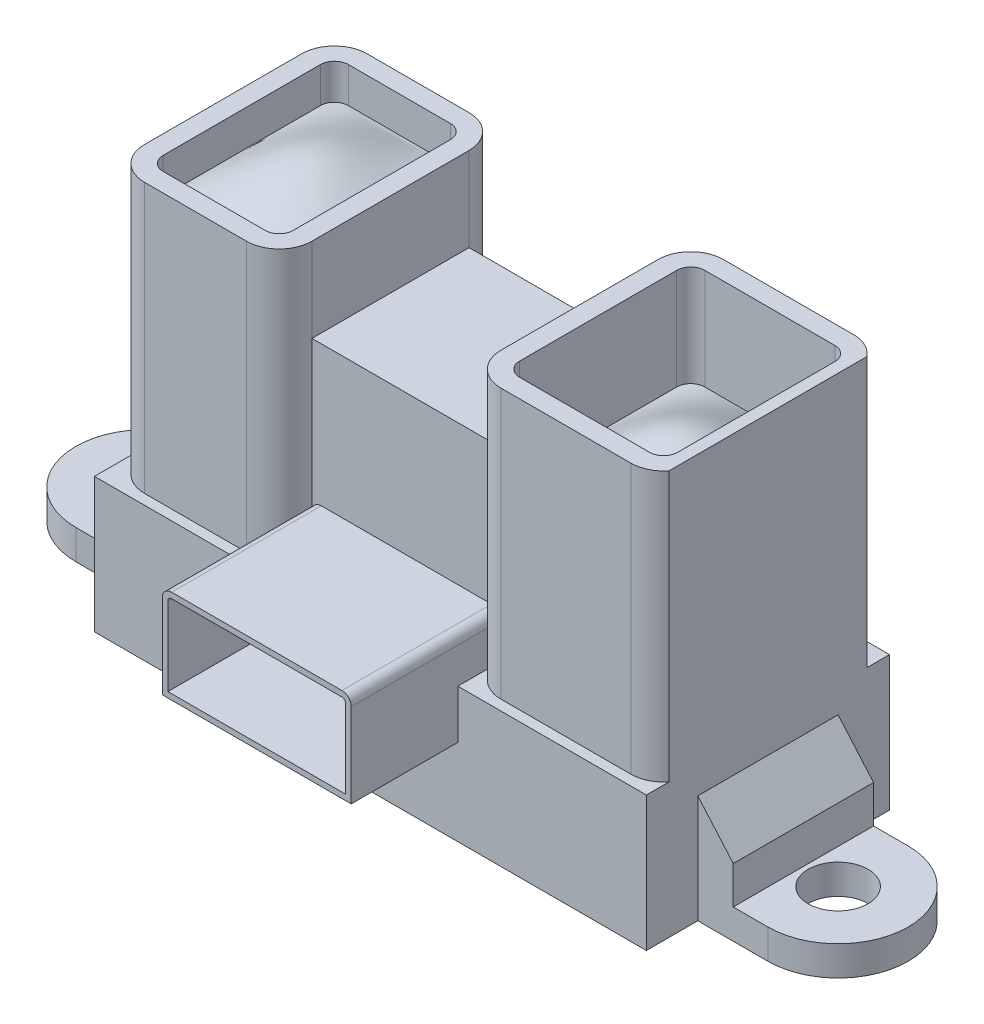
ISO-10303-21;
HEADER;
FILE_DESCRIPTION(('STEP AP214'),'2;1');
FILE_NAME('part.step','',(''),(''),'','','');
FILE_SCHEMA(('AUTOMOTIVE_DESIGN { 1 0 10303 214 1 1 1 1 }'));
ENDSEC;
DATA;
#1=APPLICATION_CONTEXT('core data for automotive mechanical design processes');
#2=APPLICATION_PROTOCOL_DEFINITION('international standard','automotive_design',2000,#1);
#3=PRODUCT_CONTEXT('',#1,'mechanical');
#4=PRODUCT('Part','Part','',(#3));
#5=PRODUCT_RELATED_PRODUCT_CATEGORY('part','',(#4));
#6=PRODUCT_DEFINITION_FORMATION('','',#4);
#7=PRODUCT_DEFINITION_CONTEXT('part definition',#1,'design');
#8=PRODUCT_DEFINITION('design','',#6,#7);
#9=PRODUCT_DEFINITION_SHAPE('','',#8);
#10=(LENGTH_UNIT() NAMED_UNIT(*) SI_UNIT(.MILLI.,.METRE.));
#11=(NAMED_UNIT(*) PLANE_ANGLE_UNIT() SI_UNIT($,.RADIAN.));
#12=(NAMED_UNIT(*) SI_UNIT($,.STERADIAN.) SOLID_ANGLE_UNIT());
#13=UNCERTAINTY_MEASURE_WITH_UNIT(LENGTH_MEASURE(1.E-05),#10,'distance_accuracy_value','');
#14=(GEOMETRIC_REPRESENTATION_CONTEXT(3) GLOBAL_UNCERTAINTY_ASSIGNED_CONTEXT((#13)) GLOBAL_UNIT_ASSIGNED_CONTEXT((#10,
#11,#12)) REPRESENTATION_CONTEXT('',''));
#15=CARTESIAN_POINT('',(0.,0.,0.));
#16=DIRECTION('',(0.,0.,1.));
#17=DIRECTION('',(1.,0.,0.));
#18=AXIS2_PLACEMENT_3D('',#15,#16,#17);
#19=CARTESIAN_POINT('',(0.,7.2,0.));
#20=DIRECTION('',(0.,1.,0.));
#21=DIRECTION('',(0.,0.,1.));
#22=AXIS2_PLACEMENT_3D('',#19,#20,#21);
#23=PLANE('',#22);
#24=CARTESIAN_POINT('',(6.425,7.2,4.2));
#25=DIRECTION('',(0.,1.,0.));
#26=DIRECTION('',(0.,0.,1.));
#27=AXIS2_PLACEMENT_3D('',#24,#25,#26);
#28=CIRCLE('',#27,1.75);
#29=CARTESIAN_POINT('',(4.675,7.2,4.19999999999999));
#30=VERTEX_POINT('',#29);
#31=CARTESIAN_POINT('',(6.425,7.2,5.95));
#32=VERTEX_POINT('',#31);
#33=EDGE_CURVE('E1029',#30,#32,#28,.T.);
#34=ORIENTED_EDGE('',*,*,#33,.F.);
#35=DIRECTION('',(0.,0.,1.));
#36=VECTOR('',#35,1.);
#37=CARTESIAN_POINT('',(4.675,7.2,0.));
#38=LINE('',#37,#36);
#39=CARTESIAN_POINT('',(4.675,7.2,6.5));
#40=VERTEX_POINT('',#39);
#41=EDGE_CURVE('E946',#30,#40,#38,.T.);
#42=ORIENTED_EDGE('',*,*,#41,.T.);
#43=DIRECTION('',(1.,0.,0.));
#44=VECTOR('',#43,1.);
#45=CARTESIAN_POINT('',(0.,7.2,6.5));
#46=LINE('',#45,#44);
#47=CARTESIAN_POINT('',(14.75,7.2,6.5));
#48=VERTEX_POINT('',#47);
#49=EDGE_CURVE('E1201',#40,#48,#46,.T.);
#50=ORIENTED_EDGE('',*,*,#49,.T.);
#51=DIRECTION('',(0.,0.,-1.));
#52=VECTOR('',#51,1.);
#53=CARTESIAN_POINT('',(14.75,7.2,0.));
#54=LINE('',#53,#52);
#55=CARTESIAN_POINT('',(14.75,7.2,5.28253175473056));
#56=VERTEX_POINT('',#55);
#57=EDGE_CURVE('E1199',#48,#56,#54,.T.);
#58=ORIENTED_EDGE('',*,*,#57,.T.);
#59=CARTESIAN_POINT('',(13.375,7.2,4.2));
#60=DIRECTION('',(0.,1.,0.));
#61=DIRECTION('',(0.,0.,1.));
#62=AXIS2_PLACEMENT_3D('',#59,#60,#61);
#63=CIRCLE('',#62,1.75);
#64=CARTESIAN_POINT('',(13.375,7.2,5.95));
#65=VERTEX_POINT('',#64);
#66=EDGE_CURVE('E1076',#65,#56,#63,.T.);
#67=ORIENTED_EDGE('',*,*,#66,.F.);
#68=DIRECTION('',(-1.,0.,0.));
#69=VECTOR('',#68,1.);
#70=CARTESIAN_POINT('',(0.,7.2,5.95));
#71=LINE('',#70,#69);
#72=EDGE_CURVE('E1074',#65,#32,#71,.T.);
#73=ORIENTED_EDGE('',*,*,#72,.T.);
#74=EDGE_LOOP('',(#34,#42,#50,#58,#67,#73));
#75=FACE_BOUND('',#74,.T.);
#76=ADVANCED_FACE('F427',(#75),#23,.T.);
#77=CARTESIAN_POINT('',(-14.75,7.2,6.5));
#78=VERTEX_POINT('',#77);
#79=CARTESIAN_POINT('',(-5.425,7.2,6.5));
#80=VERTEX_POINT('',#79);
#81=EDGE_CURVE('E1196',#78,#80,#46,.T.);
#82=ORIENTED_EDGE('',*,*,#81,.T.);
#83=DIRECTION('',(0.,0.,-1.));
#84=VECTOR('',#83,1.);
#85=CARTESIAN_POINT('',(-5.425,7.2,0.));
#86=LINE('',#85,#84);
#87=CARTESIAN_POINT('',(-5.425,7.2,4.19999999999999));
#88=VERTEX_POINT('',#87);
#89=EDGE_CURVE('E942',#80,#88,#86,.T.);
#90=ORIENTED_EDGE('',*,*,#89,.T.);
#91=CARTESIAN_POINT('',(-7.175,7.2,4.2));
#92=DIRECTION('',(0.,1.,0.));
#93=DIRECTION('',(0.,0.,1.));
#94=AXIS2_PLACEMENT_3D('',#91,#92,#93);
#95=CIRCLE('',#94,1.75);
#96=CARTESIAN_POINT('',(-7.175,7.2,5.95));
#97=VERTEX_POINT('',#96);
#98=EDGE_CURVE('E1168',#88,#97,#95,.F.);
#99=ORIENTED_EDGE('',*,*,#98,.T.);
#100=DIRECTION('',(-1.,0.,0.));
#101=VECTOR('',#100,1.);
#102=CARTESIAN_POINT('',(0.,7.2,5.95));
#103=LINE('',#102,#101);
#104=CARTESIAN_POINT('',(-12.625,7.2,5.95));
#105=VERTEX_POINT('',#104);
#106=EDGE_CURVE('E1166',#97,#105,#103,.T.);
#107=ORIENTED_EDGE('',*,*,#106,.T.);
#108=CARTESIAN_POINT('',(-12.625,7.2,4.2));
#109=DIRECTION('',(0.,1.,0.));
#110=DIRECTION('',(0.,0.,1.));
#111=AXIS2_PLACEMENT_3D('',#108,#109,#110);
#112=CIRCLE('',#111,1.75);
#113=CARTESIAN_POINT('',(-14.375,7.2,4.19999999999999));
#114=VERTEX_POINT('',#113);
#115=EDGE_CURVE('E1163',#114,#105,#112,.T.);
#116=ORIENTED_EDGE('',*,*,#115,.F.);
#117=DIRECTION('',(0.,0.,-1.));
#118=VECTOR('',#117,1.);
#119=CARTESIAN_POINT('',(-14.375,7.2,0.));
#120=LINE('',#119,#118);
#121=CARTESIAN_POINT('',(-14.375,7.2,-4.19999999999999));
#122=VERTEX_POINT('',#121);
#123=EDGE_CURVE('E1161',#114,#122,#120,.T.);
#124=ORIENTED_EDGE('',*,*,#123,.T.);
#125=CARTESIAN_POINT('',(-12.625,7.2,-4.2));
#126=DIRECTION('',(0.,1.,0.));
#127=DIRECTION('',(0.,0.,1.));
#128=AXIS2_PLACEMENT_3D('',#125,#126,#127);
#129=CIRCLE('',#128,1.75);
#130=CARTESIAN_POINT('',(-12.625,7.2,-5.95));
#131=VERTEX_POINT('',#130);
#132=EDGE_CURVE('E1157',#131,#122,#129,.T.);
#133=ORIENTED_EDGE('',*,*,#132,.F.);
#134=DIRECTION('',(-1.,0.,0.));
#135=VECTOR('',#134,1.);
#136=CARTESIAN_POINT('',(0.,7.2,-5.95));
#137=LINE('',#136,#135);
#138=CARTESIAN_POINT('',(-7.17500000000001,7.2,-5.95));
#139=VERTEX_POINT('',#138);
#140=EDGE_CURVE('E1154',#139,#131,#137,.T.);
#141=ORIENTED_EDGE('',*,*,#140,.F.);
#142=CARTESIAN_POINT('',(-7.175,7.2,-4.2));
#143=DIRECTION('',(0.,1.,0.));
#144=DIRECTION('',(0.,0.,1.));
#145=AXIS2_PLACEMENT_3D('',#142,#143,#144);
#146=CIRCLE('',#145,1.75);
#147=CARTESIAN_POINT('',(-5.425,7.2,-4.19999999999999));
#148=VERTEX_POINT('',#147);
#149=EDGE_CURVE('E1114',#139,#148,#146,.F.);
#150=ORIENTED_EDGE('',*,*,#149,.T.);
#151=DIRECTION('',(1.,0.,0.));
#152=VECTOR('',#151,1.);
#153=CARTESIAN_POINT('',(0.,7.2,-4.19999999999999));
#154=LINE('',#153,#152);
#155=CARTESIAN_POINT('',(4.675,7.2,-4.19999999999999));
#156=VERTEX_POINT('',#155);
#157=EDGE_CURVE('E1002',#148,#156,#154,.T.);
#158=ORIENTED_EDGE('',*,*,#157,.T.);
#159=CARTESIAN_POINT('',(6.425,7.2,-4.2));
#160=DIRECTION('',(0.,1.,0.));
#161=DIRECTION('',(0.,0.,1.));
#162=AXIS2_PLACEMENT_3D('',#159,#160,#161);
#163=CIRCLE('',#162,1.75);
#164=CARTESIAN_POINT('',(6.42500000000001,7.2,-5.95));
#165=VERTEX_POINT('',#164);
#166=EDGE_CURVE('E1034',#165,#156,#163,.T.);
#167=ORIENTED_EDGE('',*,*,#166,.F.);
#168=DIRECTION('',(-1.,0.,0.));
#169=VECTOR('',#168,1.);
#170=CARTESIAN_POINT('',(0.,7.2,-5.95));
#171=LINE('',#170,#169);
#172=CARTESIAN_POINT('',(13.375,7.2,-5.95));
#173=VERTEX_POINT('',#172);
#174=EDGE_CURVE('E1082',#173,#165,#171,.T.);
#175=ORIENTED_EDGE('',*,*,#174,.F.);
#176=CARTESIAN_POINT('',(13.375,7.2,-4.2));
#177=DIRECTION('',(0.,1.,0.));
#178=DIRECTION('',(0.,0.,1.));
#179=AXIS2_PLACEMENT_3D('',#176,#177,#178);
#180=CIRCLE('',#179,1.75);
#181=CARTESIAN_POINT('',(14.75,7.2,-5.28253175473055));
#182=VERTEX_POINT('',#181);
#183=EDGE_CURVE('E1079',#173,#182,#180,.F.);
#184=ORIENTED_EDGE('',*,*,#183,.T.);
#185=CARTESIAN_POINT('',(14.75,7.2,-6.5));
#186=VERTEX_POINT('',#185);
#187=EDGE_CURVE('E1203',#182,#186,#54,.T.);
#188=ORIENTED_EDGE('',*,*,#187,.T.);
#189=DIRECTION('',(1.,0.,0.));
#190=VECTOR('',#189,1.);
#191=CARTESIAN_POINT('',(0.,7.2,-6.5));
#192=LINE('',#191,#190);
#193=CARTESIAN_POINT('',(-14.75,7.2,-6.5));
#194=VERTEX_POINT('',#193);
#195=EDGE_CURVE('E1204',#194,#186,#192,.T.);
#196=ORIENTED_EDGE('',*,*,#195,.F.);
#197=DIRECTION('',(0.,0.,-1.));
#198=VECTOR('',#197,1.);
#199=CARTESIAN_POINT('',(-14.75,7.2,0.));
#200=LINE('',#199,#198);
#201=EDGE_CURVE('E1207',#78,#194,#200,.T.);
#202=ORIENTED_EDGE('',*,*,#201,.F.);
#203=EDGE_LOOP('',(#82,#90,#99,#107,#116,#124,#133,#141,#150,#158,#167,#175,#184,#188,#196,#202));
#204=FACE_BOUND('',#203,.T.);
#205=ADVANCED_FACE('F1480',(#204),#23,.T.);
#206=CARTESIAN_POINT('',(0.,7.2,6.5));
#207=DIRECTION('',(0.,0.,-1.));
#208=DIRECTION('',(-1.,0.,0.));
#209=AXIS2_PLACEMENT_3D('',#206,#207,#208);
#210=PLANE('',#209);
#211=DIRECTION('',(0.,1.,0.));
#212=VECTOR('',#211,1.);
#213=CARTESIAN_POINT('',(4.675,7.2,6.5));
#214=LINE('',#213,#212);
#215=CARTESIAN_POINT('',(4.675,4.6,6.5));
#216=VERTEX_POINT('',#215);
#217=EDGE_CURVE('E445',#216,#40,#214,.T.);
#218=ORIENTED_EDGE('',*,*,#217,.F.);
#219=DIRECTION('',(1.,0.,0.));
#220=VECTOR('',#219,1.);
#221=CARTESIAN_POINT('',(0.,4.6,6.5));
#222=LINE('',#221,#220);
#223=CARTESIAN_POINT('',(-5.425,4.6,6.5));
#224=VERTEX_POINT('',#223);
#225=EDGE_CURVE('E13',#224,#216,#222,.T.);
#226=ORIENTED_EDGE('',*,*,#225,.F.);
#227=DIRECTION('',(0.,-1.,0.));
#228=VECTOR('',#227,1.);
#229=CARTESIAN_POINT('',(-5.425,7.2,6.5));
#230=LINE('',#229,#228);
#231=EDGE_CURVE('E940',#80,#224,#230,.T.);
#232=ORIENTED_EDGE('',*,*,#231,.F.);
#233=ORIENTED_EDGE('',*,*,#81,.F.);
#234=DIRECTION('',(0.,-1.,0.));
#235=VECTOR('',#234,1.);
#236=CARTESIAN_POINT('',(-14.75,7.2,6.5));
#237=LINE('',#236,#235);
#238=CARTESIAN_POINT('',(-14.75,0.,6.5));
#239=VERTEX_POINT('',#238);
#240=EDGE_CURVE('E1210',#78,#239,#237,.T.);
#241=ORIENTED_EDGE('',*,*,#240,.T.);
#242=DIRECTION('',(1.,0.,0.));
#243=VECTOR('',#242,1.);
#244=CARTESIAN_POINT('',(0.,0.,6.5));
#245=LINE('',#244,#243);
#246=CARTESIAN_POINT('',(14.75,0.,6.5));
#247=VERTEX_POINT('',#246);
#248=EDGE_CURVE('E1211',#239,#247,#245,.T.);
#249=ORIENTED_EDGE('',*,*,#248,.T.);
#250=DIRECTION('',(0.,-1.,0.));
#251=VECTOR('',#250,1.);
#252=CARTESIAN_POINT('',(14.75,7.2,6.5));
#253=LINE('',#252,#251);
#254=EDGE_CURVE('E1271',#48,#247,#253,.T.);
#255=ORIENTED_EDGE('',*,*,#254,.F.);
#256=ORIENTED_EDGE('',*,*,#49,.F.);
#257=EDGE_LOOP('',(#218,#226,#232,#233,#241,#249,#255,#256));
#258=FACE_BOUND('',#257,.T.);
#259=ADVANCED_FACE('F1487',(#258),#210,.F.);
#260=CARTESIAN_POINT('',(0.,17.1,4.19999999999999));
#261=DIRECTION('',(0.,0.,-1.));
#262=DIRECTION('',(-1.,0.,0.));
#263=AXIS2_PLACEMENT_3D('',#260,#261,#262);
#264=PLANE('',#263);
#265=CARTESIAN_POINT('',(4.175,9.1,4.19999999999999));
#266=DIRECTION('',(0.,0.,1.));
#267=DIRECTION('',(-1.,0.,0.));
#268=AXIS2_PLACEMENT_3D('',#265,#266,#267);
#269=CIRCLE('',#268,0.5);
#270=CARTESIAN_POINT('',(4.675,9.1,4.19999999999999));
#271=VERTEX_POINT('',#270);
#272=CARTESIAN_POINT('',(4.175,9.6,4.19999999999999));
#273=VERTEX_POINT('',#272);
#274=EDGE_CURVE('E854',#271,#273,#269,.T.);
#275=ORIENTED_EDGE('',*,*,#274,.F.);
#276=DIRECTION('',(0.,-1.,0.));
#277=VECTOR('',#276,1.);
#278=CARTESIAN_POINT('',(4.675,17.1,4.19999999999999));
#279=LINE('',#278,#277);
#280=CARTESIAN_POINT('',(4.675,17.1,4.19999999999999));
#281=VERTEX_POINT('',#280);
#282=EDGE_CURVE('E1023',#281,#271,#279,.T.);
#283=ORIENTED_EDGE('',*,*,#282,.F.);
#284=DIRECTION('',(1.,0.,0.));
#285=VECTOR('',#284,1.);
#286=CARTESIAN_POINT('',(0.,17.1,4.19999999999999));
#287=LINE('',#286,#285);
#288=CARTESIAN_POINT('',(-5.425,17.1,4.19999999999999));
#289=VERTEX_POINT('',#288);
#290=EDGE_CURVE('E1001',#289,#281,#287,.T.);
#291=ORIENTED_EDGE('',*,*,#290,.F.);
#292=DIRECTION('',(0.,-1.,0.));
#293=VECTOR('',#292,1.);
#294=CARTESIAN_POINT('',(-5.425,17.1,4.19999999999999));
#295=LINE('',#294,#293);
#296=CARTESIAN_POINT('',(-5.425,9.1,4.19999999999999));
#297=VERTEX_POINT('',#296);
#298=EDGE_CURVE('E1026',#289,#297,#295,.T.);
#299=ORIENTED_EDGE('',*,*,#298,.T.);
#300=CARTESIAN_POINT('',(-4.925,9.1,4.19999999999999));
#301=DIRECTION('',(0.,0.,1.));
#302=DIRECTION('',(1.,0.,0.));
#303=AXIS2_PLACEMENT_3D('',#300,#301,#302);
#304=CIRCLE('',#303,0.5);
#305=CARTESIAN_POINT('',(-4.925,9.6,4.19999999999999));
#306=VERTEX_POINT('',#305);
#307=EDGE_CURVE('E908',#306,#297,#304,.T.);
#308=ORIENTED_EDGE('',*,*,#307,.F.);
#309=DIRECTION('',(-1.,0.,0.));
#310=VECTOR('',#309,1.);
#311=CARTESIAN_POINT('',(-4.925,9.6,4.19999999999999));
#312=LINE('',#311,#310);
#313=EDGE_CURVE('E905',#273,#306,#312,.T.);
#314=ORIENTED_EDGE('',*,*,#313,.F.);
#315=EDGE_LOOP('',(#275,#283,#291,#299,#308,#314));
#316=FACE_BOUND('',#315,.T.);
#317=ADVANCED_FACE('F1599',(#316),#264,.F.);
#318=CARTESIAN_POINT('',(0.,7.2,-3.74999999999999));
#319=DIRECTION('',(0.,0.,-1.));
#320=DIRECTION('',(-1.,0.,0.));
#321=AXIS2_PLACEMENT_3D('',#318,#319,#320);
#322=PLANE('',#321);
#323=DIRECTION('',(0.,1.,0.));
#324=VECTOR('',#323,1.);
#325=CARTESIAN_POINT('',(-16.6448150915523,7.2,-3.75));
#326=LINE('',#325,#324);
#327=CARTESIAN_POINT('',(-16.6448150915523,1.5884463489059,-3.75));
#328=VERTEX_POINT('',#327);
#329=CARTESIAN_POINT('',(-16.6448150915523,3.6,-3.75));
#330=VERTEX_POINT('',#329);
#331=EDGE_CURVE('E971',#328,#330,#326,.T.);
#332=ORIENTED_EDGE('',*,*,#331,.T.);
#333=DIRECTION('',(0.655120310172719,0.755524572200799,0.));
#334=VECTOR('',#333,1.);
#335=CARTESIAN_POINT('',(-7.71929555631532,13.8934517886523,-3.75));
#336=LINE('',#335,#334);
#337=CARTESIAN_POINT('',(-14.75,5.7852159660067,-3.75));
#338=VERTEX_POINT('',#337);
#339=EDGE_CURVE('E959',#330,#338,#336,.T.);
#340=ORIENTED_EDGE('',*,*,#339,.T.);
#341=DIRECTION('',(0.,-1.,0.));
#342=VECTOR('',#341,1.);
#343=CARTESIAN_POINT('',(-14.75,7.2,-3.75));
#344=LINE('',#343,#342);
#345=CARTESIAN_POINT('',(-14.75,0.,-3.75));
#346=VERTEX_POINT('',#345);
#347=EDGE_CURVE('E1257',#338,#346,#344,.T.);
#348=ORIENTED_EDGE('',*,*,#347,.T.);
#349=DIRECTION('',(1.,0.,0.));
#350=VECTOR('',#349,1.);
#351=CARTESIAN_POINT('',(0.,0.,-3.74999999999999));
#352=LINE('',#351,#350);
#353=CARTESIAN_POINT('',(-18.5,0.,-3.75));
#354=VERTEX_POINT('',#353);
#355=EDGE_CURVE('E1234',#354,#346,#352,.T.);
#356=ORIENTED_EDGE('',*,*,#355,.F.);
#357=DIRECTION('',(0.,-1.,0.));
#358=VECTOR('',#357,1.);
#359=CARTESIAN_POINT('',(-18.5,7.2,-3.75));
#360=LINE('',#359,#358);
#361=CARTESIAN_POINT('',(-18.5,1.5884463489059,-3.75));
#362=VERTEX_POINT('',#361);
#363=EDGE_CURVE('E1255',#362,#354,#360,.T.);
#364=ORIENTED_EDGE('',*,*,#363,.F.);
#365=DIRECTION('',(1.,0.,0.));
#366=VECTOR('',#365,1.);
#367=CARTESIAN_POINT('',(0.,1.5884463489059,-3.74999999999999));
#368=LINE('',#367,#366);
#369=EDGE_CURVE('E968',#362,#328,#368,.T.);
#370=ORIENTED_EDGE('',*,*,#369,.T.);
#371=EDGE_LOOP('',(#332,#340,#348,#356,#364,#370));
#372=FACE_BOUND('',#371,.T.);
#373=ADVANCED_FACE('F1537',(#372),#322,.T.);
#374=CARTESIAN_POINT('',(-18.5,7.2,0.));
#375=DIRECTION('',(0.,-1.,0.));
#376=DIRECTION('',(0.,0.,-1.));
#377=AXIS2_PLACEMENT_3D('',#374,#375,#376);
#378=CYLINDRICAL_SURFACE('',#377,3.75);
#379=DIRECTION('',(0.,-1.,0.));
#380=VECTOR('',#379,1.);
#381=CARTESIAN_POINT('',(-18.5,7.2,3.75));
#382=LINE('',#381,#380);
#383=CARTESIAN_POINT('',(-18.5,1.5884463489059,3.75));
#384=VERTEX_POINT('',#383);
#385=CARTESIAN_POINT('',(-18.5,0.,3.75));
#386=VERTEX_POINT('',#385);
#387=EDGE_CURVE('E1253',#384,#386,#382,.T.);
#388=ORIENTED_EDGE('',*,*,#387,.F.);
#389=CARTESIAN_POINT('',(-18.5,1.5884463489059,0.));
#390=DIRECTION('',(0.,1.,0.));
#391=DIRECTION('',(0.,0.,1.));
#392=AXIS2_PLACEMENT_3D('',#389,#390,#391);
#393=CIRCLE('',#392,3.75);
#394=EDGE_CURVE('E965',#384,#362,#393,.F.);
#395=ORIENTED_EDGE('',*,*,#394,.T.);
#396=ORIENTED_EDGE('',*,*,#363,.T.);
#397=CARTESIAN_POINT('',(-18.5,0.,0.));
#398=DIRECTION('',(0.,1.,0.));
#399=DIRECTION('',(0.,0.,1.));
#400=AXIS2_PLACEMENT_3D('',#397,#398,#399);
#401=CIRCLE('',#400,3.75);
#402=EDGE_CURVE('E1238',#386,#354,#401,.F.);
#403=ORIENTED_EDGE('',*,*,#402,.F.);
#404=EDGE_LOOP('',(#388,#395,#396,#403));
#405=FACE_BOUND('',#404,.T.);
#406=ADVANCED_FACE('F1533',(#405),#378,.T.);
#407=CARTESIAN_POINT('',(0.,7.2,3.75));
#408=DIRECTION('',(0.,0.,-1.));
#409=DIRECTION('',(-1.,0.,0.));
#410=AXIS2_PLACEMENT_3D('',#407,#408,#409);
#411=PLANE('',#410);
#412=DIRECTION('',(0.655120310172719,0.755524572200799,0.));
#413=VECTOR('',#412,1.);
#414=CARTESIAN_POINT('',(-7.71929555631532,13.8934517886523,3.75));
#415=LINE('',#414,#413);
#416=CARTESIAN_POINT('',(-16.6448150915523,3.6,3.74999999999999));
#417=VERTEX_POINT('',#416);
#418=CARTESIAN_POINT('',(-14.75,5.7852159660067,3.74999999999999));
#419=VERTEX_POINT('',#418);
#420=EDGE_CURVE('E952',#417,#419,#415,.T.);
#421=ORIENTED_EDGE('',*,*,#420,.F.);
#422=DIRECTION('',(0.,1.,0.));
#423=VECTOR('',#422,1.);
#424=CARTESIAN_POINT('',(-16.6448150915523,7.2,3.75));
#425=LINE('',#424,#423);
#426=CARTESIAN_POINT('',(-16.6448150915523,1.5884463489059,3.74999999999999));
#427=VERTEX_POINT('',#426);
#428=EDGE_CURVE('E1568',#427,#417,#425,.T.);
#429=ORIENTED_EDGE('',*,*,#428,.F.);
#430=DIRECTION('',(1.,0.,0.));
#431=VECTOR('',#430,1.);
#432=CARTESIAN_POINT('',(0.,1.5884463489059,3.75));
#433=LINE('',#432,#431);
#434=EDGE_CURVE('E963',#384,#427,#433,.T.);
#435=ORIENTED_EDGE('',*,*,#434,.F.);
#436=ORIENTED_EDGE('',*,*,#387,.T.);
#437=DIRECTION('',(1.,0.,0.));
#438=VECTOR('',#437,1.);
#439=CARTESIAN_POINT('',(0.,0.,3.75));
#440=LINE('',#439,#438);
#441=CARTESIAN_POINT('',(-14.75,0.,3.74999999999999));
#442=VERTEX_POINT('',#441);
#443=EDGE_CURVE('E1241',#386,#442,#440,.T.);
#444=ORIENTED_EDGE('',*,*,#443,.T.);
#445=DIRECTION('',(0.,-1.,0.));
#446=VECTOR('',#445,1.);
#447=CARTESIAN_POINT('',(-14.75,7.2,3.74999999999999));
#448=LINE('',#447,#446);
#449=EDGE_CURVE('E1251',#419,#442,#448,.T.);
#450=ORIENTED_EDGE('',*,*,#449,.F.);
#451=EDGE_LOOP('',(#421,#429,#435,#436,#444,#450));
#452=FACE_BOUND('',#451,.T.);
#453=ADVANCED_FACE('F1528',(#452),#411,.F.);
#454=CARTESIAN_POINT('',(-18.5,7.2,0.));
#455=DIRECTION('',(0.,-1.,0.));
#456=DIRECTION('',(0.,0.,-1.));
#457=AXIS2_PLACEMENT_3D('',#454,#455,#456);
#458=CYLINDRICAL_SURFACE('',#457,1.59999999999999);
#459=CARTESIAN_POINT('',(-18.5,0.,0.));
#460=DIRECTION('',(0.,1.,0.));
#461=DIRECTION('',(0.,0.,1.));
#462=AXIS2_PLACEMENT_3D('',#459,#460,#461);
#463=CIRCLE('',#462,1.59999999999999);
#464=CARTESIAN_POINT('',(-18.5,0.,1.59999999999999));
#465=VERTEX_POINT('',#464);
#466=EDGE_CURVE('E1244',#465,#465,#463,.F.);
#467=ORIENTED_EDGE('',*,*,#466,.T.);
#468=EDGE_LOOP('',(#467));
#469=FACE_BOUND('',#468,.T.);
#470=CARTESIAN_POINT('',(-18.5,1.5884463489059,0.));
#471=DIRECTION('',(0.,1.,0.));
#472=DIRECTION('',(0.,0.,1.));
#473=AXIS2_PLACEMENT_3D('',#470,#471,#472);
#474=CIRCLE('',#473,1.59999999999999);
#475=CARTESIAN_POINT('',(-18.5,1.5884463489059,1.59999999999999));
#476=VERTEX_POINT('',#475);
#477=EDGE_CURVE('E962',#476,#476,#474,.F.);
#478=ORIENTED_EDGE('',*,*,#477,.F.);
#479=EDGE_LOOP('',(#478));
#480=FACE_BOUND('',#479,.T.);
#481=ADVANCED_FACE('F2339',(#469,#480),#458,.F.);
#482=CARTESIAN_POINT('',(0.,7.2,3.75));
#483=DIRECTION('',(0.,0.,1.));
#484=DIRECTION('',(1.,0.,0.));
#485=AXIS2_PLACEMENT_3D('',#482,#483,#484);
#486=PLANE('',#485);
#487=DIRECTION('',(0.65512031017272,-0.755524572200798,0.));
#488=VECTOR('',#487,1.);
#489=CARTESIAN_POINT('',(7.71929555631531,13.8934517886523,3.75));
#490=LINE('',#489,#488);
#491=CARTESIAN_POINT('',(14.75,5.7852159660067,3.75));
#492=VERTEX_POINT('',#491);
#493=CARTESIAN_POINT('',(16.6448150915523,3.6,3.75));
#494=VERTEX_POINT('',#493);
#495=EDGE_CURVE('E994',#492,#494,#490,.T.);
#496=ORIENTED_EDGE('',*,*,#495,.F.);
#497=DIRECTION('',(0.,-1.,0.));
#498=VECTOR('',#497,1.);
#499=CARTESIAN_POINT('',(14.75,7.2,3.75));
#500=LINE('',#499,#498);
#501=CARTESIAN_POINT('',(14.75,0.,3.75));
#502=VERTEX_POINT('',#501);
#503=EDGE_CURVE('E1269',#492,#502,#500,.T.);
#504=ORIENTED_EDGE('',*,*,#503,.T.);
#505=DIRECTION('',(-1.,0.,0.));
#506=VECTOR('',#505,1.);
#507=CARTESIAN_POINT('',(0.,0.,3.75));
#508=LINE('',#507,#506);
#509=CARTESIAN_POINT('',(18.5,0.,3.75));
#510=VERTEX_POINT('',#509);
#511=EDGE_CURVE('E1218',#510,#502,#508,.T.);
#512=ORIENTED_EDGE('',*,*,#511,.F.);
#513=DIRECTION('',(0.,-1.,0.));
#514=VECTOR('',#513,1.);
#515=CARTESIAN_POINT('',(18.5,7.2,3.75));
#516=LINE('',#515,#514);
#517=CARTESIAN_POINT('',(18.5,1.5884463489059,3.75));
#518=VERTEX_POINT('',#517);
#519=EDGE_CURVE('E1267',#518,#510,#516,.T.);
#520=ORIENTED_EDGE('',*,*,#519,.F.);
#521=DIRECTION('',(1.,0.,0.));
#522=VECTOR('',#521,1.);
#523=CARTESIAN_POINT('',(0.,1.5884463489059,3.75));
#524=LINE('',#523,#522);
#525=CARTESIAN_POINT('',(16.6448150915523,1.5884463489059,3.75));
#526=VERTEX_POINT('',#525);
#527=EDGE_CURVE('E988',#526,#518,#524,.T.);
#528=ORIENTED_EDGE('',*,*,#527,.F.);
#529=DIRECTION('',(0.,-1.,0.));
#530=VECTOR('',#529,1.);
#531=CARTESIAN_POINT('',(16.6448150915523,7.2,3.75));
#532=LINE('',#531,#530);
#533=EDGE_CURVE('E996',#494,#526,#532,.T.);
#534=ORIENTED_EDGE('',*,*,#533,.F.);
#535=EDGE_LOOP('',(#496,#504,#512,#520,#528,#534));
#536=FACE_BOUND('',#535,.T.);
#537=ADVANCED_FACE('F1561',(#536),#486,.T.);
#538=CARTESIAN_POINT('',(18.5,7.2,0.));
#539=DIRECTION('',(0.,-1.,0.));
#540=DIRECTION('',(0.,0.,-1.));
#541=AXIS2_PLACEMENT_3D('',#538,#539,#540);
#542=CYLINDRICAL_SURFACE('',#541,3.75);
#543=CARTESIAN_POINT('',(18.5,1.5884463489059,0.));
#544=DIRECTION('',(0.,-1.,0.));
#545=DIRECTION('',(0.,0.,-1.));
#546=AXIS2_PLACEMENT_3D('',#543,#544,#545);
#547=CIRCLE('',#546,3.75);
#548=CARTESIAN_POINT('',(18.5,1.5884463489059,-3.75));
#549=VERTEX_POINT('',#548);
#550=EDGE_CURVE('E986',#549,#518,#547,.T.);
#551=ORIENTED_EDGE('',*,*,#550,.T.);
#552=ORIENTED_EDGE('',*,*,#519,.T.);
#553=CARTESIAN_POINT('',(18.5,0.,0.));
#554=DIRECTION('',(0.,1.,0.));
#555=DIRECTION('',(0.,0.,1.));
#556=AXIS2_PLACEMENT_3D('',#553,#554,#555);
#557=CIRCLE('',#556,3.75);
#558=CARTESIAN_POINT('',(18.5,0.,-3.75));
#559=VERTEX_POINT('',#558);
#560=EDGE_CURVE('E1222',#510,#559,#557,.T.);
#561=ORIENTED_EDGE('',*,*,#560,.T.);
#562=DIRECTION('',(0.,-1.,0.));
#563=VECTOR('',#562,1.);
#564=CARTESIAN_POINT('',(18.5,7.2,-3.75));
#565=LINE('',#564,#563);
#566=EDGE_CURVE('E1265',#549,#559,#565,.T.);
#567=ORIENTED_EDGE('',*,*,#566,.F.);
#568=EDGE_LOOP('',(#551,#552,#561,#567));
#569=FACE_BOUND('',#568,.T.);
#570=ADVANCED_FACE('F1556',(#569),#542,.T.);
#571=CARTESIAN_POINT('',(0.,7.2,-3.74999999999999));
#572=DIRECTION('',(0.,0.,1.));
#573=DIRECTION('',(1.,0.,0.));
#574=AXIS2_PLACEMENT_3D('',#571,#572,#573);
#575=PLANE('',#574);
#576=DIRECTION('',(0.,-1.,0.));
#577=VECTOR('',#576,1.);
#578=CARTESIAN_POINT('',(14.75,7.2,-3.75));
#579=LINE('',#578,#577);
#580=CARTESIAN_POINT('',(14.75,5.7852159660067,-3.75));
#581=VERTEX_POINT('',#580);
#582=CARTESIAN_POINT('',(14.75,0.,-3.75));
#583=VERTEX_POINT('',#582);
#584=EDGE_CURVE('E1263',#581,#583,#579,.T.);
#585=ORIENTED_EDGE('',*,*,#584,.F.);
#586=DIRECTION('',(0.65512031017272,-0.755524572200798,0.));
#587=VECTOR('',#586,1.);
#588=CARTESIAN_POINT('',(7.71929555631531,13.8934517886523,-3.74999999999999));
#589=LINE('',#588,#587);
#590=CARTESIAN_POINT('',(16.6448150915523,3.6,-3.75));
#591=VERTEX_POINT('',#590);
#592=EDGE_CURVE('E991',#581,#591,#589,.T.);
#593=ORIENTED_EDGE('',*,*,#592,.T.);
#594=DIRECTION('',(0.,-1.,0.));
#595=VECTOR('',#594,1.);
#596=CARTESIAN_POINT('',(16.6448150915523,7.2,-3.75));
#597=LINE('',#596,#595);
#598=CARTESIAN_POINT('',(16.6448150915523,1.5884463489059,-3.75));
#599=VERTEX_POINT('',#598);
#600=EDGE_CURVE('E1273',#591,#599,#597,.T.);
#601=ORIENTED_EDGE('',*,*,#600,.T.);
#602=DIRECTION('',(1.,0.,0.));
#603=VECTOR('',#602,1.);
#604=CARTESIAN_POINT('',(0.,1.5884463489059,-3.74999999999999));
#605=LINE('',#604,#603);
#606=EDGE_CURVE('E983',#599,#549,#605,.T.);
#607=ORIENTED_EDGE('',*,*,#606,.T.);
#608=ORIENTED_EDGE('',*,*,#566,.T.);
#609=DIRECTION('',(-1.,0.,0.));
#610=VECTOR('',#609,1.);
#611=CARTESIAN_POINT('',(0.,0.,-3.74999999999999));
#612=LINE('',#611,#610);
#613=EDGE_CURVE('E1225',#559,#583,#612,.T.);
#614=ORIENTED_EDGE('',*,*,#613,.T.);
#615=EDGE_LOOP('',(#585,#593,#601,#607,#608,#614));
#616=FACE_BOUND('',#615,.T.);
#617=ADVANCED_FACE('F1552',(#616),#575,.F.);
#618=CARTESIAN_POINT('',(14.75,7.2,0.));
#619=DIRECTION('',(-1.,0.,0.));
#620=DIRECTION('',(0.,0.,1.));
#621=AXIS2_PLACEMENT_3D('',#618,#619,#620);
#622=PLANE('',#621);
#623=ORIENTED_EDGE('',*,*,#503,.F.);
#624=DIRECTION('',(0.,0.,1.));
#625=VECTOR('',#624,1.);
#626=CARTESIAN_POINT('',(14.75,5.7852159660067,-8.5));
#627=LINE('',#626,#625);
#628=EDGE_CURVE('E979',#581,#492,#627,.T.);
#629=ORIENTED_EDGE('',*,*,#628,.F.);
#630=ORIENTED_EDGE('',*,*,#584,.T.);
#631=DIRECTION('',(0.,0.,-1.));
#632=VECTOR('',#631,1.);
#633=CARTESIAN_POINT('',(14.75,0.,0.));
#634=LINE('',#633,#632);
#635=CARTESIAN_POINT('',(14.75,0.,-6.5));
#636=VERTEX_POINT('',#635);
#637=EDGE_CURVE('E1219',#583,#636,#634,.T.);
#638=ORIENTED_EDGE('',*,*,#637,.T.);
#639=DIRECTION('',(0.,-1.,0.));
#640=VECTOR('',#639,1.);
#641=CARTESIAN_POINT('',(14.75,7.2,-6.5));
#642=LINE('',#641,#640);
#643=EDGE_CURVE('E1261',#186,#636,#642,.T.);
#644=ORIENTED_EDGE('',*,*,#643,.F.);
#645=ORIENTED_EDGE('',*,*,#187,.F.);
#646=DIRECTION('',(0.,-1.,0.));
#647=VECTOR('',#646,1.);
#648=CARTESIAN_POINT('',(14.75,21.6,-5.28253175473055));
#649=LINE('',#648,#647);
#650=CARTESIAN_POINT('',(14.75,21.6,-5.28253175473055));
#651=VERTEX_POINT('',#650);
#652=EDGE_CURVE('E1094',#651,#182,#649,.T.);
#653=ORIENTED_EDGE('',*,*,#652,.F.);
#654=DIRECTION('',(0.,0.,-1.));
#655=VECTOR('',#654,1.);
#656=CARTESIAN_POINT('',(14.75,21.6,0.));
#657=LINE('',#656,#655);
#658=CARTESIAN_POINT('',(14.75,21.6,5.28253175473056));
#659=VERTEX_POINT('',#658);
#660=EDGE_CURVE('E1041',#659,#651,#657,.T.);
#661=ORIENTED_EDGE('',*,*,#660,.F.);
#662=DIRECTION('',(0.,-1.,0.));
#663=VECTOR('',#662,1.);
#664=CARTESIAN_POINT('',(14.75,21.6,5.28253175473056));
#665=LINE('',#664,#663);
#666=EDGE_CURVE('E1097',#659,#56,#665,.T.);
#667=ORIENTED_EDGE('',*,*,#666,.T.);
#668=ORIENTED_EDGE('',*,*,#57,.F.);
#669=ORIENTED_EDGE('',*,*,#254,.T.);
#670=EDGE_CURVE('E1214',#247,#502,#634,.T.);
#671=ORIENTED_EDGE('',*,*,#670,.T.);
#672=EDGE_LOOP('',(#623,#629,#630,#638,#644,#645,#653,#661,#667,#668,#669,#671));
#673=FACE_BOUND('',#672,.T.);
#674=ADVANCED_FACE('F1509',(#673),#622,.F.);
#675=CARTESIAN_POINT('',(0.,7.2,-6.5));
#676=DIRECTION('',(0.,0.,-1.));
#677=DIRECTION('',(-1.,0.,0.));
#678=AXIS2_PLACEMENT_3D('',#675,#676,#677);
#679=PLANE('',#678);
#680=DIRECTION('',(1.,0.,0.));
#681=VECTOR('',#680,1.);
#682=CARTESIAN_POINT('',(0.,0.,-6.5));
#683=LINE('',#682,#681);
#684=CARTESIAN_POINT('',(-14.75,0.,-6.5));
#685=VERTEX_POINT('',#684);
#686=EDGE_CURVE('E1228',#685,#636,#683,.T.);
#687=ORIENTED_EDGE('',*,*,#686,.F.);
#688=DIRECTION('',(0.,-1.,0.));
#689=VECTOR('',#688,1.);
#690=CARTESIAN_POINT('',(-14.75,7.2,-6.5));
#691=LINE('',#690,#689);
#692=EDGE_CURVE('E1259',#194,#685,#691,.T.);
#693=ORIENTED_EDGE('',*,*,#692,.F.);
#694=ORIENTED_EDGE('',*,*,#195,.T.);
#695=ORIENTED_EDGE('',*,*,#643,.T.);
#696=EDGE_LOOP('',(#687,#693,#694,#695));
#697=FACE_BOUND('',#696,.T.);
#698=ADVANCED_FACE('F1543',(#697),#679,.T.);
#699=CARTESIAN_POINT('',(-14.75,7.2,0.));
#700=DIRECTION('',(-1.,0.,0.));
#701=DIRECTION('',(0.,0.,1.));
#702=AXIS2_PLACEMENT_3D('',#699,#700,#701);
#703=PLANE('',#702);
#704=ORIENTED_EDGE('',*,*,#240,.F.);
#705=ORIENTED_EDGE('',*,*,#201,.T.);
#706=ORIENTED_EDGE('',*,*,#692,.T.);
#707=DIRECTION('',(0.,0.,-1.));
#708=VECTOR('',#707,1.);
#709=CARTESIAN_POINT('',(-14.75,0.,0.));
#710=LINE('',#709,#708);
#711=EDGE_CURVE('E1231',#346,#685,#710,.T.);
#712=ORIENTED_EDGE('',*,*,#711,.F.);
#713=ORIENTED_EDGE('',*,*,#347,.F.);
#714=DIRECTION('',(0.,0.,1.));
#715=VECTOR('',#714,1.);
#716=CARTESIAN_POINT('',(-14.75,5.7852159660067,-8.5));
#717=LINE('',#716,#715);
#718=EDGE_CURVE('E949',#338,#419,#717,.T.);
#719=ORIENTED_EDGE('',*,*,#718,.T.);
#720=ORIENTED_EDGE('',*,*,#449,.T.);
#721=EDGE_CURVE('E1235',#239,#442,#710,.T.);
#722=ORIENTED_EDGE('',*,*,#721,.F.);
#723=EDGE_LOOP('',(#704,#705,#706,#712,#713,#719,#720,#722));
#724=FACE_BOUND('',#723,.T.);
#725=ADVANCED_FACE('F1523',(#724),#703,.T.);
#726=CARTESIAN_POINT('',(18.5,7.2,0.));
#727=DIRECTION('',(0.,-1.,0.));
#728=DIRECTION('',(0.,0.,-1.));
#729=AXIS2_PLACEMENT_3D('',#726,#727,#728);
#730=CYLINDRICAL_SURFACE('',#729,1.6);
#731=CARTESIAN_POINT('',(18.5,1.5884463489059,0.));
#732=DIRECTION('',(0.,-1.,0.));
#733=DIRECTION('',(0.,0.,-1.));
#734=AXIS2_PLACEMENT_3D('',#731,#732,#733);
#735=CIRCLE('',#734,1.6);
#736=CARTESIAN_POINT('',(18.5,1.5884463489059,-1.6));
#737=VERTEX_POINT('',#736);
#738=EDGE_CURVE('E978',#737,#737,#735,.T.);
#739=ORIENTED_EDGE('',*,*,#738,.F.);
#740=EDGE_LOOP('',(#739));
#741=FACE_BOUND('',#740,.T.);
#742=CARTESIAN_POINT('',(18.5,0.,0.));
#743=DIRECTION('',(0.,1.,0.));
#744=DIRECTION('',(0.,0.,1.));
#745=AXIS2_PLACEMENT_3D('',#742,#743,#744);
#746=CIRCLE('',#745,1.6);
#747=CARTESIAN_POINT('',(18.5,0.,1.6));
#748=VERTEX_POINT('',#747);
#749=EDGE_CURVE('E1247',#748,#748,#746,.T.);
#750=ORIENTED_EDGE('',*,*,#749,.F.);
#751=EDGE_LOOP('',(#750));
#752=FACE_BOUND('',#751,.T.);
#753=ADVANCED_FACE('F1924',(#741,#752),#730,.F.);
#754=CARTESIAN_POINT('',(0.,0.,0.));
#755=DIRECTION('',(0.,1.,0.));
#756=DIRECTION('',(0.,0.,1.));
#757=AXIS2_PLACEMENT_3D('',#754,#755,#756);
#758=PLANE('',#757);
#759=ORIENTED_EDGE('',*,*,#248,.F.);
#760=ORIENTED_EDGE('',*,*,#721,.T.);
#761=ORIENTED_EDGE('',*,*,#443,.F.);
#762=ORIENTED_EDGE('',*,*,#402,.T.);
#763=ORIENTED_EDGE('',*,*,#355,.T.);
#764=ORIENTED_EDGE('',*,*,#711,.T.);
#765=ORIENTED_EDGE('',*,*,#686,.T.);
#766=ORIENTED_EDGE('',*,*,#637,.F.);
#767=ORIENTED_EDGE('',*,*,#613,.F.);
#768=ORIENTED_EDGE('',*,*,#560,.F.);
#769=ORIENTED_EDGE('',*,*,#511,.T.);
#770=ORIENTED_EDGE('',*,*,#670,.F.);
#771=EDGE_LOOP('',(#759,#760,#761,#762,#763,#764,#765,#766,#767,#768,#769,#770));
#772=FACE_BOUND('',#771,.T.);
#773=ORIENTED_EDGE('',*,*,#466,.F.);
#774=EDGE_LOOP('',(#773));
#775=FACE_BOUND('',#774,.T.);
#776=ORIENTED_EDGE('',*,*,#749,.T.);
#777=EDGE_LOOP('',(#776));
#778=FACE_BOUND('',#777,.T.);
#779=ADVANCED_FACE('F1519',(#772,#775,#778),#758,.F.);
#780=CARTESIAN_POINT('',(0.,21.6,-4.95));
#781=DIRECTION('',(0.,0.,1.));
#782=DIRECTION('',(1.,0.,0.));
#783=AXIS2_PLACEMENT_3D('',#780,#781,#782);
#784=PLANE('',#783);
#785=CARTESIAN_POINT('',(-7.17500149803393,19.6995719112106,-4.95));
#786=CARTESIAN_POINT('',(-7.28854271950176,19.7003664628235,-4.95));
#787=CARTESIAN_POINT('',(-7.40208406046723,19.7004962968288,-4.95));
#788=CARTESIAN_POINT('',(-7.62916694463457,19.7003046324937,-4.95));
#789=CARTESIAN_POINT('',(-7.74270848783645,19.6999831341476,-4.95));
#790=CARTESIAN_POINT('',(-7.96979150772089,19.6997669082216,-4.95));
#791=CARTESIAN_POINT('',(-8.08333298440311,19.6998721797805,-4.95));
#792=CARTESIAN_POINT('',(-8.31041588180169,19.7000171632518,-4.95));
#793=CARTESIAN_POINT('',(-8.42395730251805,19.7000568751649,-4.95));
#794=CARTESIAN_POINT('',(-8.99166442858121,19.7002004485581,-4.95));
#795=CARTESIAN_POINT('',(-9.44583023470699,19.7001393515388,-4.95000000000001));
#796=CARTESIAN_POINT('',(-10.1270795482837,19.7001358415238,-4.95));
#797=CARTESIAN_POINT('',(-10.354163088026,19.700149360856,-4.95));
#798=CARTESIAN_POINT('',(-10.8083301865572,19.7001458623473,-4.95));
#799=CARTESIAN_POINT('',(-11.0354137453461,19.700128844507,-4.95));
#800=CARTESIAN_POINT('',(-11.3760390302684,19.7000415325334,-4.95));
#801=CARTESIAN_POINT('',(-11.489580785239,19.7000021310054,-4.95));
#802=CARTESIAN_POINT('',(-11.7166643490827,19.6998673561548,-4.95));
#803=CARTESIAN_POINT('',(-11.8302061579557,19.6997719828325,-4.95));
#804=CARTESIAN_POINT('',(-12.0572898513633,19.69999115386,-4.95));
#805=CARTESIAN_POINT('',(-12.1708317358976,19.7003056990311,-4.95));
#806=CARTESIAN_POINT('',(-12.3979152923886,19.7004847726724,-4.95));
#807=CARTESIAN_POINT('',(-12.5114569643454,19.7003493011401,-4.95));
#808=CARTESIAN_POINT('',(-12.6249984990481,19.6995588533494,-4.95));
#809=B_SPLINE_CURVE_WITH_KNOTS('',3,(#785,#786,#787,#788,#789,#790,#791,#792,#793,#794,#795,
#796,#797,#798,#799,#800,#801,#802,#803,#804,#805,#806,#807,#808),.UNSPECIFIED.,.F.,.F.,(4,2,2,
2,2,2,2,2,2,2,2,4),(0.,0.340625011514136,0.681250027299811,1.02187435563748,1.36249868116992,
2.72499594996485,3.40624659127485,4.08749722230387,4.42812255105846,4.76874787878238,
5.10937388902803,5.44999990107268),.UNSPECIFIED.);
#810=CARTESIAN_POINT('',(-7.1750014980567,19.6995719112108,-4.94999999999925));
#811=VERTEX_POINT('',#810);
#812=CARTESIAN_POINT('',(-12.6249984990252,19.6995588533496,-4.94999999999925));
#813=VERTEX_POINT('',#812);
#814=EDGE_CURVE('E1302',#811,#813,#809,.T.);
#815=ORIENTED_EDGE('',*,*,#814,.F.);
#816=DIRECTION('',(0.,-1.,0.));
#817=VECTOR('',#816,1.);
#818=CARTESIAN_POINT('',(-7.17500000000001,21.6,-4.95));
#819=LINE('',#818,#817);
#820=CARTESIAN_POINT('',(-7.17500000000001,21.6,-4.95));
#821=VERTEX_POINT('',#820);
#822=EDGE_CURVE('E1215',#821,#811,#819,.T.);
#823=ORIENTED_EDGE('',*,*,#822,.F.);
#824=DIRECTION('',(-1.,0.,0.));
#825=VECTOR('',#824,1.);
#826=CARTESIAN_POINT('',(0.,21.6,-4.95));
#827=LINE('',#826,#825);
#828=CARTESIAN_POINT('',(-12.625,21.6,-4.95));
#829=VERTEX_POINT('',#828);
#830=EDGE_CURVE('E1132',#821,#829,#827,.T.);
#831=ORIENTED_EDGE('',*,*,#830,.T.);
#832=DIRECTION('',(0.,-1.,0.));
#833=VECTOR('',#832,1.);
#834=CARTESIAN_POINT('',(-12.625,21.6,-4.95));
#835=LINE('',#834,#833);
#836=EDGE_CURVE('E1195',#829,#813,#835,.T.);
#837=ORIENTED_EDGE('',*,*,#836,.T.);
#838=EDGE_LOOP('',(#815,#823,#831,#837));
#839=FACE_BOUND('',#838,.T.);
#840=ADVANCED_FACE('F1978',(#839),#784,.T.);
#841=CARTESIAN_POINT('',(-7.175,21.6,-4.2));
#842=DIRECTION('',(0.,-1.,0.));
#843=DIRECTION('',(0.,0.,-1.));
#844=AXIS2_PLACEMENT_3D('',#841,#842,#843);
#845=CYLINDRICAL_SURFACE('',#844,0.75);
#846=ORIENTED_EDGE('',*,*,#822,.T.);
#847=CARTESIAN_POINT('',(-7.17500149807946,19.699571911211,-4.94999999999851));
#848=CARTESIAN_POINT('',(-7.15390671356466,19.6994253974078,-4.94999992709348));
#849=CARTESIAN_POINT('',(-7.13282178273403,19.6993500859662,-4.94910954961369));
#850=CARTESIAN_POINT('',(-7.09080277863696,19.6992961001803,-4.94555738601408));
#851=CARTESIAN_POINT('',(-7.06986869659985,19.6993174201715,-4.9428957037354));
#852=CARTESIAN_POINT('',(-7.00755431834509,19.6994575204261,-4.93227903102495));
#853=CARTESIAN_POINT('',(-6.96659143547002,19.699652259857,-4.92169234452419));
#854=CARTESIAN_POINT('',(-6.88702610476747,19.7000302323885,-4.89379501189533));
#855=CARTESIAN_POINT('',(-6.84842471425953,19.7002134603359,-4.87648137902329));
#856=CARTESIAN_POINT('',(-6.77467602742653,19.7005038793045,-4.8356228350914));
#857=CARTESIAN_POINT('',(-6.73952812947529,19.7006110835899,-4.8120790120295));
#858=CARTESIAN_POINT('',(-6.67367364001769,19.7007482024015,-4.75941963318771));
#859=CARTESIAN_POINT('',(-6.64296835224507,19.7007780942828,-4.73030244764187));
#860=CARTESIAN_POINT('',(-6.58687528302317,19.7007521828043,-4.66731958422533));
#861=CARTESIAN_POINT('',(-6.56148854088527,19.7006963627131,-4.63345298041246));
#862=CARTESIAN_POINT('',(-6.51675896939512,19.7004814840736,-4.56193724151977));
#863=CARTESIAN_POINT('',(-6.49741700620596,19.7003224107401,-4.52428756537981));
#864=CARTESIAN_POINT('',(-6.46533792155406,19.6999385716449,-4.44628329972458));
#865=CARTESIAN_POINT('',(-6.45259693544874,19.699713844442,-4.40593030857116));
#866=CARTESIAN_POINT('',(-6.43724131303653,19.699425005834,-4.33777587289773));
#867=CARTESIAN_POINT('',(-6.43265358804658,19.6993322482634,-4.31040286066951));
#868=CARTESIAN_POINT('',(-6.42653327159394,19.6992791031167,-4.2553565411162));
#869=CARTESIAN_POINT('',(-6.42499637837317,19.6993185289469,-4.22768371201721));
#870=CARTESIAN_POINT('',(-6.42500000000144,19.6994680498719,-4.19999852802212));
#871=B_SPLINE_CURVE_WITH_KNOTS('',3,(#847,#848,#849,#850,#851,#852,#853,#854,#855,#856,#857,
#858,#859,#860,#861,#862,#863,#864,#865,#866,#867,#868,#869,#870),.UNSPECIFIED.,.F.,.F.,(4,2,2,
2,2,2,2,2,2,2,2,4),(0.,0.0632465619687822,0.126489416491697,0.252766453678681,0.379099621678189,
0.505410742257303,0.631758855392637,0.758131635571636,0.884522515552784,1.01083931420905,
1.09394558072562,1.17693458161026),.UNSPECIFIED.);
#872=CARTESIAN_POINT('',(-6.42500000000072,19.6994680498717,-4.19999852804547));
#873=VERTEX_POINT('',#872);
#874=EDGE_CURVE('E1295',#811,#873,#871,.T.);
#875=ORIENTED_EDGE('',*,*,#874,.T.);
#876=DIRECTION('',(0.,-1.,0.));
#877=VECTOR('',#876,1.);
#878=CARTESIAN_POINT('',(-6.425,21.6,-4.19999999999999));
#879=LINE('',#878,#877);
#880=CARTESIAN_POINT('',(-6.425,21.6,-4.19999999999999));
#881=VERTEX_POINT('',#880);
#882=EDGE_CURVE('E1276',#881,#873,#879,.T.);
#883=ORIENTED_EDGE('',*,*,#882,.F.);
#884=CARTESIAN_POINT('',(-7.175,21.6,-4.2));
#885=DIRECTION('',(0.,1.,0.));
#886=DIRECTION('',(0.,0.,1.));
#887=AXIS2_PLACEMENT_3D('',#884,#885,#886);
#888=CIRCLE('',#887,0.75);
#889=EDGE_CURVE('E1135',#821,#881,#888,.F.);
#890=ORIENTED_EDGE('',*,*,#889,.F.);
#891=EDGE_LOOP('',(#846,#875,#883,#890));
#892=FACE_BOUND('',#891,.T.);
#893=ADVANCED_FACE('F1309',(#892),#845,.F.);
#894=CARTESIAN_POINT('',(-6.425,21.6,0.));
#895=DIRECTION('',(-1.,0.,0.));
#896=DIRECTION('',(0.,0.,1.));
#897=AXIS2_PLACEMENT_3D('',#894,#895,#896);
#898=PLANE('',#897);
#899=CARTESIAN_POINT('',(-6.425,19.6994669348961,4.1999985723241));
#900=CARTESIAN_POINT('',(-6.425,19.700113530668,4.08431418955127));
#901=CARTESIAN_POINT('',(-6.425,19.7003964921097,3.96862917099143));
#902=CARTESIAN_POINT('',(-6.425,19.7005568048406,3.73725895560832));
#903=CARTESIAN_POINT('',(-6.425,19.7004341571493,3.62157375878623));
#904=CARTESIAN_POINT('',(-6.425,19.7001049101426,3.39020370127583));
#905=CARTESIAN_POINT('',(-6.425,19.6998983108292,3.27451884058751));
#906=CARTESIAN_POINT('',(-6.425,19.6996525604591,3.04314885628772));
#907=CARTESIAN_POINT('',(-6.425,19.6996134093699,2.92746373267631));
#908=CARTESIAN_POINT('',(-6.425,19.6997152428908,2.69609370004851));
#909=CARTESIAN_POINT('',(-6.425,19.699856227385,2.58040879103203));
#910=CARTESIAN_POINT('',(-6.425,19.7000515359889,2.3490388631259));
#911=CARTESIAN_POINT('',(-6.425,19.7001058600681,2.23335384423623));
#912=CARTESIAN_POINT('',(-6.425,19.7001716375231,2.00198383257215));
#913=CARTESIAN_POINT('',(-6.425,19.700183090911,1.88629883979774));
#914=CARTESIAN_POINT('',(-6.425,19.7001761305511,1.65492884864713));
#915=CARTESIAN_POINT('',(-6.425,19.7001577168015,1.53924385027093));
#916=CARTESIAN_POINT('',(-6.42500000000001,19.7000836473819,1.18924395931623));
#917=CARTESIAN_POINT('',(-6.425,19.7000091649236,0.954929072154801));
#918=CARTESIAN_POINT('',(-6.425,19.6998982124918,0.486299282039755));
#919=CARTESIAN_POINT('',(-6.425,19.699861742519,0.251984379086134));
#920=CARTESIAN_POINT('',(-6.425,19.6998574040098,-0.21664542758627));
#921=CARTESIAN_POINT('',(-6.425,19.6998895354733,-0.450960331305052));
#922=CARTESIAN_POINT('',(-6.425,19.6999958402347,-0.919590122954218));
#923=CARTESIAN_POINT('',(-6.42500000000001,19.700070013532,-1.1539050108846));
#924=CARTESIAN_POINT('',(-6.42500000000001,19.700149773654,-1.50537735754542));
#925=CARTESIAN_POINT('',(-6.425,19.7001711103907,-1.62253481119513));
#926=CARTESIAN_POINT('',(-6.425,19.7001843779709,-1.8568497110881));
#927=CARTESIAN_POINT('',(-6.425,19.7001763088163,-1.97400715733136));
#928=CARTESIAN_POINT('',(-6.425,19.7001202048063,-2.2083220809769));
#929=CARTESIAN_POINT('',(-6.425,19.7000721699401,-2.32547955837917));
#930=CARTESIAN_POINT('',(-6.425,19.6998795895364,-2.55979439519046));
#931=CARTESIAN_POINT('',(-6.425,19.6997350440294,-2.6769517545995));
#932=CARTESIAN_POINT('',(-6.425,19.6996155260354,-2.91126669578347));
#933=CARTESIAN_POINT('',(-6.425,19.6996405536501,-3.02842427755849));
#934=CARTESIAN_POINT('',(-6.425,19.6998742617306,-3.26273917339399));
#935=CARTESIAN_POINT('',(-6.425,19.7000829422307,-3.37989648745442));
#936=CARTESIAN_POINT('',(-6.425,19.7004237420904,-3.61421145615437));
#937=CARTESIAN_POINT('',(-6.425,19.7005558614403,-3.73136911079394));
#938=CARTESIAN_POINT('',(-6.425,19.7004064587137,-3.96568422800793));
#939=CARTESIAN_POINT('',(-6.425,19.7001249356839,-4.08284169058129));
#940=CARTESIAN_POINT('',(-6.425,19.6994680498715,-4.19999852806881));
#941=B_SPLINE_CURVE_WITH_KNOTS('',3,(#899,#900,#901,#902,#903,#904,#905,#906,#907,#908,#909,
#910,#911,#912,#913,#914,#915,#916,#917,#918,#919,#920,#921,#922,#923,#924,#925,#926,#927,#928,
#929,#930,#931,#932,#933,#934,#935,#936,#937,#938,#939,#940),.UNSPECIFIED.,.F.,.F.,(4,2,2,2,2,2,
2,2,2,2,2,2,2,2,2,2,2,2,2,2,4),(0.,0.347056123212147,0.694111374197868,1.04116661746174,
1.38822179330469,1.7352767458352,2.08233182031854,2.42938679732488,2.77644179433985,
3.47938649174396,4.18233120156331,4.88527591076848,5.5882206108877,5.93969297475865,
6.29116531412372,6.64263774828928,6.9941100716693,7.34558260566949,7.69705520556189,
8.04852784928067,8.40000130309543),.UNSPECIFIED.);
#942=CARTESIAN_POINT('',(-6.42500000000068,19.6994669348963,4.19999857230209));
#943=VERTEX_POINT('',#942);
#944=EDGE_CURVE('E1015',#943,#873,#941,.T.);
#945=ORIENTED_EDGE('',*,*,#944,.F.);
#946=DIRECTION('',(0.,-1.,0.));
#947=VECTOR('',#946,1.);
#948=CARTESIAN_POINT('',(-6.425,21.6,4.19999999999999));
#949=LINE('',#948,#947);
#950=CARTESIAN_POINT('',(-6.425,21.6,4.19999999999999));
#951=VERTEX_POINT('',#950);
#952=EDGE_CURVE('E1279',#951,#943,#949,.T.);
#953=ORIENTED_EDGE('',*,*,#952,.F.);
#954=DIRECTION('',(0.,0.,-1.));
#955=VECTOR('',#954,1.);
#956=CARTESIAN_POINT('',(-6.425,21.6,0.));
#957=LINE('',#956,#955);
#958=EDGE_CURVE('E1137',#951,#881,#957,.T.);
#959=ORIENTED_EDGE('',*,*,#958,.T.);
#960=ORIENTED_EDGE('',*,*,#882,.T.);
#961=EDGE_LOOP('',(#945,#953,#959,#960));
#962=FACE_BOUND('',#961,.T.);
#963=ADVANCED_FACE('F1373',(#962),#898,.T.);
#964=CARTESIAN_POINT('',(-7.175,21.6,4.2));
#965=DIRECTION('',(0.,-1.,0.));
#966=DIRECTION('',(0.,0.,-1.));
#967=AXIS2_PLACEMENT_3D('',#964,#965,#966);
#968=CYLINDRICAL_SURFACE('',#967,0.75);
#969=ORIENTED_EDGE('',*,*,#952,.T.);
#970=CARTESIAN_POINT('',(-6.42500000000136,19.6994669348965,4.19999857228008));
#971=CARTESIAN_POINT('',(-6.42496417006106,19.6992591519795,4.24218295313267));
#972=CARTESIAN_POINT('',(-6.42855674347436,19.6992763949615,4.28435622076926));
#973=CARTESIAN_POINT('',(-6.44273445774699,19.6995176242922,4.36747767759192));
#974=CARTESIAN_POINT('',(-6.45331411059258,19.6997414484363,4.40842680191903));
#975=CARTESIAN_POINT('',(-6.48120878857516,19.7001530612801,4.48798490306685));
#976=CARTESIAN_POINT('',(-6.4985268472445,19.700340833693,4.52659281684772));
#977=CARTESIAN_POINT('',(-6.53939218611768,19.7006162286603,4.6003484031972));
#978=CARTESIAN_POINT('',(-6.56293836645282,19.7007038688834,4.63549668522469));
#979=CARTESIAN_POINT('',(-6.61560112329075,19.7007855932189,4.70134923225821));
#980=CARTESIAN_POINT('',(-6.64471877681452,19.7007796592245,4.73205263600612));
#981=CARTESIAN_POINT('',(-6.7077018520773,19.7006897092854,4.78814172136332));
#982=CARTESIAN_POINT('',(-6.74156820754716,19.7006056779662,4.81352635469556));
#983=CARTESIAN_POINT('',(-6.81308457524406,19.7003581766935,4.85825303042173));
#984=CARTESIAN_POINT('',(-6.85073528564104,19.7001946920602,4.87759395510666));
#985=CARTESIAN_POINT('',(-6.92874148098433,19.6998239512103,4.90967070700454));
#986=CARTESIAN_POINT('',(-6.96909536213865,19.6996167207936,4.92241041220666));
#987=CARTESIAN_POINT('',(-7.03724645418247,19.6993707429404,4.93776268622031));
#988=CARTESIAN_POINT('',(-7.06461517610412,19.6992986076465,4.94234892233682));
#989=CARTESIAN_POINT('',(-7.11965267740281,19.699298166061,4.94846724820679));
#990=CARTESIAN_POINT('',(-7.14732097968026,19.6993696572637,4.95000363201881));
#991=CARTESIAN_POINT('',(-7.17500149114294,19.6995591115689,4.94999999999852));
#992=B_SPLINE_CURVE_WITH_KNOTS('',3,(#970,#971,#972,#973,#974,#975,#976,#977,#978,#979,#980,
#981,#982,#983,#984,#985,#986,#987,#988,#989,#990,#991),.UNSPECIFIED.,.F.,.F.,(4,2,2,2,2,2,2,2,
2,2,4),(0.,0.126384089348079,0.252669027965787,0.379010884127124,0.505330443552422,
0.631674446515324,0.758043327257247,0.88443556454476,1.01075346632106,1.09384615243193,
1.1768217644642),.UNSPECIFIED.);
#993=CARTESIAN_POINT('',(-7.17500149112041,19.6995591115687,4.94999999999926));
#994=VERTEX_POINT('',#993);
#995=EDGE_CURVE('E1330',#943,#994,#992,.T.);
#996=ORIENTED_EDGE('',*,*,#995,.T.);
#997=DIRECTION('',(0.,-1.,0.));
#998=VECTOR('',#997,1.);
#999=CARTESIAN_POINT('',(-7.17500000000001,21.6,4.95));
#1000=LINE('',#999,#998);
#1001=CARTESIAN_POINT('',(-7.17500000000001,21.6,4.95));
#1002=VERTEX_POINT('',#1001);
#1003=EDGE_CURVE('E1290',#1002,#994,#1000,.T.);
#1004=ORIENTED_EDGE('',*,*,#1003,.F.);
#1005=CARTESIAN_POINT('',(-7.175,21.6,4.2));
#1006=DIRECTION('',(0.,1.,0.));
#1007=DIRECTION('',(0.,0.,1.));
#1008=AXIS2_PLACEMENT_3D('',#1005,#1006,#1007);
#1009=CIRCLE('',#1008,0.75);
#1010=EDGE_CURVE('E1140',#951,#1002,#1009,.F.);
#1011=ORIENTED_EDGE('',*,*,#1010,.F.);
#1012=EDGE_LOOP('',(#969,#996,#1004,#1011));
#1013=FACE_BOUND('',#1012,.T.);
#1014=ADVANCED_FACE('F1368',(#1013),#968,.F.);
#1015=CARTESIAN_POINT('',(0.,21.6,4.95));
#1016=DIRECTION('',(0.,0.,1.));
#1017=DIRECTION('',(1.,0.,0.));
#1018=AXIS2_PLACEMENT_3D('',#1015,#1016,#1017);
#1019=PLANE('',#1018);
#1020=ORIENTED_EDGE('',*,*,#1003,.T.);
#1021=CARTESIAN_POINT('',(-7.17500149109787,19.6995591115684,4.95));
#1022=CARTESIAN_POINT('',(-7.28854269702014,19.7003559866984,4.95));
#1023=CARTESIAN_POINT('',(-7.40208403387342,19.7004894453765,4.95));
#1024=CARTESIAN_POINT('',(-7.62916691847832,19.7003033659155,4.95));
#1025=CARTESIAN_POINT('',(-7.74270846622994,19.6999838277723,4.95));
#1026=CARTESIAN_POINT('',(-7.96979148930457,19.6997655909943,4.95));
#1027=CARTESIAN_POINT('',(-8.08333296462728,19.6998668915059,4.95));
#1028=CARTESIAN_POINT('',(-8.31041586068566,19.7000085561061,4.95));
#1029=CARTESIAN_POINT('',(-8.42395728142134,19.7000489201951,4.95));
#1030=CARTESIAN_POINT('',(-8.99166439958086,19.7001969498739,4.95));
#1031=CARTESIAN_POINT('',(-9.44583018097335,19.7001432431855,4.95));
#1032=CARTESIAN_POINT('',(-10.3541630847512,19.7001377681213,4.95));
#1033=CARTESIAN_POINT('',(-10.8083302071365,19.700186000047,4.95));
#1034=CARTESIAN_POINT('',(-11.3760390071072,19.7000412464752,4.95));
#1035=CARTESIAN_POINT('',(-11.4895807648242,19.7000020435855,4.95));
#1036=CARTESIAN_POINT('',(-11.7166643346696,19.6998660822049,4.95));
#1037=CARTESIAN_POINT('',(-11.8302061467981,19.6997693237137,4.95));
#1038=CARTESIAN_POINT('',(-12.057289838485,19.699990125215,4.95));
#1039=CARTESIAN_POINT('',(-12.1708317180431,19.7003076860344,4.95));
#1040=CARTESIAN_POINT('',(-12.3979152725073,19.7004928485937,4.95));
#1041=CARTESIAN_POINT('',(-12.5114569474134,19.7003604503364,4.95));
#1042=CARTESIAN_POINT('',(-12.6249984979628,19.6995709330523,4.95));
#1043=B_SPLINE_CURVE_WITH_KNOTS('',3,(#1021,#1022,#1023,#1024,#1025,#1026,#1027,#1028,#1029,
#1030,#1031,#1032,#1033,#1034,#1035,#1036,#1037,#1038,#1039,#1040,#1041,#1042),.UNSPECIFIED.,
.F.,.F.,(4,2,2,2,2,2,2,2,2,2,4),(0.,0.34062501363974,0.681250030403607,1.0218743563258,
1.36249868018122,2.72499593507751,4.08749721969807,4.42812255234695,4.76874788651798,
5.10937390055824,5.44999991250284),.UNSPECIFIED.);
#1044=CARTESIAN_POINT('',(-12.6249984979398,19.6995709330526,4.94999999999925));
#1045=VERTEX_POINT('',#1044);
#1046=EDGE_CURVE('E1359',#994,#1045,#1043,.T.);
#1047=ORIENTED_EDGE('',*,*,#1046,.T.);
#1048=DIRECTION('',(0.,-1.,0.));
#1049=VECTOR('',#1048,1.);
#1050=CARTESIAN_POINT('',(-12.625,21.6,4.95));
#1051=LINE('',#1050,#1049);
#1052=CARTESIAN_POINT('',(-12.625,21.6,4.95));
#1053=VERTEX_POINT('',#1052);
#1054=EDGE_CURVE('E1287',#1053,#1045,#1051,.T.);
#1055=ORIENTED_EDGE('',*,*,#1054,.F.);
#1056=DIRECTION('',(-1.,0.,0.));
#1057=VECTOR('',#1056,1.);
#1058=CARTESIAN_POINT('',(0.,21.6,4.95));
#1059=LINE('',#1058,#1057);
#1060=EDGE_CURVE('E1143',#1002,#1053,#1059,.T.);
#1061=ORIENTED_EDGE('',*,*,#1060,.F.);
#1062=EDGE_LOOP('',(#1020,#1047,#1055,#1061));
#1063=FACE_BOUND('',#1062,.T.);
#1064=ADVANCED_FACE('F1364',(#1063),#1019,.F.);
#1065=CARTESIAN_POINT('',(-12.625,21.6,4.2));
#1066=DIRECTION('',(0.,-1.,0.));
#1067=DIRECTION('',(0.,0.,-1.));
#1068=AXIS2_PLACEMENT_3D('',#1065,#1066,#1067);
#1069=CYLINDRICAL_SURFACE('',#1068,0.75);
#1070=CARTESIAN_POINT('',(-13.3749999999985,19.6994521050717,4.19999847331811));
#1071=CARTESIAN_POINT('',(-13.3750358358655,19.6992418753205,4.24218269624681));
#1072=CARTESIAN_POINT('',(-13.3714432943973,19.6992579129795,4.28435580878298));
#1073=CARTESIAN_POINT('',(-13.3572656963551,19.6994985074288,4.36747696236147));
#1074=CARTESIAN_POINT('',(-13.3466861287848,19.6997229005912,4.40842593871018));
#1075=CARTESIAN_POINT('',(-13.3187916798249,19.7001367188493,4.48798374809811));
#1076=CARTESIAN_POINT('',(-13.3014737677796,19.7003261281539,4.52659151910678));
#1077=CARTESIAN_POINT('',(-13.2606087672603,19.7006052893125,4.60034687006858));
#1078=CARTESIAN_POINT('',(-13.2370627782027,19.7006950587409,4.63549505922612));
#1079=CARTESIAN_POINT('',(-13.1844002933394,19.7007812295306,4.70134765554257));
#1080=CARTESIAN_POINT('',(-13.1552826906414,19.7007776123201,4.73205117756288));
#1081=CARTESIAN_POINT('',(-13.0922996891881,19.7006921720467,4.78814050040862));
#1082=CARTESIAN_POINT('',(-13.0584333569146,19.7006103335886,4.81352525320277));
#1083=CARTESIAN_POINT('',(-12.9869170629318,19.7003666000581,4.8582521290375));
#1084=CARTESIAN_POINT('',(-12.9492664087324,19.7002046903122,4.87759314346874));
#1085=CARTESIAN_POINT('',(-12.8712603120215,19.6998360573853,4.90967008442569));
#1086=CARTESIAN_POINT('',(-12.8309064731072,19.6996293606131,4.92240988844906));
#1087=CARTESIAN_POINT('',(-12.7627551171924,19.6993835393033,4.9377624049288));
#1088=CARTESIAN_POINT('',(-12.7353860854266,19.6993112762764,4.9423487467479));
#1089=CARTESIAN_POINT('',(-12.6803479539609,19.6993104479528,4.94846721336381));
#1090=CARTESIAN_POINT('',(-12.6526793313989,19.6993816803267,4.95000363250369));
#1091=CARTESIAN_POINT('',(-12.6249984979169,19.6995709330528,4.9499999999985));
#1092=B_SPLINE_CURVE_WITH_KNOTS('',3,(#1070,#1071,#1072,#1073,#1074,#1075,#1076,#1077,#1078,
#1079,#1080,#1081,#1082,#1083,#1084,#1085,#1086,#1087,#1088,#1089,#1090,#1091),.UNSPECIFIED.,
.F.,.F.,(4,2,2,2,2,2,2,2,2,2,4),(0.,0.126383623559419,0.252668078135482,0.37900939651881,
0.505328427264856,0.631672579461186,0.758041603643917,0.884433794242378,1.01075165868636,
1.09384530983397,1.17682188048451),.UNSPECIFIED.);
#1093=CARTESIAN_POINT('',(-13.3749999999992,19.6994521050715,4.19999847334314));
#1094=VERTEX_POINT('',#1093);
#1095=EDGE_CURVE('E1354',#1094,#1045,#1092,.T.);
#1096=ORIENTED_EDGE('',*,*,#1095,.F.);
#1097=DIRECTION('',(0.,-1.,0.));
#1098=VECTOR('',#1097,1.);
#1099=CARTESIAN_POINT('',(-13.375,21.6,4.19999999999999));
#1100=LINE('',#1099,#1098);
#1101=CARTESIAN_POINT('',(-13.375,21.6,4.19999999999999));
#1102=VERTEX_POINT('',#1101);
#1103=EDGE_CURVE('E1284',#1102,#1094,#1100,.T.);
#1104=ORIENTED_EDGE('',*,*,#1103,.F.);
#1105=CARTESIAN_POINT('',(-12.625,21.6,4.2));
#1106=DIRECTION('',(0.,1.,0.));
#1107=DIRECTION('',(0.,0.,1.));
#1108=AXIS2_PLACEMENT_3D('',#1105,#1106,#1107);
#1109=CIRCLE('',#1108,0.75);
#1110=EDGE_CURVE('E1145',#1102,#1053,#1109,.T.);
#1111=ORIENTED_EDGE('',*,*,#1110,.T.);
#1112=ORIENTED_EDGE('',*,*,#1054,.T.);
#1113=EDGE_LOOP('',(#1096,#1104,#1111,#1112));
#1114=FACE_BOUND('',#1113,.T.);
#1115=ADVANCED_FACE('F1367',(#1114),#1069,.F.);
#1116=CARTESIAN_POINT('',(-13.375,21.6,0.));
#1117=DIRECTION('',(-1.,0.,0.));
#1118=DIRECTION('',(0.,0.,1.));
#1119=AXIS2_PLACEMENT_3D('',#1116,#1117,#1118);
#1120=PLANE('',#1119);
#1121=ORIENTED_EDGE('',*,*,#1103,.T.);
#1122=CARTESIAN_POINT('',(-13.375,19.6994521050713,4.19999847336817));
#1123=CARTESIAN_POINT('',(-13.375,19.7001052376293,4.08431407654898));
#1124=CARTESIAN_POINT('',(-13.375,19.7003921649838,3.9686290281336));
#1125=CARTESIAN_POINT('',(-13.375,19.7005572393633,3.73725874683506));
#1126=CARTESIAN_POINT('',(-13.375,19.7004353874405,3.62157351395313));
#1127=CARTESIAN_POINT('',(-13.375,19.7001065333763,3.39020338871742));
#1128=CARTESIAN_POINT('',(-13.375,19.6998995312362,3.27451849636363));
#1129=CARTESIAN_POINT('',(-13.375,19.699652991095,3.04314844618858));
#1130=CARTESIAN_POINT('',(-13.375,19.6996134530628,2.92746328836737));
#1131=CARTESIAN_POINT('',(-13.375,19.6997149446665,2.69609318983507));
#1132=CARTESIAN_POINT('',(-13.375,19.6998559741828,2.58040824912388));
#1133=CARTESIAN_POINT('',(-13.375,19.7000513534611,2.34903825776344));
#1134=CARTESIAN_POINT('',(-13.375,19.7001057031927,2.23335320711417));
#1135=CARTESIAN_POINT('',(-13.375,19.7001715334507,2.00198313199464));
#1136=CARTESIAN_POINT('',(-13.375,19.7001830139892,1.88629810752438));
#1137=CARTESIAN_POINT('',(-13.375,19.7001760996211,1.65492805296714));
#1138=CARTESIAN_POINT('',(-13.375,19.7001577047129,1.53924302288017));
#1139=CARTESIAN_POINT('',(-13.375,19.7000836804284,1.18924313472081));
#1140=CARTESIAN_POINT('',(-13.375,19.7000092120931,0.954928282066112));
#1141=CARTESIAN_POINT('',(-13.375,19.699898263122,0.486298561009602));
#1142=CARTESIAN_POINT('',(-13.375,19.6998617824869,0.251983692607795));
#1143=CARTESIAN_POINT('',(-13.375,19.6998574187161,-0.216646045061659));
#1144=CARTESIAN_POINT('',(-13.375,19.6998895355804,-0.450960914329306));
#1145=CARTESIAN_POINT('',(-13.375,19.6999958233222,-0.919590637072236));
#1146=CARTESIAN_POINT('',(-13.375,19.7000699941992,-1.15390549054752));
#1147=CARTESIAN_POINT('',(-13.375,19.7001497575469,-1.50537778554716));
#1148=CARTESIAN_POINT('',(-13.375,19.7001710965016,-1.62253522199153));
#1149=CARTESIAN_POINT('',(-13.375,19.7001843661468,-1.85685008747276));
#1150=CARTESIAN_POINT('',(-13.375,19.7001762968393,-1.97400751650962));
#1151=CARTESIAN_POINT('',(-13.375,19.7001201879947,-2.20832240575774));
#1152=CARTESIAN_POINT('',(-13.375,19.7000721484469,-2.32547986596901));
#1153=CARTESIAN_POINT('',(-13.375,19.6998795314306,-2.55979466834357));
#1154=CARTESIAN_POINT('',(-13.375,19.6997349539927,-2.67695201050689));
#1155=CARTESIAN_POINT('',(-13.375,19.6996154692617,-2.91126691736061));
#1156=CARTESIAN_POINT('',(-13.375,19.6996405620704,-3.02842448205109));
#1157=CARTESIAN_POINT('',(-13.375,19.6998744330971,-3.26273934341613));
#1158=CARTESIAN_POINT('',(-13.375,19.7000832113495,-3.37989664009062));
#1159=CARTESIAN_POINT('',(-13.375,19.7004240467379,-3.61421157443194));
#1160=CARTESIAN_POINT('',(-13.375,19.7005561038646,-3.73136921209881));
#1161=CARTESIAN_POINT('',(-13.375,19.7004063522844,-3.96568429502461));
#1162=CARTESIAN_POINT('',(-13.375,19.7001245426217,-4.08284174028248));
#1163=CARTESIAN_POINT('',(-13.375,19.6994672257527,-4.19999855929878));
#1164=B_SPLINE_CURVE_WITH_KNOTS('',3,(#1122,#1123,#1124,#1125,#1126,#1127,#1128,#1129,#1130,
#1131,#1132,#1133,#1134,#1135,#1136,#1137,#1138,#1139,#1140,#1141,#1142,#1143,#1144,#1145,#1146,
#1147,#1148,#1149,#1150,#1151,#1152,#1153,#1154,#1155,#1156,#1157,#1158,#1159,#1160,#1161,#1162,
#1163),.UNSPECIFIED.,.F.,.F.,(4,2,2,2,2,2,2,2,2,2,2,2,2,2,2,2,2,2,2,2,4),(0.,0.347056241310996,
0.694111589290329,1.04116693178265,1.38822220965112,1.73527725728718,2.08233242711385,
2.42938749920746,2.77644259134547,3.47938718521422,4.18233179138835,4.88527639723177,
5.58822099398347,5.93969330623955,6.29116559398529,6.64263797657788,6.99411024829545,
7.34558273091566,7.69705527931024,8.04852787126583,8.40000127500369),.UNSPECIFIED.);
#1165=CARTESIAN_POINT('',(-13.3749999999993,19.6994672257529,-4.19999855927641));
#1166=VERTEX_POINT('',#1165);
#1167=EDGE_CURVE('E1348',#1094,#1166,#1164,.T.);
#1168=ORIENTED_EDGE('',*,*,#1167,.T.);
#1169=DIRECTION('',(0.,-1.,0.));
#1170=VECTOR('',#1169,1.);
#1171=CARTESIAN_POINT('',(-13.375,21.6,-4.2));
#1172=LINE('',#1171,#1170);
#1173=CARTESIAN_POINT('',(-13.375,21.6,-4.2));
#1174=VERTEX_POINT('',#1173);
#1175=EDGE_CURVE('E1282',#1174,#1166,#1172,.T.);
#1176=ORIENTED_EDGE('',*,*,#1175,.F.);
#1177=DIRECTION('',(0.,0.,-1.));
#1178=VECTOR('',#1177,1.);
#1179=CARTESIAN_POINT('',(-13.375,21.6,0.));
#1180=LINE('',#1179,#1178);
#1181=EDGE_CURVE('E1148',#1102,#1174,#1180,.T.);
#1182=ORIENTED_EDGE('',*,*,#1181,.F.);
#1183=EDGE_LOOP('',(#1121,#1168,#1176,#1182));
#1184=FACE_BOUND('',#1183,.T.);
#1185=ADVANCED_FACE('F1466',(#1184),#1120,.F.);
#1186=CARTESIAN_POINT('',(0.,21.6,-5.95));
#1187=DIRECTION('',(0.,0.,1.));
#1188=DIRECTION('',(1.,0.,0.));
#1189=AXIS2_PLACEMENT_3D('',#1186,#1187,#1188);
#1190=PLANE('',#1189);
#1191=ORIENTED_EDGE('',*,*,#140,.T.);
#1192=DIRECTION('',(0.,-1.,0.));
#1193=VECTOR('',#1192,1.);
#1194=CARTESIAN_POINT('',(-12.625,21.6,-5.95));
#1195=LINE('',#1194,#1193);
#1196=CARTESIAN_POINT('',(-12.625,21.6,-5.95));
#1197=VERTEX_POINT('',#1196);
#1198=EDGE_CURVE('E1192',#1197,#131,#1195,.T.);
#1199=ORIENTED_EDGE('',*,*,#1198,.F.);
#1200=DIRECTION('',(-1.,0.,0.));
#1201=VECTOR('',#1200,1.);
#1202=CARTESIAN_POINT('',(0.,21.6,-5.95));
#1203=LINE('',#1202,#1201);
#1204=CARTESIAN_POINT('',(-7.17500000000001,21.6,-5.95));
#1205=VERTEX_POINT('',#1204);
#1206=EDGE_CURVE('E1110',#1205,#1197,#1203,.T.);
#1207=ORIENTED_EDGE('',*,*,#1206,.F.);
#1208=DIRECTION('',(0.,-1.,0.));
#1209=VECTOR('',#1208,1.);
#1210=CARTESIAN_POINT('',(-7.17500000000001,21.6,-5.95));
#1211=LINE('',#1210,#1209);
#1212=EDGE_CURVE('E1153',#1205,#139,#1211,.T.);
#1213=ORIENTED_EDGE('',*,*,#1212,.T.);
#1214=EDGE_LOOP('',(#1191,#1199,#1207,#1213));
#1215=FACE_BOUND('',#1214,.T.);
#1216=ADVANCED_FACE('F1469',(#1215),#1190,.F.);
#1217=CARTESIAN_POINT('',(-12.625,21.6,-4.2));
#1218=DIRECTION('',(0.,-1.,0.));
#1219=DIRECTION('',(0.,0.,-1.));
#1220=AXIS2_PLACEMENT_3D('',#1217,#1218,#1219);
#1221=CYLINDRICAL_SURFACE('',#1220,1.75);
#1222=ORIENTED_EDGE('',*,*,#132,.T.);
#1223=DIRECTION('',(0.,-1.,0.));
#1224=VECTOR('',#1223,1.);
#1225=CARTESIAN_POINT('',(-14.375,21.6,-4.19999999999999));
#1226=LINE('',#1225,#1224);
#1227=CARTESIAN_POINT('',(-14.375,21.6,-4.19999999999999));
#1228=VERTEX_POINT('',#1227);
#1229=EDGE_CURVE('E1189',#1228,#122,#1226,.T.);
#1230=ORIENTED_EDGE('',*,*,#1229,.F.);
#1231=CARTESIAN_POINT('',(-12.625,21.6,-4.2));
#1232=DIRECTION('',(0.,1.,0.));
#1233=DIRECTION('',(0.,0.,1.));
#1234=AXIS2_PLACEMENT_3D('',#1231,#1232,#1233);
#1235=CIRCLE('',#1234,1.75);
#1236=EDGE_CURVE('E1113',#1197,#1228,#1235,.T.);
#1237=ORIENTED_EDGE('',*,*,#1236,.F.);
#1238=ORIENTED_EDGE('',*,*,#1198,.T.);
#1239=EDGE_LOOP('',(#1222,#1230,#1237,#1238));
#1240=FACE_BOUND('',#1239,.T.);
#1241=ADVANCED_FACE('F1475',(#1240),#1221,.T.);
#1242=CARTESIAN_POINT('',(-14.375,21.6,0.));
#1243=DIRECTION('',(-1.,0.,0.));
#1244=DIRECTION('',(0.,0.,1.));
#1245=AXIS2_PLACEMENT_3D('',#1242,#1243,#1244);
#1246=PLANE('',#1245);
#1247=ORIENTED_EDGE('',*,*,#123,.F.);
#1248=DIRECTION('',(0.,-1.,0.));
#1249=VECTOR('',#1248,1.);
#1250=CARTESIAN_POINT('',(-14.375,21.6,4.19999999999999));
#1251=LINE('',#1250,#1249);
#1252=CARTESIAN_POINT('',(-14.375,21.6,4.19999999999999));
#1253=VERTEX_POINT('',#1252);
#1254=EDGE_CURVE('E1186',#1253,#114,#1251,.T.);
#1255=ORIENTED_EDGE('',*,*,#1254,.F.);
#1256=DIRECTION('',(0.,0.,-1.));
#1257=VECTOR('',#1256,1.);
#1258=CARTESIAN_POINT('',(-14.375,21.6,0.));
#1259=LINE('',#1258,#1257);
#1260=EDGE_CURVE('E1116',#1253,#1228,#1259,.T.);
#1261=ORIENTED_EDGE('',*,*,#1260,.T.);
#1262=ORIENTED_EDGE('',*,*,#1229,.T.);
#1263=EDGE_LOOP('',(#1247,#1255,#1261,#1262));
#1264=FACE_BOUND('',#1263,.T.);
#1265=ADVANCED_FACE('F2101',(#1264),#1246,.T.);
#1266=CARTESIAN_POINT('',(-12.625,21.6,4.2));
#1267=DIRECTION('',(0.,-1.,0.));
#1268=DIRECTION('',(0.,0.,-1.));
#1269=AXIS2_PLACEMENT_3D('',#1266,#1267,#1268);
#1270=CYLINDRICAL_SURFACE('',#1269,1.75);
#1271=ORIENTED_EDGE('',*,*,#115,.T.);
#1272=DIRECTION('',(0.,-1.,0.));
#1273=VECTOR('',#1272,1.);
#1274=CARTESIAN_POINT('',(-12.625,21.6,5.95));
#1275=LINE('',#1274,#1273);
#1276=CARTESIAN_POINT('',(-12.625,21.6,5.95));
#1277=VERTEX_POINT('',#1276);
#1278=EDGE_CURVE('E1183',#1277,#105,#1275,.T.);
#1279=ORIENTED_EDGE('',*,*,#1278,.F.);
#1280=CARTESIAN_POINT('',(-12.625,21.6,4.2));
#1281=DIRECTION('',(0.,1.,0.));
#1282=DIRECTION('',(0.,0.,1.));
#1283=AXIS2_PLACEMENT_3D('',#1280,#1281,#1282);
#1284=CIRCLE('',#1283,1.75);
#1285=EDGE_CURVE('E1119',#1253,#1277,#1284,.T.);
#1286=ORIENTED_EDGE('',*,*,#1285,.F.);
#1287=ORIENTED_EDGE('',*,*,#1254,.T.);
#1288=EDGE_LOOP('',(#1271,#1279,#1286,#1287));
#1289=FACE_BOUND('',#1288,.T.);
#1290=ADVANCED_FACE('F2089',(#1289),#1270,.T.);
#1291=CARTESIAN_POINT('',(0.,21.6,5.95));
#1292=DIRECTION('',(0.,0.,1.));
#1293=DIRECTION('',(1.,0.,0.));
#1294=AXIS2_PLACEMENT_3D('',#1291,#1292,#1293);
#1295=PLANE('',#1294);
#1296=ORIENTED_EDGE('',*,*,#106,.F.);
#1297=DIRECTION('',(0.,-1.,0.));
#1298=VECTOR('',#1297,1.);
#1299=CARTESIAN_POINT('',(-7.17500000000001,21.6,5.95));
#1300=LINE('',#1299,#1298);
#1301=CARTESIAN_POINT('',(-7.17500000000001,21.6,5.95));
#1302=VERTEX_POINT('',#1301);
#1303=EDGE_CURVE('E1180',#1302,#97,#1300,.T.);
#1304=ORIENTED_EDGE('',*,*,#1303,.F.);
#1305=DIRECTION('',(-1.,0.,0.));
#1306=VECTOR('',#1305,1.);
#1307=CARTESIAN_POINT('',(0.,21.6,5.95));
#1308=LINE('',#1307,#1306);
#1309=EDGE_CURVE('E1121',#1302,#1277,#1308,.T.);
#1310=ORIENTED_EDGE('',*,*,#1309,.T.);
#1311=ORIENTED_EDGE('',*,*,#1278,.T.);
#1312=EDGE_LOOP('',(#1296,#1304,#1310,#1311));
#1313=FACE_BOUND('',#1312,.T.);
#1314=ADVANCED_FACE('F2083',(#1313),#1295,.T.);
#1315=CARTESIAN_POINT('',(-7.175,21.6,4.2));
#1316=DIRECTION('',(0.,-1.,0.));
#1317=DIRECTION('',(0.,0.,-1.));
#1318=AXIS2_PLACEMENT_3D('',#1315,#1316,#1317);
#1319=CYLINDRICAL_SURFACE('',#1318,1.75);
#1320=ORIENTED_EDGE('',*,*,#98,.F.);
#1321=DIRECTION('',(0.,-1.,0.));
#1322=VECTOR('',#1321,1.);
#1323=CARTESIAN_POINT('',(-5.425,9.1,4.19999999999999));
#1324=LINE('',#1323,#1322);
#1325=EDGE_CURVE('E892',#297,#88,#1324,.T.);
#1326=ORIENTED_EDGE('',*,*,#1325,.F.);
#1327=ORIENTED_EDGE('',*,*,#298,.F.);
#1328=DIRECTION('',(0.,-1.,0.));
#1329=VECTOR('',#1328,1.);
#1330=CARTESIAN_POINT('',(-5.425,21.6,4.19999999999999));
#1331=LINE('',#1330,#1329);
#1332=CARTESIAN_POINT('',(-5.425,21.6,4.19999999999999));
#1333=VERTEX_POINT('',#1332);
#1334=EDGE_CURVE('E1177',#1333,#289,#1331,.T.);
#1335=ORIENTED_EDGE('',*,*,#1334,.F.);
#1336=CARTESIAN_POINT('',(-7.175,21.6,4.2));
#1337=DIRECTION('',(0.,1.,0.));
#1338=DIRECTION('',(0.,0.,1.));
#1339=AXIS2_PLACEMENT_3D('',#1336,#1337,#1338);
#1340=CIRCLE('',#1339,1.75);
#1341=EDGE_CURVE('E1124',#1333,#1302,#1340,.F.);
#1342=ORIENTED_EDGE('',*,*,#1341,.T.);
#1343=ORIENTED_EDGE('',*,*,#1303,.T.);
#1344=EDGE_LOOP('',(#1320,#1326,#1327,#1335,#1342,#1343));
#1345=FACE_BOUND('',#1344,.T.);
#1346=ADVANCED_FACE('F2088',(#1345),#1319,.T.);
#1347=CARTESIAN_POINT('',(-5.425,21.6,0.));
#1348=DIRECTION('',(-1.,0.,0.));
#1349=DIRECTION('',(0.,0.,1.));
#1350=AXIS2_PLACEMENT_3D('',#1347,#1348,#1349);
#1351=PLANE('',#1350);
#1352=ORIENTED_EDGE('',*,*,#1334,.T.);
#1353=DIRECTION('',(0.,0.,-1.));
#1354=VECTOR('',#1353,1.);
#1355=CARTESIAN_POINT('',(-5.425,17.1,0.));
#1356=LINE('',#1355,#1354);
#1357=CARTESIAN_POINT('',(-5.425,17.1,-4.19999999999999));
#1358=VERTEX_POINT('',#1357);
#1359=EDGE_CURVE('E999',#289,#1358,#1356,.T.);
#1360=ORIENTED_EDGE('',*,*,#1359,.T.);
#1361=DIRECTION('',(0.,-1.,0.));
#1362=VECTOR('',#1361,1.);
#1363=CARTESIAN_POINT('',(-5.425,21.6,-4.19999999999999));
#1364=LINE('',#1363,#1362);
#1365=CARTESIAN_POINT('',(-5.425,21.6,-4.19999999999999));
#1366=VERTEX_POINT('',#1365);
#1367=EDGE_CURVE('E1174',#1366,#1358,#1364,.T.);
#1368=ORIENTED_EDGE('',*,*,#1367,.F.);
#1369=DIRECTION('',(0.,0.,-1.));
#1370=VECTOR('',#1369,1.);
#1371=CARTESIAN_POINT('',(-5.425,21.6,0.));
#1372=LINE('',#1371,#1370);
#1373=EDGE_CURVE('E1127',#1333,#1366,#1372,.T.);
#1374=ORIENTED_EDGE('',*,*,#1373,.F.);
#1375=EDGE_LOOP('',(#1352,#1360,#1368,#1374));
#1376=FACE_BOUND('',#1375,.T.);
#1377=ADVANCED_FACE('F2130',(#1376),#1351,.F.);
#1378=CARTESIAN_POINT('',(-7.175,21.6,-4.2));
#1379=DIRECTION('',(0.,-1.,0.));
#1380=DIRECTION('',(0.,0.,-1.));
#1381=AXIS2_PLACEMENT_3D('',#1378,#1379,#1380);
#1382=CYLINDRICAL_SURFACE('',#1381,1.75);
#1383=ORIENTED_EDGE('',*,*,#149,.F.);
#1384=ORIENTED_EDGE('',*,*,#1212,.F.);
#1385=CARTESIAN_POINT('',(-7.175,21.6,-4.2));
#1386=DIRECTION('',(0.,1.,0.));
#1387=DIRECTION('',(0.,0.,1.));
#1388=AXIS2_PLACEMENT_3D('',#1385,#1386,#1387);
#1389=CIRCLE('',#1388,1.75);
#1390=EDGE_CURVE('E1129',#1205,#1366,#1389,.F.);
#1391=ORIENTED_EDGE('',*,*,#1390,.T.);
#1392=ORIENTED_EDGE('',*,*,#1367,.T.);
#1393=DIRECTION('',(0.,-1.,0.));
#1394=VECTOR('',#1393,1.);
#1395=CARTESIAN_POINT('',(-5.425,17.1,-4.19999999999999));
#1396=LINE('',#1395,#1394);
#1397=EDGE_CURVE('E1011',#1358,#148,#1396,.T.);
#1398=ORIENTED_EDGE('',*,*,#1397,.T.);
#1399=EDGE_LOOP('',(#1383,#1384,#1391,#1392,#1398));
#1400=FACE_BOUND('',#1399,.T.);
#1401=ADVANCED_FACE('F1464',(#1400),#1382,.T.);
#1402=CARTESIAN_POINT('',(-12.625,21.6,-4.2));
#1403=DIRECTION('',(0.,-1.,0.));
#1404=DIRECTION('',(0.,0.,-1.));
#1405=AXIS2_PLACEMENT_3D('',#1402,#1403,#1404);
#1406=CYLINDRICAL_SURFACE('',#1405,0.750000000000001);
#1407=CARTESIAN_POINT('',(-12.6249984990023,19.6995588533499,-4.9499999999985));
#1408=CARTESIAN_POINT('',(-12.6460932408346,19.699412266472,-4.94999992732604));
#1409=CARTESIAN_POINT('',(-12.6671781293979,19.699337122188,-4.94910955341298));
#1410=CARTESIAN_POINT('',(-12.7091970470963,19.6992838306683,-4.94555740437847));
#1411=CARTESIAN_POINT('',(-12.7301310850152,19.6993056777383,-4.94289573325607));
#1412=CARTESIAN_POINT('',(-12.7924453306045,19.6994477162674,-4.93227910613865));
#1413=CARTESIAN_POINT('',(-12.8334081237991,19.6996442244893,-4.92169246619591));
#1414=CARTESIAN_POINT('',(-12.9129732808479,19.7000256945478,-4.89379526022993));
#1415=CARTESIAN_POINT('',(-12.9515745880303,19.7002106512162,-4.87648170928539));
#1416=CARTESIAN_POINT('',(-13.0253231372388,19.7005039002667,-4.8356233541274));
#1417=CARTESIAN_POINT('',(-13.0604709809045,19.7006122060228,-4.81207963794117));
#1418=CARTESIAN_POINT('',(-13.1263254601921,19.7007508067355,-4.75942043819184));
#1419=CARTESIAN_POINT('',(-13.1570307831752,19.7007810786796,-4.73030331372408));
#1420=CARTESIAN_POINT('',(-13.2131239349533,19.700755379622,-4.66732056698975));
#1421=CARTESIAN_POINT('',(-13.2385107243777,19.7006993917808,-4.63345401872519));
#1422=CARTESIAN_POINT('',(-13.2832403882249,19.7004838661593,-4.56193840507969));
#1423=CARTESIAN_POINT('',(-13.3025823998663,19.7003243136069,-4.52428880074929));
#1424=CARTESIAN_POINT('',(-13.3346615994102,19.6999394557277,-4.44628467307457));
#1425=CARTESIAN_POINT('',(-13.347402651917,19.6997141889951,-4.40593174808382));
#1426=CARTESIAN_POINT('',(-13.3627584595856,19.6994246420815,-4.33777714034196));
#1427=CARTESIAN_POINT('',(-13.3673462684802,19.6993316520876,-4.31040388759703));
#1428=CARTESIAN_POINT('',(-13.3734666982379,19.6992782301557,-4.25535707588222));
#1429=CARTESIAN_POINT('',(-13.3750036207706,19.6993176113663,-4.22768399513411));
#1430=CARTESIAN_POINT('',(-13.3749999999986,19.6994672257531,-4.19999855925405));
#1431=B_SPLINE_CURVE_WITH_KNOTS('',3,(#1407,#1408,#1409,#1410,#1411,#1412,#1413,#1414,#1415,
#1416,#1417,#1418,#1419,#1420,#1421,#1422,#1423,#1424,#1425,#1426,#1427,#1428,#1429,#1430),
.UNSPECIFIED.,.F.,.F.,(4,2,2,2,2,2,2,2,2,2,2,4),(0.,0.0632464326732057,0.126489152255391,
0.252765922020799,0.379098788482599,0.50540960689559,0.631757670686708,0.758130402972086,
0.884521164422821,1.01083784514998,1.09394486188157,1.17693461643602),.UNSPECIFIED.);
#1432=EDGE_CURVE('E1341',#813,#1166,#1431,.T.);
#1433=ORIENTED_EDGE('',*,*,#1432,.F.);
#1434=ORIENTED_EDGE('',*,*,#836,.F.);
#1435=CARTESIAN_POINT('',(-12.625,21.6,-4.2));
#1436=DIRECTION('',(0.,1.,0.));
#1437=DIRECTION('',(0.,0.,1.));
#1438=AXIS2_PLACEMENT_3D('',#1435,#1436,#1437);
#1439=CIRCLE('',#1438,0.750000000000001);
#1440=EDGE_CURVE('E1150',#829,#1174,#1439,.T.);
#1441=ORIENTED_EDGE('',*,*,#1440,.T.);
#1442=ORIENTED_EDGE('',*,*,#1175,.T.);
#1443=EDGE_LOOP('',(#1433,#1434,#1441,#1442));
#1444=FACE_BOUND('',#1443,.T.);
#1445=ADVANCED_FACE('F1460',(#1444),#1406,.F.);
#1446=CARTESIAN_POINT('',(0.,21.6,0.));
#1447=DIRECTION('',(0.,1.,0.));
#1448=DIRECTION('',(0.,0.,1.));
#1449=AXIS2_PLACEMENT_3D('',#1446,#1447,#1448);
#1450=PLANE('',#1449);
#1451=ORIENTED_EDGE('',*,*,#1206,.T.);
#1452=ORIENTED_EDGE('',*,*,#1236,.T.);
#1453=ORIENTED_EDGE('',*,*,#1260,.F.);
#1454=ORIENTED_EDGE('',*,*,#1285,.T.);
#1455=ORIENTED_EDGE('',*,*,#1309,.F.);
#1456=ORIENTED_EDGE('',*,*,#1341,.F.);
#1457=ORIENTED_EDGE('',*,*,#1373,.T.);
#1458=ORIENTED_EDGE('',*,*,#1390,.F.);
#1459=EDGE_LOOP('',(#1451,#1452,#1453,#1454,#1455,#1456,#1457,#1458));
#1460=FACE_BOUND('',#1459,.T.);
#1461=ORIENTED_EDGE('',*,*,#830,.F.);
#1462=ORIENTED_EDGE('',*,*,#889,.T.);
#1463=ORIENTED_EDGE('',*,*,#958,.F.);
#1464=ORIENTED_EDGE('',*,*,#1010,.T.);
#1465=ORIENTED_EDGE('',*,*,#1060,.T.);
#1466=ORIENTED_EDGE('',*,*,#1110,.F.);
#1467=ORIENTED_EDGE('',*,*,#1181,.T.);
#1468=ORIENTED_EDGE('',*,*,#1440,.F.);
#1469=EDGE_LOOP('',(#1461,#1462,#1463,#1464,#1465,#1466,#1467,#1468));
#1470=FACE_BOUND('',#1469,.T.);
#1471=ADVANCED_FACE('F1427',(#1460,#1470),#1450,.T.);
#1472=CARTESIAN_POINT('',(0.,21.6,-4.95));
#1473=DIRECTION('',(0.,0.,1.));
#1474=DIRECTION('',(1.,0.,0.));
#1475=AXIS2_PLACEMENT_3D('',#1472,#1473,#1474);
#1476=PLANE('',#1475);
#1477=CARTESIAN_POINT('',(13.3749979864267,16.1994378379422,-4.95));
#1478=CARTESIAN_POINT('',(13.3111253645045,16.1999068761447,-4.95));
#1479=CARTESIAN_POINT('',(13.2472518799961,16.2002090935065,-4.95));
#1480=CARTESIAN_POINT('',(13.1195048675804,16.2005648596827,-4.95));
#1481=CARTESIAN_POINT('',(13.0556313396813,16.2006184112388,-4.95));
#1482=CARTESIAN_POINT('',(12.8640106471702,16.2005335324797,-4.95));
#1483=CARTESIAN_POINT('',(12.7362638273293,16.2001495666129,-4.95));
#1484=CARTESIAN_POINT('',(12.5446434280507,16.1997530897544,-4.95));
#1485=CARTESIAN_POINT('',(12.4807699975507,16.1996508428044,-4.95));
#1486=CARTESIAN_POINT('',(12.3530230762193,16.1995607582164,-4.95));
#1487=CARTESIAN_POINT('',(12.289149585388,16.199572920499,-4.95));
#1488=CARTESIAN_POINT('',(12.1614027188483,16.1996865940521,-4.95));
#1489=CARTESIAN_POINT('',(12.09752934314,16.1997881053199,-4.95));
#1490=CARTESIAN_POINT('',(11.9697825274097,16.1999505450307,-4.95));
#1491=CARTESIAN_POINT('',(11.9059090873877,16.2000114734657,-4.95));
#1492=CARTESIAN_POINT('',(11.7142887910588,16.2001521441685,-4.95));
#1493=CARTESIAN_POINT('',(11.5865419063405,16.2001897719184,-4.95));
#1494=CARTESIAN_POINT('',(11.3310481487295,16.2002013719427,-4.95));
#1495=CARTESIAN_POINT('',(11.2033012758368,16.2001753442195,-4.95));
#1496=CARTESIAN_POINT('',(10.8200606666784,16.200066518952,-4.95));
#1497=CARTESIAN_POINT('',(10.5645669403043,16.1999529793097,-4.95));
#1498=CARTESIAN_POINT('',(9.98540059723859,16.1998251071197,-4.95));
#1499=CARTESIAN_POINT('',(9.66172797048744,16.1998453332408,-4.95));
#1500=CARTESIAN_POINT('',(9.17621906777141,16.1999829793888,-4.95));
#1501=CARTESIAN_POINT('',(9.01438276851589,16.2000467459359,-4.95));
#1502=CARTESIAN_POINT('',(8.69071017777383,16.200149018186,-4.95));
#1503=CARTESIAN_POINT('',(8.5288738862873,16.2001875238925,-4.95));
#1504=CARTESIAN_POINT('',(8.20520131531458,16.2001975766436,-4.95));
#1505=CARTESIAN_POINT('',(8.04336503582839,16.2001691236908,-4.95));
#1506=CARTESIAN_POINT('',(7.71969250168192,16.1998293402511,-4.95));
#1507=CARTESIAN_POINT('',(7.55785624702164,16.1995180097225,-4.95));
#1508=CARTESIAN_POINT('',(7.31510173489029,16.1996434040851,-4.95));
#1509=CARTESIAN_POINT('',(7.23418345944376,16.1997839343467,-4.95));
#1510=CARTESIAN_POINT('',(7.07234717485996,16.2001345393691,-4.95));
#1511=CARTESIAN_POINT('',(6.99142916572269,16.2003446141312,-4.95));
#1512=CARTESIAN_POINT('',(6.8295927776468,16.2005963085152,-4.95));
#1513=CARTESIAN_POINT('',(6.74867439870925,16.2006379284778,-4.95));
#1514=CARTESIAN_POINT('',(6.58683768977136,16.2003544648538,-4.95));
#1515=CARTESIAN_POINT('',(6.5059193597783,16.2000293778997,-4.95));
#1516=CARTESIAN_POINT('',(6.4250020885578,16.1994218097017,-4.95));
#1517=B_SPLINE_CURVE_WITH_KNOTS('',3,(#1477,#1478,#1479,#1480,#1481,#1482,#1483,#1484,#1485,
#1486,#1487,#1488,#1489,#1490,#1491,#1492,#1493,#1494,#1495,#1496,#1497,#1498,#1499,#1500,#1501,
#1502,#1503,#1504,#1505,#1506,#1507,#1508,#1509,#1510,#1511,#1512,#1513,#1514,#1515,#1516),
.UNSPECIFIED.,.F.,.F.,(4,2,2,2,2,2,2,2,2,2,2,2,2,2,2,2,2,2,2,4),(0.,0.191622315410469,
0.383242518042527,0.766484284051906,0.958104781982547,1.14972514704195,1.34134550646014,
1.532965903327,1.91620654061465,2.29944716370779,3.06592841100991,4.03694623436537,
4.52245517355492,5.00796404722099,5.49347290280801,5.97898182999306,6.2217367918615,
6.46449175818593,6.70724623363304,6.95000293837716),.UNSPECIFIED.);
#1518=CARTESIAN_POINT('',(13.3749979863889,16.1994378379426,-4.94999999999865));
#1519=VERTEX_POINT('',#1518);
#1520=CARTESIAN_POINT('',(6.42500208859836,16.1994218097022,-4.94999999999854));
#1521=VERTEX_POINT('',#1520);
#1522=EDGE_CURVE('E1409',#1519,#1521,#1517,.T.);
#1523=ORIENTED_EDGE('',*,*,#1522,.F.);
#1524=DIRECTION('',(0.,-1.,0.));
#1525=VECTOR('',#1524,1.);
#1526=CARTESIAN_POINT('',(13.375,21.6,-4.95));
#1527=LINE('',#1526,#1525);
#1528=CARTESIAN_POINT('',(13.375,21.6,-4.95));
#1529=VERTEX_POINT('',#1528);
#1530=EDGE_CURVE('E1158',#1529,#1519,#1527,.T.);
#1531=ORIENTED_EDGE('',*,*,#1530,.F.);
#1532=DIRECTION('',(-1.,0.,0.));
#1533=VECTOR('',#1532,1.);
#1534=CARTESIAN_POINT('',(0.,21.6,-4.95));
#1535=LINE('',#1534,#1533);
#1536=CARTESIAN_POINT('',(6.42500000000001,21.6,-4.95));
#1537=VERTEX_POINT('',#1536);
#1538=EDGE_CURVE('E1050',#1529,#1537,#1535,.T.);
#1539=ORIENTED_EDGE('',*,*,#1538,.T.);
#1540=DIRECTION('',(0.,-1.,0.));
#1541=VECTOR('',#1540,1.);
#1542=CARTESIAN_POINT('',(6.42500000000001,21.6,-4.95));
#1543=LINE('',#1542,#1541);
#1544=EDGE_CURVE('E1109',#1537,#1521,#1543,.T.);
#1545=ORIENTED_EDGE('',*,*,#1544,.T.);
#1546=EDGE_LOOP('',(#1523,#1531,#1539,#1545));
#1547=FACE_BOUND('',#1546,.T.);
#1548=ADVANCED_FACE('F1420',(#1547),#1476,.T.);
#1549=CARTESIAN_POINT('',(13.375,21.6,-4.2));
#1550=DIRECTION('',(0.,-1.,0.));
#1551=DIRECTION('',(0.,0.,-1.));
#1552=AXIS2_PLACEMENT_3D('',#1549,#1550,#1551);
#1553=CYLINDRICAL_SURFACE('',#1552,0.749999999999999);
#1554=ORIENTED_EDGE('',*,*,#1530,.T.);
#1555=CARTESIAN_POINT('',(13.3749979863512,16.199437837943,-4.94999999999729));
#1556=CARTESIAN_POINT('',(13.4171784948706,16.1991622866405,-4.9500359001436));
#1557=CARTESIAN_POINT('',(13.4593481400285,16.1991286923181,-4.94644397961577));
#1558=CARTESIAN_POINT('',(13.5424625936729,16.1993025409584,-4.93226876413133));
#1559=CARTESIAN_POINT('',(13.5834083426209,16.1995097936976,-4.92169098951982));
#1560=CARTESIAN_POINT('',(13.6629597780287,16.1999228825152,-4.89380139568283));
#1561=CARTESIAN_POINT('',(13.7015644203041,16.2001287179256,-4.87648659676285));
#1562=CARTESIAN_POINT('',(13.7753145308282,16.2004658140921,-4.83562886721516));
#1563=CARTESIAN_POINT('',(13.8104606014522,16.2005970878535,-4.81208702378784));
#1564=CARTESIAN_POINT('',(13.8763144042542,16.2007651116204,-4.75943019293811));
#1565=CARTESIAN_POINT('',(13.9070206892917,16.2008018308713,-4.73031339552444));
#1566=CARTESIAN_POINT('',(13.9631154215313,16.2007711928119,-4.66733137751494));
#1567=CARTESIAN_POINT('',(13.9885028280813,16.2007038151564,-4.63346522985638));
#1568=CARTESIAN_POINT('',(14.0332331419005,16.2004598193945,-4.5619514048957));
#1569=CARTESIAN_POINT('',(14.0525753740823,16.2002831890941,-4.52430330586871));
#1570=CARTESIAN_POINT('',(14.0846554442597,16.1998715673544,-4.4463022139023));
#1571=CARTESIAN_POINT('',(14.0973971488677,16.1996366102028,-4.40595082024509));
#1572=CARTESIAN_POINT('',(14.1127553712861,16.1993406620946,-4.33779437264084));
#1573=CARTESIAN_POINT('',(14.1173443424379,16.1992476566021,-4.31041770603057));
#1574=CARTESIAN_POINT('',(14.123466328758,16.1991995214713,-4.25536390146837));
#1575=CARTESIAN_POINT('',(14.1250036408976,16.1992441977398,-4.22768724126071));
#1576=CARTESIAN_POINT('',(14.124999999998,16.1994018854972,-4.19999825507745));
#1577=B_SPLINE_CURVE_WITH_KNOTS('',3,(#1555,#1556,#1557,#1558,#1559,#1560,#1561,#1562,#1563,
#1564,#1565,#1566,#1567,#1568,#1569,#1570,#1571,#1572,#1573,#1574,#1575,#1576),.UNSPECIFIED.,
.F.,.F.,(4,2,2,2,2,2,2,2,2,2,4),(0.,0.126373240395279,0.252646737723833,0.37897614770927,
0.505283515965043,0.631631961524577,0.758005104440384,0.88439235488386,1.01070548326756,
1.09382308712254,1.1768235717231),.UNSPECIFIED.);
#1578=CARTESIAN_POINT('',(14.124999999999,16.199401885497,-4.19999825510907));
#1579=VERTEX_POINT('',#1578);
#1580=EDGE_CURVE('E998',#1519,#1579,#1577,.T.);
#1581=ORIENTED_EDGE('',*,*,#1580,.T.);
#1582=DIRECTION('',(0.,-1.,0.));
#1583=VECTOR('',#1582,1.);
#1584=CARTESIAN_POINT('',(14.125,21.6,-4.19999999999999));
#1585=LINE('',#1584,#1583);
#1586=CARTESIAN_POINT('',(14.125,21.6,-4.19999999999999));
#1587=VERTEX_POINT('',#1586);
#1588=EDGE_CURVE('E1384',#1587,#1579,#1585,.T.);
#1589=ORIENTED_EDGE('',*,*,#1588,.F.);
#1590=CARTESIAN_POINT('',(13.375,21.6,-4.2));
#1591=DIRECTION('',(0.,1.,0.));
#1592=DIRECTION('',(0.,0.,1.));
#1593=AXIS2_PLACEMENT_3D('',#1590,#1591,#1592);
#1594=CIRCLE('',#1593,0.749999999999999);
#1595=EDGE_CURVE('E1053',#1529,#1587,#1594,.F.);
#1596=ORIENTED_EDGE('',*,*,#1595,.F.);
#1597=EDGE_LOOP('',(#1554,#1581,#1589,#1596));
#1598=FACE_BOUND('',#1597,.T.);
#1599=ADVANCED_FACE('F1415',(#1598),#1553,.F.);
#1600=CARTESIAN_POINT('',(14.125,21.6,0.));
#1601=DIRECTION('',(-1.,0.,0.));
#1602=DIRECTION('',(0.,0.,1.));
#1603=AXIS2_PLACEMENT_3D('',#1600,#1601,#1602);
#1604=PLANE('',#1603);
#1605=CARTESIAN_POINT('',(14.125,16.199400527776,4.19999825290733));
#1606=CARTESIAN_POINT('',(14.125,16.2001750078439,4.07225324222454));
#1607=CARTESIAN_POINT('',(14.125,16.2004830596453,3.94450754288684));
#1608=CARTESIAN_POINT('',(14.125,16.2006044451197,3.68901584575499));
#1609=CARTESIAN_POINT('',(14.125,16.2004177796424,3.56126984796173));
#1610=CARTESIAN_POINT('',(14.125,16.1999878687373,3.30577826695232));
#1611=CARTESIAN_POINT('',(14.125,16.1997446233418,3.17803268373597));
#1612=CARTESIAN_POINT('',(14.125,16.1995535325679,2.92254118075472));
#1613=CARTESIAN_POINT('',(14.125,16.199605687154,2.79479526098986));
#1614=CARTESIAN_POINT('',(14.125,16.1997892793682,2.6031766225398));
#1615=CARTESIAN_POINT('',(14.125,16.1998680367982,2.53930379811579));
#1616=CARTESIAN_POINT('',(14.125,16.1999926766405,2.4115581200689));
#1617=CARTESIAN_POINT('',(14.125,16.2000385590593,2.34768526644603));
#1618=CARTESIAN_POINT('',(14.125,16.2001486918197,2.15606666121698));
#1619=CARTESIAN_POINT('',(14.125,16.2001854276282,2.02832089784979));
#1620=CARTESIAN_POINT('',(14.125,16.2002089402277,1.77282939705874));
#1621=CARTESIAN_POINT('',(14.125,16.2001957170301,1.64508365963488));
#1622=CARTESIAN_POINT('',(14.125,16.2001465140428,1.38959217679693));
#1623=CARTESIAN_POINT('',(14.125,16.2001105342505,1.26184643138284));
#1624=CARTESIAN_POINT('',(14.125,16.2000080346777,0.911846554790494));
#1625=CARTESIAN_POINT('',(14.125,16.1999386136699,0.68959242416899));
#1626=CARTESIAN_POINT('',(14.125,16.1998551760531,0.245084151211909));
#1627=CARTESIAN_POINT('',(14.125,16.1998411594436,0.0228300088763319));
#1628=CARTESIAN_POINT('',(14.125,16.1998782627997,-0.42167827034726));
#1629=CARTESIAN_POINT('',(14.125,16.1999293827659,-0.643932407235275));
#1630=CARTESIAN_POINT('',(14.125,16.2000561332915,-1.088440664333));
#1631=CARTESIAN_POINT('',(14.125,16.2001317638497,-1.3106947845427));
#1632=CARTESIAN_POINT('',(14.125,16.2001920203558,-1.64407597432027));
#1633=CARTESIAN_POINT('',(14.125,16.2002032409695,-1.75520303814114));
#1634=CARTESIAN_POINT('',(14.125,16.200192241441,-1.97745716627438));
#1635=CARTESIAN_POINT('',(14.125,16.2001700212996,-2.08858423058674));
#1636=CARTESIAN_POINT('',(14.125,16.2000670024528,-2.31083837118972));
#1637=CARTESIAN_POINT('',(14.125,16.1999862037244,-2.42196544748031));
#1638=CARTESIAN_POINT('',(14.125,16.1997645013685,-2.64421950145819));
#1639=CARTESIAN_POINT('',(14.125,16.1996235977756,-2.7553464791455));
#1640=CARTESIAN_POINT('',(14.125,16.1995690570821,-2.97760066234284));
#1641=CARTESIAN_POINT('',(14.125,16.1996554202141,-3.088727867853));
#1642=CARTESIAN_POINT('',(14.125,16.199970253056,-3.31098197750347));
#1643=CARTESIAN_POINT('',(14.125,16.200198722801,-3.42210888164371));
#1644=CARTESIAN_POINT('',(14.125,16.2005226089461,-3.6443630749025));
#1645=CARTESIAN_POINT('',(14.125,16.2006180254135,-3.75549036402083));
#1646=CARTESIAN_POINT('',(14.125,16.2003927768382,-3.97774479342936));
#1647=CARTESIAN_POINT('',(14.125,16.2000721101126,-4.08887193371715));
#1648=CARTESIAN_POINT('',(14.125,16.1994018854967,-4.19999825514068));
#1649=B_SPLINE_CURVE_WITH_KNOTS('',3,(#1605,#1606,#1607,#1608,#1609,#1610,#1611,#1612,#1613,
#1614,#1615,#1616,#1617,#1618,#1619,#1620,#1621,#1622,#1623,#1624,#1625,#1626,#1627,#1628,#1629,
#1630,#1631,#1632,#1633,#1634,#1635,#1636,#1637,#1638,#1639,#1640,#1641,#1642,#1643,#1644,#1645,
#1646,#1647,#1648),.UNSPECIFIED.,.F.,.F.,(4,2,2,2,2,2,2,2,2,2,2,2,2,2,2,2,2,2,2,2,2,4),(0.,
0.38323837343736,0.766476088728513,1.14971358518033,1.53295103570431,1.72456967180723,
1.91618827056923,2.29942556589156,2.68266277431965,3.06590002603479,3.73266244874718,
4.39942486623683,5.06618729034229,5.73294968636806,6.06633087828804,6.39971206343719,
6.73309337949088,7.06647450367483,7.39985596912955,7.73323751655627,8.06661889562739,
8.40000162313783),.UNSPECIFIED.);
#1650=CARTESIAN_POINT('',(14.124999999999,16.1994005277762,4.19999825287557));
#1651=VERTEX_POINT('',#1650);
#1652=EDGE_CURVE('E1303',#1651,#1579,#1649,.T.);
#1653=ORIENTED_EDGE('',*,*,#1652,.F.);
#1654=DIRECTION('',(0.,-1.,0.));
#1655=VECTOR('',#1654,1.);
#1656=CARTESIAN_POINT('',(14.125,21.6,4.2));
#1657=LINE('',#1656,#1655);
#1658=CARTESIAN_POINT('',(14.125,21.6,4.2));
#1659=VERTEX_POINT('',#1658);
#1660=EDGE_CURVE('E1387',#1659,#1651,#1657,.T.);
#1661=ORIENTED_EDGE('',*,*,#1660,.F.);
#1662=DIRECTION('',(0.,0.,-1.));
#1663=VECTOR('',#1662,1.);
#1664=CARTESIAN_POINT('',(14.125,21.6,0.));
#1665=LINE('',#1664,#1663);
#1666=EDGE_CURVE('E1055',#1659,#1587,#1665,.T.);
#1667=ORIENTED_EDGE('',*,*,#1666,.T.);
#1668=ORIENTED_EDGE('',*,*,#1588,.T.);
#1669=EDGE_LOOP('',(#1653,#1661,#1667,#1668));
#1670=FACE_BOUND('',#1669,.T.);
#1671=ADVANCED_FACE('F1419',(#1670),#1604,.T.);
#1672=CARTESIAN_POINT('',(13.375,21.6,4.2));
#1673=DIRECTION('',(0.,-1.,0.));
#1674=DIRECTION('',(0.,0.,-1.));
#1675=AXIS2_PLACEMENT_3D('',#1672,#1673,#1674);
#1676=CYLINDRICAL_SURFACE('',#1675,0.749999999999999);
#1677=CARTESIAN_POINT('',(13.374997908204,16.1994186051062,4.94999999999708));
#1678=CARTESIAN_POINT('',(13.4171782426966,16.1991416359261,4.95003590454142));
#1679=CARTESIAN_POINT('',(13.4593477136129,16.1991077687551,4.9464440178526));
#1680=CARTESIAN_POINT('',(13.5424618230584,16.1992827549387,4.9322689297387));
#1681=CARTESIAN_POINT('',(13.5834074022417,16.1994914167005,4.92169124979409));
#1682=CARTESIAN_POINT('',(13.6629585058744,16.1999084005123,4.89380191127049));
#1683=CARTESIAN_POINT('',(13.7015629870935,16.2001167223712,4.8764872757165));
#1684=CARTESIAN_POINT('',(13.7753128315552,16.2004588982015,4.83562992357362));
#1685=CARTESIAN_POINT('',(13.8104587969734,16.2005927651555,4.81208829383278));
#1686=CARTESIAN_POINT('',(13.8763126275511,16.2007652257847,4.75943178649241));
#1687=CARTESIAN_POINT('',(13.9070190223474,16.2008037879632,4.73031506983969));
#1688=CARTESIAN_POINT('',(13.9631139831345,16.2007756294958,4.66733318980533));
#1689=CARTESIAN_POINT('',(13.9885015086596,16.2007088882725,4.63346709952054));
#1690=CARTESIAN_POINT('',(14.0332320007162,16.2004650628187,4.56195346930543));
#1691=CARTESIAN_POINT('',(14.0525743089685,16.2002879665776,4.5243055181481));
#1692=CARTESIAN_POINT('',(14.0846545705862,16.1998748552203,4.44630471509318));
#1693=CARTESIAN_POINT('',(14.0973963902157,16.1996388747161,4.40595346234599));
#1694=CARTESIAN_POINT('',(14.1127549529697,16.1993413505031,4.33779670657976));
#1695=CARTESIAN_POINT('',(14.1173440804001,16.1992477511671,4.31041958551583));
#1696=CARTESIAN_POINT('',(14.1234662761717,16.1991986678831,4.25536485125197));
#1697=CARTESIAN_POINT('',(14.1250036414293,16.1992429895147,4.22768771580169));
#1698=CARTESIAN_POINT('',(14.124999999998,16.1994005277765,4.19999825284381));
#1699=B_SPLINE_CURVE_WITH_KNOTS('',3,(#1677,#1678,#1679,#1680,#1681,#1682,#1683,#1684,#1685,
#1686,#1687,#1688,#1689,#1690,#1691,#1692,#1693,#1694,#1695,#1696,#1697,#1698),.UNSPECIFIED.,
.F.,.F.,(4,2,2,2,2,2,2,2,2,2,4),(0.,0.126372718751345,0.252645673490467,0.378974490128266,
0.50528127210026,0.63162979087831,0.758003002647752,0.884389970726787,1.0107028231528,
1.09382184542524,1.17682375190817),.UNSPECIFIED.);
#1700=CARTESIAN_POINT('',(13.3749979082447,16.1994186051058,4.94999999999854));
#1701=VERTEX_POINT('',#1700);
#1702=EDGE_CURVE('E1711',#1701,#1651,#1699,.T.);
#1703=ORIENTED_EDGE('',*,*,#1702,.F.);
#1704=DIRECTION('',(0.,-1.,0.));
#1705=VECTOR('',#1704,1.);
#1706=CARTESIAN_POINT('',(13.375,21.6,4.95));
#1707=LINE('',#1706,#1705);
#1708=CARTESIAN_POINT('',(13.375,21.6,4.95));
#1709=VERTEX_POINT('',#1708);
#1710=EDGE_CURVE('E1398',#1709,#1701,#1707,.T.);
#1711=ORIENTED_EDGE('',*,*,#1710,.F.);
#1712=CARTESIAN_POINT('',(13.375,21.6,4.2));
#1713=DIRECTION('',(0.,1.,0.));
#1714=DIRECTION('',(0.,0.,1.));
#1715=AXIS2_PLACEMENT_3D('',#1712,#1713,#1714);
#1716=CIRCLE('',#1715,0.749999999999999);
#1717=EDGE_CURVE('E1058',#1709,#1659,#1716,.T.);
#1718=ORIENTED_EDGE('',*,*,#1717,.T.);
#1719=ORIENTED_EDGE('',*,*,#1660,.T.);
#1720=EDGE_LOOP('',(#1703,#1711,#1718,#1719));
#1721=FACE_BOUND('',#1720,.T.);
#1722=ADVANCED_FACE('F1706',(#1721),#1676,.F.);
#1723=CARTESIAN_POINT('',(0.,21.6,4.95));
#1724=DIRECTION('',(0.,0.,1.));
#1725=DIRECTION('',(1.,0.,0.));
#1726=AXIS2_PLACEMENT_3D('',#1723,#1724,#1725);
#1727=PLANE('',#1726);
#1728=ORIENTED_EDGE('',*,*,#1710,.T.);
#1729=CARTESIAN_POINT('',(13.3749979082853,16.1994186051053,4.95));
#1730=CARTESIAN_POINT('',(13.3111252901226,16.199889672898,4.95));
#1731=CARTESIAN_POINT('',(13.247251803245,16.2001943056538,4.95));
#1732=CARTESIAN_POINT('',(13.1195047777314,16.2005550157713,4.95));
#1733=CARTESIAN_POINT('',(13.0556312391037,16.2006110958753,4.95));
#1734=CARTESIAN_POINT('',(12.8640105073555,16.2005329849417,4.95));
#1735=CARTESIAN_POINT('',(12.7362636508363,16.2001524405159,4.95));
#1736=CARTESIAN_POINT('',(12.5446432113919,16.1997576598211,4.95));
#1737=CARTESIAN_POINT('',(12.480769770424,16.1996554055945,4.95));
#1738=CARTESIAN_POINT('',(12.3530228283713,16.1995644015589,4.95));
#1739=CARTESIAN_POINT('',(12.2891493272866,16.1995756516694,4.95));
#1740=CARTESIAN_POINT('',(12.1614024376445,16.1996872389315,4.95));
#1741=CARTESIAN_POINT('',(12.097529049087,16.1997875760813,4.95));
#1742=CARTESIAN_POINT('',(11.969782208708,16.1999484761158,4.95));
#1743=CARTESIAN_POINT('',(11.9059087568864,16.2000090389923,4.95));
#1744=CARTESIAN_POINT('',(11.7142884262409,16.2001492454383,4.95));
#1745=CARTESIAN_POINT('',(11.5865415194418,16.2001874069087,4.95));
#1746=CARTESIAN_POINT('',(11.331047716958,16.2002006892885,4.95));
#1747=CARTESIAN_POINT('',(11.2033008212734,16.2001758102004,4.95));
#1748=CARTESIAN_POINT('',(10.9478070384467,16.2001040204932,4.95));
#1749=CARTESIAN_POINT('',(10.8200601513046,16.2000571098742,4.95));
#1750=CARTESIAN_POINT('',(10.5645663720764,16.199968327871,4.95));
#1751=CARTESIAN_POINT('',(10.4368194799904,16.1999264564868,4.95000000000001));
#1752=CARTESIAN_POINT('',(9.9854000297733,16.1998271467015,4.95000000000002));
#1753=CARTESIAN_POINT('',(9.66172745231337,16.1998443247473,4.95));
#1754=CARTESIAN_POINT('',(9.17621861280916,16.1999803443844,4.95));
#1755=CARTESIAN_POINT('',(9.01438233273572,16.2000440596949,4.95));
#1756=CARTESIAN_POINT('',(8.69070979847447,16.2001485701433,4.95));
#1757=CARTESIAN_POINT('',(8.52887354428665,16.2001893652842,4.95));
#1758=CARTESIAN_POINT('',(8.20520097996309,16.2001982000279,4.95));
#1759=CARTESIAN_POINT('',(8.04336466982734,16.2001662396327,4.95));
#1760=CARTESIAN_POINT('',(7.80061036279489,16.1999194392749,4.95));
#1761=CARTESIAN_POINT('',(7.71969225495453,16.1998040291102,4.95));
#1762=CARTESIAN_POINT('',(7.55785602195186,16.1996240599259,4.95));
#1763=CARTESIAN_POINT('',(7.47693789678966,16.1995595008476,4.95));
#1764=CARTESIAN_POINT('',(7.31510152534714,16.1996373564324,4.95));
#1765=CARTESIAN_POINT('',(7.23418327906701,16.1997797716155,4.95));
#1766=CARTESIAN_POINT('',(7.07234703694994,16.2001337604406,4.95));
#1767=CARTESIAN_POINT('',(6.99142904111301,16.2003453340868,4.95));
#1768=CARTESIAN_POINT('',(6.82959267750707,16.2006016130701,4.95));
#1769=CARTESIAN_POINT('',(6.74867430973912,16.2006463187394,4.95));
#1770=CARTESIAN_POINT('',(6.58683761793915,16.200368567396,4.95));
#1771=CARTESIAN_POINT('',(6.50591929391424,16.2000461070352,4.95));
#1772=CARTESIAN_POINT('',(6.42500201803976,16.1994399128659,4.95));
#1773=B_SPLINE_CURVE_WITH_KNOTS('',3,(#1729,#1730,#1731,#1732,#1733,#1734,#1735,#1736,#1737,
#1738,#1739,#1740,#1741,#1742,#1743,#1744,#1745,#1746,#1747,#1748,#1749,#1750,#1751,#1752,#1753,
#1754,#1755,#1756,#1757,#1758,#1759,#1760,#1761,#1762,#1763,#1764,#1765,#1766,#1767,#1768,#1769,
#1770,#1771,#1772),.UNSPECIFIED.,.F.,.F.,(4,2,2,2,2,2,2,2,2,2,2,2,2,2,2,2,2,2,2,2,2,4),(0.,
0.191622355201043,0.383242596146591,0.766484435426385,0.958104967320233,1.14972536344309,
1.34134575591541,1.53296618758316,1.91620689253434,2.29944758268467,2.68268827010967,
3.06592896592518,4.03694665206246,4.52245552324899,5.00796432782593,5.49347311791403,
5.73622770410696,5.9789820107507,6.22173692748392,6.46449185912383,6.70724630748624,
6.95000296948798),.UNSPECIFIED.);
#1774=CARTESIAN_POINT('',(6.4250020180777,16.1994399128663,4.94999999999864));
#1775=VERTEX_POINT('',#1774);
#1776=EDGE_CURVE('E1693',#1701,#1775,#1773,.T.);
#1777=ORIENTED_EDGE('',*,*,#1776,.T.);
#1778=DIRECTION('',(0.,-1.,0.));
#1779=VECTOR('',#1778,1.);
#1780=CARTESIAN_POINT('',(6.42500000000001,21.6,4.95));
#1781=LINE('',#1780,#1779);
#1782=CARTESIAN_POINT('',(6.42500000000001,21.6,4.95));
#1783=VERTEX_POINT('',#1782);
#1784=EDGE_CURVE('E1395',#1783,#1775,#1781,.T.);
#1785=ORIENTED_EDGE('',*,*,#1784,.F.);
#1786=DIRECTION('',(-1.,0.,0.));
#1787=VECTOR('',#1786,1.);
#1788=CARTESIAN_POINT('',(0.,21.6,4.95));
#1789=LINE('',#1788,#1787);
#1790=EDGE_CURVE('E1061',#1709,#1783,#1789,.T.);
#1791=ORIENTED_EDGE('',*,*,#1790,.F.);
#1792=EDGE_LOOP('',(#1728,#1777,#1785,#1791));
#1793=FACE_BOUND('',#1792,.T.);
#1794=ADVANCED_FACE('F1702',(#1793),#1727,.F.);
#1795=CARTESIAN_POINT('',(6.425,21.6,4.2));
#1796=DIRECTION('',(0.,-1.,0.));
#1797=DIRECTION('',(0.,0.,-1.));
#1798=AXIS2_PLACEMENT_3D('',#1795,#1796,#1797);
#1799=CYLINDRICAL_SURFACE('',#1798,0.75);
#1800=CARTESIAN_POINT('',(5.67500000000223,16.1993802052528,4.19999816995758));
#1801=CARTESIAN_POINT('',(5.67496414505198,16.1991559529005,4.2421812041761));
#1802=CARTESIAN_POINT('',(5.67855646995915,16.1991661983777,4.2843531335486));
#1803=CARTESIAN_POINT('',(5.6927332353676,16.1994083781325,4.36747198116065));
#1804=CARTESIAN_POINT('',(5.70331218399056,16.1996401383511,4.40841983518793));
#1805=CARTESIAN_POINT('',(5.73120495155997,16.20007856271,4.48797543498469));
#1806=CARTESIAN_POINT('',(5.74852178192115,16.2002852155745,4.52658212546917));
#1807=CARTESIAN_POINT('',(5.78938428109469,16.2005971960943,4.60033568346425));
#1808=CARTESIAN_POINT('',(5.81292884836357,16.2007025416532,4.63548316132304));
#1809=CARTESIAN_POINT('',(5.86558904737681,16.200803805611,4.70133575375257));
#1810=CARTESIAN_POINT('',(5.89470595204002,16.2007996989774,4.73203985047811));
#1811=CARTESIAN_POINT('',(5.95768763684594,16.2006937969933,4.78813042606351));
#1812=CARTESIAN_POINT('',(5.99155335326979,16.2005919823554,4.81351585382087));
#1813=CARTESIAN_POINT('',(6.06306751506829,16.2003021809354,4.85824357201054));
#1814=CARTESIAN_POINT('',(6.10071655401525,16.200114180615,4.87758491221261));
#1815=CARTESIAN_POINT('',(6.17871944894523,16.1997061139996,4.90966298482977));
#1816=CARTESIAN_POINT('',(6.21907169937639,16.1994860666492,4.92240359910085));
#1817=CARTESIAN_POINT('',(6.28722532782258,16.1992332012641,4.93775890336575));
#1818=CARTESIAN_POINT('',(6.31459826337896,16.199162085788,4.9423465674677));
#1819=CARTESIAN_POINT('',(6.36964439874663,16.1991679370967,4.94846680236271));
#1820=CARTESIAN_POINT('',(6.39731712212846,16.1992446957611,4.95000366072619));
#1821=CARTESIAN_POINT('',(6.42500201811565,16.1994399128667,4.94999999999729));
#1822=B_SPLINE_CURVE_WITH_KNOTS('',3,(#1800,#1801,#1802,#1803,#1804,#1805,#1806,#1807,#1808,
#1809,#1810,#1811,#1812,#1813,#1814,#1815,#1816,#1817,#1818,#1819,#1820,#1821),.UNSPECIFIED.,
.F.,.F.,(4,2,2,2,2,2,2,2,2,2,4),(0.,0.1263800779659,0.252660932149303,0.378998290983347,
0.505313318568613,0.631657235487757,0.758026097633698,0.884414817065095,1.01072912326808,
1.09383487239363,1.17682374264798),.UNSPECIFIED.);
#1823=CARTESIAN_POINT('',(5.67500000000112,16.1993802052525,4.19999816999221));
#1824=VERTEX_POINT('',#1823);
#1825=EDGE_CURVE('E1687',#1824,#1775,#1822,.T.);
#1826=ORIENTED_EDGE('',*,*,#1825,.F.);
#1827=DIRECTION('',(0.,-1.,0.));
#1828=VECTOR('',#1827,1.);
#1829=CARTESIAN_POINT('',(5.675,21.6,4.19999999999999));
#1830=LINE('',#1829,#1828);
#1831=CARTESIAN_POINT('',(5.675,21.6,4.19999999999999));
#1832=VERTEX_POINT('',#1831);
#1833=EDGE_CURVE('E1392',#1832,#1824,#1830,.T.);
#1834=ORIENTED_EDGE('',*,*,#1833,.F.);
#1835=CARTESIAN_POINT('',(6.425,21.6,4.2));
#1836=DIRECTION('',(0.,1.,0.));
#1837=DIRECTION('',(0.,0.,1.));
#1838=AXIS2_PLACEMENT_3D('',#1835,#1836,#1837);
#1839=CIRCLE('',#1838,0.75);
#1840=EDGE_CURVE('E1063',#1832,#1783,#1839,.T.);
#1841=ORIENTED_EDGE('',*,*,#1840,.T.);
#1842=ORIENTED_EDGE('',*,*,#1784,.T.);
#1843=EDGE_LOOP('',(#1826,#1834,#1841,#1842));
#1844=FACE_BOUND('',#1843,.T.);
#1845=ADVANCED_FACE('F1699',(#1844),#1799,.F.);
#1846=CARTESIAN_POINT('',(5.675,21.6,0.));
#1847=DIRECTION('',(-1.,0.,0.));
#1848=DIRECTION('',(0.,0.,1.));
#1849=AXIS2_PLACEMENT_3D('',#1846,#1847,#1848);
#1850=PLANE('',#1849);
#1851=ORIENTED_EDGE('',*,*,#1833,.T.);
#1852=CARTESIAN_POINT('',(5.675,16.1993802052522,4.19999817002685));
#1853=CARTESIAN_POINT('',(5.675,16.2001640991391,4.07225313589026));
#1854=CARTESIAN_POINT('',(5.675,16.2004775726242,3.94450738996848));
#1855=CARTESIAN_POINT('',(5.675,16.2006051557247,3.68901558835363));
#1856=CARTESIAN_POINT('',(5.675,16.2004192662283,3.56126953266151));
#1857=CARTESIAN_POINT('',(5.675,16.1999896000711,3.30577784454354));
#1858=CARTESIAN_POINT('',(5.675,16.1997458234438,3.17803221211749));
#1859=CARTESIAN_POINT('',(5.675,16.1995537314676,2.92254060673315));
#1860=CARTESIAN_POINT('',(5.675,16.1996054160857,2.79479463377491));
#1861=CARTESIAN_POINT('',(5.675,16.1997886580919,2.60317591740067));
#1862=CARTESIAN_POINT('',(5.675,16.1998673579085,2.53930306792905));
#1863=CARTESIAN_POINT('',(5.675,16.1999919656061,2.41155733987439));
#1864=CARTESIAN_POINT('',(5.675,16.2000378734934,2.34768446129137));
#1865=CARTESIAN_POINT('',(5.675,16.2001481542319,2.15606578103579));
#1866=CARTESIAN_POINT('',(5.675,16.2001850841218,2.02831996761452));
#1867=CARTESIAN_POINT('',(5.675,16.2002089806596,1.77282836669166));
#1868=CARTESIAN_POINT('',(5.675,16.2001959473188,1.64508257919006));
#1869=CARTESIAN_POINT('',(5.675,16.2001470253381,1.38959099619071));
#1870=CARTESIAN_POINT('',(5.675,16.2001111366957,1.26184520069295));
#1871=CARTESIAN_POINT('',(5.67499999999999,16.2000087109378,0.911845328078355));
#1872=CARTESIAN_POINT('',(5.675,16.1999391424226,0.689591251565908));
#1873=CARTESIAN_POINT('',(5.675,16.1998552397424,0.245083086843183));
#1874=CARTESIAN_POINT('',(5.675,16.1998409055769,0.0228289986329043));
#1875=CARTESIAN_POINT('',(5.675,16.1998775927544,-0.421679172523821));
#1876=CARTESIAN_POINT('',(5.675,16.1999286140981,-0.643933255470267));
#1877=CARTESIAN_POINT('',(5.675,16.200055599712,-1.08844140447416));
#1878=CARTESIAN_POINT('',(5.675,16.2001315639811,-1.31069547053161));
#1879=CARTESIAN_POINT('',(5.675,16.2001924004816,-1.64407657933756));
#1880=CARTESIAN_POINT('',(5.675,16.2002038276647,-1.755203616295));
#1881=CARTESIAN_POINT('',(5.675,16.2001931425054,-1.97745769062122));
#1882=CARTESIAN_POINT('',(5.675,16.2001710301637,-2.08858472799));
#1883=CARTESIAN_POINT('',(5.675,16.2000679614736,-2.31083881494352));
#1884=CARTESIAN_POINT('',(5.675,16.1999870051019,-2.42196586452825));
#1885=CARTESIAN_POINT('',(5.675,16.1997644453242,-2.64421986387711));
#1886=CARTESIAN_POINT('',(5.675,16.1996228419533,-2.75534681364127));
#1887=CARTESIAN_POINT('',(5.675,16.1995673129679,-2.97760094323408));
#1888=CARTESIAN_POINT('',(5.675,16.1996533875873,-3.08872812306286));
#1889=CARTESIAN_POINT('',(5.675,16.199968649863,-3.31098217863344));
#1890=CARTESIAN_POINT('',(5.675,16.200197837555,-3.42210905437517));
#1891=CARTESIAN_POINT('',(5.675,16.2005237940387,-3.64436319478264));
#1892=CARTESIAN_POINT('',(5.675,16.2006205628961,-3.75549045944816));
#1893=CARTESIAN_POINT('',(5.675,16.200395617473,-3.97774483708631));
#1894=CARTESIAN_POINT('',(5.675,16.2000739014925,-4.08887195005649));
#1895=CARTESIAN_POINT('',(5.67500000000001,16.1993999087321,-4.19999823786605));
#1896=B_SPLINE_CURVE_WITH_KNOTS('',3,(#1852,#1853,#1854,#1855,#1856,#1857,#1858,#1859,#1860,
#1861,#1862,#1863,#1864,#1865,#1866,#1867,#1868,#1869,#1870,#1871,#1872,#1873,#1874,#1875,#1876,
#1877,#1878,#1879,#1880,#1881,#1882,#1883,#1884,#1885,#1886,#1887,#1888,#1889,#1890,#1891,#1892,
#1893,#1894,#1895),.UNSPECIFIED.,.F.,.F.,(4,2,2,2,2,2,2,2,2,2,2,2,2,2,2,2,2,2,2,2,2,4),(0.,
0.383238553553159,0.766476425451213,1.14971407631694,1.5329516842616,1.72457039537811,
1.91618906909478,2.29942651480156,2.68266387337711,3.06590127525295,3.73266353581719,
4.39942579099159,5.066188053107,5.73295028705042,6.06633139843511,6.39971250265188,
6.73309373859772,7.06647478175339,7.39985616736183,7.7332376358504,8.06661893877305,
8.40000159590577),.UNSPECIFIED.);
#1897=CARTESIAN_POINT('',(5.67500000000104,16.1993999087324,-4.19999823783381));
#1898=VERTEX_POINT('',#1897);
#1899=EDGE_CURVE('E1681',#1824,#1898,#1896,.T.);
#1900=ORIENTED_EDGE('',*,*,#1899,.T.);
#1901=DIRECTION('',(0.,-1.,0.));
#1902=VECTOR('',#1901,1.);
#1903=CARTESIAN_POINT('',(5.675,21.6,-4.19999999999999));
#1904=LINE('',#1903,#1902);
#1905=CARTESIAN_POINT('',(5.675,21.6,-4.19999999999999));
#1906=VERTEX_POINT('',#1905);
#1907=EDGE_CURVE('E1390',#1906,#1898,#1904,.T.);
#1908=ORIENTED_EDGE('',*,*,#1907,.F.);
#1909=DIRECTION('',(0.,0.,-1.));
#1910=VECTOR('',#1909,1.);
#1911=CARTESIAN_POINT('',(5.675,21.6,0.));
#1912=LINE('',#1911,#1910);
#1913=EDGE_CURVE('E1066',#1832,#1906,#1912,.T.);
#1914=ORIENTED_EDGE('',*,*,#1913,.F.);
#1915=EDGE_LOOP('',(#1851,#1900,#1908,#1914));
#1916=FACE_BOUND('',#1915,.T.);
#1917=ADVANCED_FACE('F1457',(#1916),#1850,.F.);
#1918=CARTESIAN_POINT('',(4.675,21.6,0.));
#1919=DIRECTION('',(-1.,0.,0.));
#1920=DIRECTION('',(0.,0.,1.));
#1921=AXIS2_PLACEMENT_3D('',#1918,#1919,#1920);
#1922=PLANE('',#1921);
#1923=DIRECTION('',(0.,0.,-1.));
#1924=VECTOR('',#1923,1.);
#1925=CARTESIAN_POINT('',(4.675,17.1,0.));
#1926=LINE('',#1925,#1924);
#1927=CARTESIAN_POINT('',(4.675,17.1,-4.19999999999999));
#1928=VERTEX_POINT('',#1927);
#1929=EDGE_CURVE('E1005',#281,#1928,#1926,.T.);
#1930=ORIENTED_EDGE('',*,*,#1929,.F.);
#1931=DIRECTION('',(0.,-1.,0.));
#1932=VECTOR('',#1931,1.);
#1933=CARTESIAN_POINT('',(4.675,21.6,4.19999999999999));
#1934=LINE('',#1933,#1932);
#1935=CARTESIAN_POINT('',(4.675,21.6,4.19999999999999));
#1936=VERTEX_POINT('',#1935);
#1937=EDGE_CURVE('E1106',#1936,#281,#1934,.T.);
#1938=ORIENTED_EDGE('',*,*,#1937,.F.);
#1939=DIRECTION('',(0.,0.,-1.));
#1940=VECTOR('',#1939,1.);
#1941=CARTESIAN_POINT('',(4.675,21.6,0.));
#1942=LINE('',#1941,#1940);
#1943=CARTESIAN_POINT('',(4.675,21.6,-4.19999999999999));
#1944=VERTEX_POINT('',#1943);
#1945=EDGE_CURVE('E1030',#1936,#1944,#1942,.T.);
#1946=ORIENTED_EDGE('',*,*,#1945,.T.);
#1947=DIRECTION('',(0.,-1.,0.));
#1948=VECTOR('',#1947,1.);
#1949=CARTESIAN_POINT('',(4.675,21.6,-4.19999999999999));
#1950=LINE('',#1949,#1948);
#1951=EDGE_CURVE('E1071',#1944,#1928,#1950,.T.);
#1952=ORIENTED_EDGE('',*,*,#1951,.T.);
#1953=EDGE_LOOP('',(#1930,#1938,#1946,#1952));
#1954=FACE_BOUND('',#1953,.T.);
#1955=ADVANCED_FACE('F1453',(#1954),#1922,.T.);
#1956=CARTESIAN_POINT('',(6.425,21.6,4.2));
#1957=DIRECTION('',(0.,-1.,0.));
#1958=DIRECTION('',(0.,0.,-1.));
#1959=AXIS2_PLACEMENT_3D('',#1956,#1957,#1958);
#1960=CYLINDRICAL_SURFACE('',#1959,1.75);
#1961=ORIENTED_EDGE('',*,*,#33,.T.);
#1962=DIRECTION('',(0.,-1.,0.));
#1963=VECTOR('',#1962,1.);
#1964=CARTESIAN_POINT('',(6.42500000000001,21.6,5.95));
#1965=LINE('',#1964,#1963);
#1966=CARTESIAN_POINT('',(6.42500000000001,21.6,5.95));
#1967=VERTEX_POINT('',#1966);
#1968=EDGE_CURVE('E1103',#1967,#32,#1965,.T.);
#1969=ORIENTED_EDGE('',*,*,#1968,.F.);
#1970=CARTESIAN_POINT('',(6.425,21.6,4.2));
#1971=DIRECTION('',(0.,1.,0.));
#1972=DIRECTION('',(0.,0.,1.));
#1973=AXIS2_PLACEMENT_3D('',#1970,#1971,#1972);
#1974=CIRCLE('',#1973,1.75);
#1975=EDGE_CURVE('E1033',#1936,#1967,#1974,.T.);
#1976=ORIENTED_EDGE('',*,*,#1975,.F.);
#1977=ORIENTED_EDGE('',*,*,#1937,.T.);
#1978=ORIENTED_EDGE('',*,*,#282,.T.);
#1979=EDGE_CURVE('E1022',#271,#30,#279,.T.);
#1980=ORIENTED_EDGE('',*,*,#1979,.T.);
#1981=EDGE_LOOP('',(#1961,#1969,#1976,#1977,#1978,#1980));
#1982=FACE_BOUND('',#1981,.T.);
#1983=ADVANCED_FACE('F1449',(#1982),#1960,.T.);
#1984=CARTESIAN_POINT('',(0.,21.6,5.95));
#1985=DIRECTION('',(0.,0.,1.));
#1986=DIRECTION('',(1.,0.,0.));
#1987=AXIS2_PLACEMENT_3D('',#1984,#1985,#1986);
#1988=PLANE('',#1987);
#1989=ORIENTED_EDGE('',*,*,#72,.F.);
#1990=DIRECTION('',(0.,-1.,0.));
#1991=VECTOR('',#1990,1.);
#1992=CARTESIAN_POINT('',(13.375,21.6,5.95));
#1993=LINE('',#1992,#1991);
#1994=CARTESIAN_POINT('',(13.375,21.6,5.95));
#1995=VERTEX_POINT('',#1994);
#1996=EDGE_CURVE('E1100',#1995,#65,#1993,.T.);
#1997=ORIENTED_EDGE('',*,*,#1996,.F.);
#1998=DIRECTION('',(-1.,0.,0.));
#1999=VECTOR('',#1998,1.);
#2000=CARTESIAN_POINT('',(0.,21.6,5.95));
#2001=LINE('',#2000,#1999);
#2002=EDGE_CURVE('E1036',#1995,#1967,#2001,.T.);
#2003=ORIENTED_EDGE('',*,*,#2002,.T.);
#2004=ORIENTED_EDGE('',*,*,#1968,.T.);
#2005=EDGE_LOOP('',(#1989,#1997,#2003,#2004));
#2006=FACE_BOUND('',#2005,.T.);
#2007=ADVANCED_FACE('F1445',(#2006),#1988,.T.);
#2008=CARTESIAN_POINT('',(13.375,21.6,4.2));
#2009=DIRECTION('',(0.,-1.,0.));
#2010=DIRECTION('',(0.,0.,-1.));
#2011=AXIS2_PLACEMENT_3D('',#2008,#2009,#2010);
#2012=CYLINDRICAL_SURFACE('',#2011,1.75);
#2013=ORIENTED_EDGE('',*,*,#66,.T.);
#2014=ORIENTED_EDGE('',*,*,#666,.F.);
#2015=CARTESIAN_POINT('',(13.375,21.6,4.2));
#2016=DIRECTION('',(0.,1.,0.));
#2017=DIRECTION('',(0.,0.,1.));
#2018=AXIS2_PLACEMENT_3D('',#2015,#2016,#2017);
#2019=CIRCLE('',#2018,1.75);
#2020=EDGE_CURVE('E1039',#1995,#659,#2019,.T.);
#2021=ORIENTED_EDGE('',*,*,#2020,.F.);
#2022=ORIENTED_EDGE('',*,*,#1996,.T.);
#2023=EDGE_LOOP('',(#2013,#2014,#2021,#2022));
#2024=FACE_BOUND('',#2023,.T.);
#2025=ADVANCED_FACE('F1441',(#2024),#2012,.T.);
#2026=CARTESIAN_POINT('',(13.375,21.6,-4.2));
#2027=DIRECTION('',(0.,-1.,0.));
#2028=DIRECTION('',(0.,0.,-1.));
#2029=AXIS2_PLACEMENT_3D('',#2026,#2027,#2028);
#2030=CYLINDRICAL_SURFACE('',#2029,1.75);
#2031=ORIENTED_EDGE('',*,*,#183,.F.);
#2032=DIRECTION('',(0.,-1.,0.));
#2033=VECTOR('',#2032,1.);
#2034=CARTESIAN_POINT('',(13.375,21.6,-5.95));
#2035=LINE('',#2034,#2033);
#2036=CARTESIAN_POINT('',(13.375,21.6,-5.95));
#2037=VERTEX_POINT('',#2036);
#2038=EDGE_CURVE('E1091',#2037,#173,#2035,.T.);
#2039=ORIENTED_EDGE('',*,*,#2038,.F.);
#2040=CARTESIAN_POINT('',(13.375,21.6,-4.2));
#2041=DIRECTION('',(0.,1.,0.));
#2042=DIRECTION('',(0.,0.,1.));
#2043=AXIS2_PLACEMENT_3D('',#2040,#2041,#2042);
#2044=CIRCLE('',#2043,1.75);
#2045=EDGE_CURVE('E1043',#2037,#651,#2044,.F.);
#2046=ORIENTED_EDGE('',*,*,#2045,.T.);
#2047=ORIENTED_EDGE('',*,*,#652,.T.);
#2048=EDGE_LOOP('',(#2031,#2039,#2046,#2047));
#2049=FACE_BOUND('',#2048,.T.);
#2050=ADVANCED_FACE('F1437',(#2049),#2030,.T.);
#2051=CARTESIAN_POINT('',(0.,21.6,-5.95));
#2052=DIRECTION('',(0.,0.,1.));
#2053=DIRECTION('',(1.,0.,0.));
#2054=AXIS2_PLACEMENT_3D('',#2051,#2052,#2053);
#2055=PLANE('',#2054);
#2056=ORIENTED_EDGE('',*,*,#174,.T.);
#2057=DIRECTION('',(0.,-1.,0.));
#2058=VECTOR('',#2057,1.);
#2059=CARTESIAN_POINT('',(6.42500000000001,21.6,-5.95));
#2060=LINE('',#2059,#2058);
#2061=CARTESIAN_POINT('',(6.42500000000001,21.6,-5.95));
#2062=VERTEX_POINT('',#2061);
#2063=EDGE_CURVE('E1088',#2062,#165,#2060,.T.);
#2064=ORIENTED_EDGE('',*,*,#2063,.F.);
#2065=DIRECTION('',(-1.,0.,0.));
#2066=VECTOR('',#2065,1.);
#2067=CARTESIAN_POINT('',(0.,21.6,-5.95));
#2068=LINE('',#2067,#2066);
#2069=EDGE_CURVE('E1046',#2037,#2062,#2068,.T.);
#2070=ORIENTED_EDGE('',*,*,#2069,.F.);
#2071=ORIENTED_EDGE('',*,*,#2038,.T.);
#2072=EDGE_LOOP('',(#2056,#2064,#2070,#2071));
#2073=FACE_BOUND('',#2072,.T.);
#2074=ADVANCED_FACE('F1433',(#2073),#2055,.F.);
#2075=CARTESIAN_POINT('',(6.425,21.6,-4.2));
#2076=DIRECTION('',(0.,-1.,0.));
#2077=DIRECTION('',(0.,0.,-1.));
#2078=AXIS2_PLACEMENT_3D('',#2075,#2076,#2077);
#2079=CYLINDRICAL_SURFACE('',#2078,1.75);
#2080=ORIENTED_EDGE('',*,*,#166,.T.);
#2081=DIRECTION('',(0.,-1.,0.));
#2082=VECTOR('',#2081,1.);
#2083=CARTESIAN_POINT('',(4.675,17.1,-4.19999999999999));
#2084=LINE('',#2083,#2082);
#2085=EDGE_CURVE('E1019',#1928,#156,#2084,.T.);
#2086=ORIENTED_EDGE('',*,*,#2085,.F.);
#2087=ORIENTED_EDGE('',*,*,#1951,.F.);
#2088=CARTESIAN_POINT('',(6.425,21.6,-4.2));
#2089=DIRECTION('',(0.,1.,0.));
#2090=DIRECTION('',(0.,0.,1.));
#2091=AXIS2_PLACEMENT_3D('',#2088,#2089,#2090);
#2092=CIRCLE('',#2091,1.75);
#2093=EDGE_CURVE('E1048',#2062,#1944,#2092,.T.);
#2094=ORIENTED_EDGE('',*,*,#2093,.F.);
#2095=ORIENTED_EDGE('',*,*,#2063,.T.);
#2096=EDGE_LOOP('',(#2080,#2086,#2087,#2094,#2095));
#2097=FACE_BOUND('',#2096,.T.);
#2098=ADVANCED_FACE('F1429',(#2097),#2079,.T.);
#2099=CARTESIAN_POINT('',(6.425,21.6,-4.2));
#2100=DIRECTION('',(0.,-1.,0.));
#2101=DIRECTION('',(0.,0.,-1.));
#2102=AXIS2_PLACEMENT_3D('',#2099,#2100,#2101);
#2103=CYLINDRICAL_SURFACE('',#2102,0.75);
#2104=CARTESIAN_POINT('',(6.42500208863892,16.1994218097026,-4.9499999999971));
#2105=CARTESIAN_POINT('',(6.38282181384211,16.1991437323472,-4.95003590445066));
#2106=CARTESIAN_POINT('',(6.3406524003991,16.1991092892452,-4.94644402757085));
#2107=CARTESIAN_POINT('',(6.25753839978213,16.1992835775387,-4.93226897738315));
#2108=CARTESIAN_POINT('',(6.21659287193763,16.1994921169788,-4.92169132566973));
#2109=CARTESIAN_POINT('',(6.13704186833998,16.1999086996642,-4.89380206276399));
#2110=CARTESIAN_POINT('',(6.09843743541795,16.2001167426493,-4.87648747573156));
#2111=CARTESIAN_POINT('',(6.02468767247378,16.2004583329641,-4.83563023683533));
#2112=CARTESIAN_POINT('',(5.98954174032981,16.2005918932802,-4.81208867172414));
#2113=CARTESIAN_POINT('',(5.923687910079,16.2007638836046,-4.75943226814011));
#2114=CARTESIAN_POINT('',(5.89298148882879,16.2008022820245,-4.7303155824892));
#2115=CARTESIAN_POINT('',(5.83688647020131,16.2007738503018,-4.66733376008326));
#2116=CARTESIAN_POINT('',(5.81149891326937,16.2007069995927,-4.63346769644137));
#2117=CARTESIAN_POINT('',(5.76676835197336,16.2004627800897,-4.56195411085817));
#2118=CARTESIAN_POINT('',(5.7474260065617,16.2002853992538,-4.52430617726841));
#2119=CARTESIAN_POINT('',(5.71534566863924,16.1998716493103,-4.44630540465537));
#2120=CARTESIAN_POINT('',(5.70260380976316,16.1996353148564,-4.40595416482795));
#2121=CARTESIAN_POINT('',(5.68724515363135,16.19933775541,-4.33779730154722));
#2122=CARTESIAN_POINT('',(5.68265598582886,16.1992442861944,-4.31042006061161));
#2123=CARTESIAN_POINT('',(5.67653373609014,16.1991960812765,-4.25536508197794));
#2124=CARTESIAN_POINT('',(5.67499635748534,16.1992411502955,-4.22768782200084));
#2125=CARTESIAN_POINT('',(5.67500000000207,16.1993999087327,-4.19999823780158));
#2126=B_SPLINE_CURVE_WITH_KNOTS('',3,(#2104,#2105,#2106,#2107,#2108,#2109,#2110,#2111,#2112,
#2113,#2114,#2115,#2116,#2117,#2118,#2119,#2120,#2121,#2122,#2123,#2124,#2125),.UNSPECIFIED.,
.F.,.F.,(4,2,2,2,2,2,2,2,2,2,4),(0.,0.126372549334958,0.252645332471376,0.378973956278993,
0.505280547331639,0.631629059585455,0.758002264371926,0.88438923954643,1.01070209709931,
1.09382148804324,1.1768237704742),.UNSPECIFIED.);
#2127=EDGE_CURVE('E1675',#1521,#1898,#2126,.T.);
#2128=ORIENTED_EDGE('',*,*,#2127,.F.);
#2129=ORIENTED_EDGE('',*,*,#1544,.F.);
#2130=CARTESIAN_POINT('',(6.425,21.6,-4.2));
#2131=DIRECTION('',(0.,1.,0.));
#2132=DIRECTION('',(0.,0.,1.));
#2133=AXIS2_PLACEMENT_3D('',#2130,#2131,#2132);
#2134=CIRCLE('',#2133,0.75);
#2135=EDGE_CURVE('E1068',#1537,#1906,#2134,.T.);
#2136=ORIENTED_EDGE('',*,*,#2135,.T.);
#2137=ORIENTED_EDGE('',*,*,#1907,.T.);
#2138=EDGE_LOOP('',(#2128,#2129,#2136,#2137));
#2139=FACE_BOUND('',#2138,.T.);
#2140=ADVANCED_FACE('F1432',(#2139),#2103,.F.);
#2141=CARTESIAN_POINT('',(0.,21.6,0.));
#2142=DIRECTION('',(0.,1.,0.));
#2143=DIRECTION('',(0.,0.,1.));
#2144=AXIS2_PLACEMENT_3D('',#2141,#2142,#2143);
#2145=PLANE('',#2144);
#2146=ORIENTED_EDGE('',*,*,#1945,.F.);
#2147=ORIENTED_EDGE('',*,*,#1975,.T.);
#2148=ORIENTED_EDGE('',*,*,#2002,.F.);
#2149=ORIENTED_EDGE('',*,*,#2020,.T.);
#2150=ORIENTED_EDGE('',*,*,#660,.T.);
#2151=ORIENTED_EDGE('',*,*,#2045,.F.);
#2152=ORIENTED_EDGE('',*,*,#2069,.T.);
#2153=ORIENTED_EDGE('',*,*,#2093,.T.);
#2154=EDGE_LOOP('',(#2146,#2147,#2148,#2149,#2150,#2151,#2152,#2153));
#2155=FACE_BOUND('',#2154,.T.);
#2156=ORIENTED_EDGE('',*,*,#1538,.F.);
#2157=ORIENTED_EDGE('',*,*,#1595,.T.);
#2158=ORIENTED_EDGE('',*,*,#1666,.F.);
#2159=ORIENTED_EDGE('',*,*,#1717,.F.);
#2160=ORIENTED_EDGE('',*,*,#1790,.T.);
#2161=ORIENTED_EDGE('',*,*,#1840,.F.);
#2162=ORIENTED_EDGE('',*,*,#1913,.T.);
#2163=ORIENTED_EDGE('',*,*,#2135,.F.);
#2164=EDGE_LOOP('',(#2156,#2157,#2158,#2159,#2160,#2161,#2162,#2163));
#2165=FACE_BOUND('',#2164,.T.);
#2166=ADVANCED_FACE('F1663',(#2155,#2165),#2145,.T.);
#2167=CARTESIAN_POINT('',(0.,17.1,-4.19999999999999));
#2168=DIRECTION('',(0.,0.,-1.));
#2169=DIRECTION('',(-1.,0.,0.));
#2170=AXIS2_PLACEMENT_3D('',#2167,#2168,#2169);
#2171=PLANE('',#2170);
#2172=ORIENTED_EDGE('',*,*,#157,.F.);
#2173=ORIENTED_EDGE('',*,*,#1397,.F.);
#2174=DIRECTION('',(1.,0.,0.));
#2175=VECTOR('',#2174,1.);
#2176=CARTESIAN_POINT('',(0.,17.1,-4.19999999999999));
#2177=LINE('',#2176,#2175);
#2178=EDGE_CURVE('E1008',#1358,#1928,#2177,.T.);
#2179=ORIENTED_EDGE('',*,*,#2178,.T.);
#2180=ORIENTED_EDGE('',*,*,#2085,.T.);
#2181=EDGE_LOOP('',(#2172,#2173,#2179,#2180));
#2182=FACE_BOUND('',#2181,.T.);
#2183=ADVANCED_FACE('F1660',(#2182),#2171,.T.);
#2184=CARTESIAN_POINT('',(0.,17.1,0.));
#2185=DIRECTION('',(0.,1.,0.));
#2186=DIRECTION('',(0.,0.,1.));
#2187=AXIS2_PLACEMENT_3D('',#2184,#2185,#2186);
#2188=PLANE('',#2187);
#2189=ORIENTED_EDGE('',*,*,#1359,.F.);
#2190=ORIENTED_EDGE('',*,*,#290,.T.);
#2191=ORIENTED_EDGE('',*,*,#1929,.T.);
#2192=ORIENTED_EDGE('',*,*,#2178,.F.);
#2193=EDGE_LOOP('',(#2189,#2190,#2191,#2192));
#2194=FACE_BOUND('',#2193,.T.);
#2195=ADVANCED_FACE('F1318',(#2194),#2188,.T.);
#2196=CARTESIAN_POINT('',(-13.4651017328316,19.6890510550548,-5.06960173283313));
#2197=CARTESIAN_POINT('',(-13.1091792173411,19.6812113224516,-5.06960173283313));
#2198=CARTESIAN_POINT('',(-12.7532567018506,19.7011050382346,-5.06960173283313));
#2199=CARTESIAN_POINT('',(-12.3973341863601,19.6812617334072,-5.06960173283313));
#2200=CARTESIAN_POINT('',(-11.3295666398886,19.6607959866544,-5.06960173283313));
#2201=CARTESIAN_POINT('',(-10.261799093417,19.6447522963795,-5.06960173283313));
#2202=CARTESIAN_POINT('',(-9.54995406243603,19.6444676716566,-5.06960173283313));
#2203=CARTESIAN_POINT('',(-8.47983588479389,19.6608635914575,-5.06960173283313));
#2204=CARTESIAN_POINT('',(-7.40971770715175,19.6809617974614,-5.06960173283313));
#2205=CARTESIAN_POINT('',(-7.05144456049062,19.7013978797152,-5.06960173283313));
#2206=CARTESIAN_POINT('',(-6.69317141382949,19.6811556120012,-5.06960173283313));
#2207=CARTESIAN_POINT('',(-6.33489826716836,19.6890516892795,-5.06960173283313));
#2208=CARTESIAN_POINT('',(-13.4651017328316,19.6954578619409,-4.56290724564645));
#2209=CARTESIAN_POINT('',(-13.1091792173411,19.703603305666,-4.56290724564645));
#2210=CARTESIAN_POINT('',(-12.7532567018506,19.7303872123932,-4.56290724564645));
#2211=CARTESIAN_POINT('',(-12.3973341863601,19.7573880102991,-4.56290724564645));
#2212=CARTESIAN_POINT('',(-11.3295666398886,19.8285183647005,-4.56290724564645));
#2213=CARTESIAN_POINT('',(-10.261799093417,19.8796710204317,-4.56290724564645));
#2214=CARTESIAN_POINT('',(-9.54995406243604,19.8798096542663,-4.56290724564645));
#2215=CARTESIAN_POINT('',(-8.47983588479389,19.8291872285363,-4.56290724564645));
#2216=CARTESIAN_POINT('',(-7.40971770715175,19.7577517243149,-4.56290724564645));
#2217=CARTESIAN_POINT('',(-7.05144456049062,19.7307509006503,-4.56290724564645));
#2218=CARTESIAN_POINT('',(-6.69317141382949,19.7036366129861,-4.56290724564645));
#2219=CARTESIAN_POINT('',(-6.33489826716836,19.6954718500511,-4.56290724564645));
#2220=CARTESIAN_POINT('',(-13.4651017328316,19.6979713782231,-4.05621275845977));
#2221=CARTESIAN_POINT('',(-13.1091792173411,19.728055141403,-4.05621275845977));
#2222=CARTESIAN_POINT('',(-12.7532567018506,19.7645318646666,-4.05621275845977));
#2223=CARTESIAN_POINT('',(-12.3973341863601,19.8362435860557,-4.05621275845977));
#2224=CARTESIAN_POINT('',(-11.3295666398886,19.9977156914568,-4.05621275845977));
#2225=CARTESIAN_POINT('',(-10.261799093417,20.1117584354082,-4.05621275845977));
#2226=CARTESIAN_POINT('',(-9.54995406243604,20.1123748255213,-4.05621275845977));
#2227=CARTESIAN_POINT('',(-8.47983588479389,19.9989088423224,-4.05621275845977));
#2228=CARTESIAN_POINT('',(-7.40971770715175,19.8373256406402,-4.05621275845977));
#2229=CARTESIAN_POINT('',(-7.05144456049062,19.7650162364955,-4.05621275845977));
#2230=CARTESIAN_POINT('',(-6.69317141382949,19.7282288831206,-4.05621275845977));
#2231=CARTESIAN_POINT('',(-6.33489826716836,19.6979729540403,-4.05621275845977));
#2232=CARTESIAN_POINT('',(-13.4651017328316,19.6802854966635,-3.54951827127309));
#2233=CARTESIAN_POINT('',(-13.1091792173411,19.7507313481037,-3.54951827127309));
#2234=CARTESIAN_POINT('',(-12.7532567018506,19.8306946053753,-3.54951827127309));
#2235=CARTESIAN_POINT('',(-12.3973341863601,19.9148547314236,-3.54951827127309));
#2236=CARTESIAN_POINT('',(-11.3295666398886,20.1724386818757,-3.54951827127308));
#2237=CARTESIAN_POINT('',(-10.261799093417,20.3398950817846,-3.54951827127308));
#2238=CARTESIAN_POINT('',(-9.54995406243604,20.340711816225,-3.54951827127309));
#2239=CARTESIAN_POINT('',(-8.47983588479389,20.174445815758,-3.54951827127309));
#2240=CARTESIAN_POINT('',(-7.40971770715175,19.9164169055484,-3.54951827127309));
#2241=CARTESIAN_POINT('',(-7.05144456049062,19.8315983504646,-3.54951827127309));
#2242=CARTESIAN_POINT('',(-6.69317141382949,19.7511412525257,-3.54951827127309));
#2243=CARTESIAN_POINT('',(-6.33489826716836,19.680305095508,-3.54951827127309));
#2244=CARTESIAN_POINT('',(-13.4651017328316,19.6599786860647,-2.02943480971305));
#2245=CARTESIAN_POINT('',(-13.1091792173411,19.8240509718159,-2.02943480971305));
#2246=CARTESIAN_POINT('',(-12.7532567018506,19.9901429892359,-2.02943480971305));
#2247=CARTESIAN_POINT('',(-12.3973341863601,20.1647464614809,-2.02943480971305));
#2248=CARTESIAN_POINT('',(-11.3295666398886,20.6704062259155,-2.02943480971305));
#2249=CARTESIAN_POINT('',(-10.261799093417,21.0032427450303,-2.02943480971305));
#2250=CARTESIAN_POINT('',(-9.54995406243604,21.0048956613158,-2.02943480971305));
#2251=CARTESIAN_POINT('',(-8.47983588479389,20.6744485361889,-2.02943480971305));
#2252=CARTESIAN_POINT('',(-7.40971770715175,20.167950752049,-2.02943480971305));
#2253=CARTESIAN_POINT('',(-7.05144456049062,19.9922087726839,-2.02943480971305));
#2254=CARTESIAN_POINT('',(-6.69317141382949,19.8250579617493,-2.02943480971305));
#2255=CARTESIAN_POINT('',(-6.33489826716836,19.6600025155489,-2.02943480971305));
#2256=CARTESIAN_POINT('',(-13.4651017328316,19.6410467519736,-0.509351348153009));
#2257=CARTESIAN_POINT('',(-13.1091792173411,19.8714054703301,-0.509351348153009));
#2258=CARTESIAN_POINT('',(-12.7532567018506,20.1017702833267,-0.509351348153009));
#2259=CARTESIAN_POINT('',(-12.3973341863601,20.3299639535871,-0.509351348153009));
#2260=CARTESIAN_POINT('',(-11.3295666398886,20.9953783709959,-0.509351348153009));
#2261=CARTESIAN_POINT('',(-10.261799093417,21.4700372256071,-0.509351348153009));
#2262=CARTESIAN_POINT('',(-9.54995406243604,21.4730275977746,-0.509351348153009));
#2263=CARTESIAN_POINT('',(-8.47983588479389,21.0006491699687,-0.509351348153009));
#2264=CARTESIAN_POINT('',(-7.40971770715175,20.3342937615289,-0.509351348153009));
#2265=CARTESIAN_POINT('',(-7.05144456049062,20.1046341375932,-0.509351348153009));
#2266=CARTESIAN_POINT('',(-6.69317141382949,19.8728311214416,-0.509351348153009));
#2267=CARTESIAN_POINT('',(-6.33489826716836,19.6410778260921,-0.509351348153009));
#2268=CARTESIAN_POINT('',(-13.4651017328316,19.6410451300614,0.50403762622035));
#2269=CARTESIAN_POINT('',(-13.1091792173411,19.8714849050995,0.50403762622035));
#2270=CARTESIAN_POINT('',(-12.7532567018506,20.1019665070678,0.50403762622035));
#2271=CARTESIAN_POINT('',(-12.3973341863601,20.3302519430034,0.50403762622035));
#2272=CARTESIAN_POINT('',(-11.3295666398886,20.9959575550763,0.50403762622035));
#2273=CARTESIAN_POINT('',(-10.261799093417,21.4710220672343,0.50403762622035));
#2274=CARTESIAN_POINT('',(-9.54995406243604,21.474007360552,0.50403762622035));
#2275=CARTESIAN_POINT('',(-8.47983588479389,21.0012193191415,0.50403762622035));
#2276=CARTESIAN_POINT('',(-7.40971770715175,20.3345650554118,0.50403762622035));
#2277=CARTESIAN_POINT('',(-7.05144456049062,20.1047981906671,0.50403762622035));
#2278=CARTESIAN_POINT('',(-6.69317141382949,19.8729196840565,0.50403762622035));
#2279=CARTESIAN_POINT('',(-6.33489826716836,19.641074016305,0.50403762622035));
#2280=CARTESIAN_POINT('',(-13.4651017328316,19.6598760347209,2.02518383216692));
#2281=CARTESIAN_POINT('',(-13.1091792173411,19.8242992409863,2.02518383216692));
#2282=CARTESIAN_POINT('',(-12.7532567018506,19.9906595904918,2.02518383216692));
#2283=CARTESIAN_POINT('',(-12.3973341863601,20.1655246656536,2.02518383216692));
#2284=CARTESIAN_POINT('',(-11.3295666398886,20.6718225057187,2.02518383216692));
#2285=CARTESIAN_POINT('',(-10.261799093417,21.0050164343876,2.02518383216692));
#2286=CARTESIAN_POINT('',(-9.54995406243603,21.006714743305,2.02518383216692));
#2287=CARTESIAN_POINT('',(-8.47983588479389,20.675829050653,2.02518383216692));
#2288=CARTESIAN_POINT('',(-7.40971770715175,20.1686547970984,2.02518383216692));
#2289=CARTESIAN_POINT('',(-7.05144456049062,19.992667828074,2.02518383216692));
#2290=CARTESIAN_POINT('',(-6.69317141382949,19.8252397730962,2.02518383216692));
#2291=CARTESIAN_POINT('',(-6.33489826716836,19.6599205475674,2.02518383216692));
#2292=CARTESIAN_POINT('',(-13.4651017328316,19.6802207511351,3.54633003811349));
#2293=CARTESIAN_POINT('',(-13.1091792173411,19.7509530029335,3.54633003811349));
#2294=CARTESIAN_POINT('',(-12.7532567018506,19.8311680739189,3.54633003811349));
#2295=CARTESIAN_POINT('',(-12.3973341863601,19.915466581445,3.54633003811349));
#2296=CARTESIAN_POINT('',(-11.3295666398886,20.1735561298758,3.54633003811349));
#2297=CARTESIAN_POINT('',(-10.261799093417,20.341392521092,3.54633003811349));
#2298=CARTESIAN_POINT('',(-9.54995406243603,20.342207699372,3.54633003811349));
#2299=CARTESIAN_POINT('',(-8.47983588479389,20.1756027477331,3.54633003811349));
#2300=CARTESIAN_POINT('',(-7.40971770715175,19.9169481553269,3.54633003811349));
#2301=CARTESIAN_POINT('',(-7.05144456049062,19.8319256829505,3.54633003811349));
#2302=CARTESIAN_POINT('',(-6.69317141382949,19.7512840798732,3.54633003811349));
#2303=CARTESIAN_POINT('',(-6.33489826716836,19.6802661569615,3.54633003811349));
#2304=CARTESIAN_POINT('',(-13.4651017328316,19.6978874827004,4.0540872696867));
#2305=CARTESIAN_POINT('',(-13.1091792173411,19.7282443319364,4.0540872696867));
#2306=CARTESIAN_POINT('',(-12.7532567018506,19.7648390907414,4.0540872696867));
#2307=CARTESIAN_POINT('',(-12.3973341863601,19.8366042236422,4.0540872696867));
#2308=CARTESIAN_POINT('',(-11.3295666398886,19.9984769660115,4.0540872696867));
#2309=CARTESIAN_POINT('',(-10.261799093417,20.1127646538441,4.0540872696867));
#2310=CARTESIAN_POINT('',(-9.54995406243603,20.1133850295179,4.0540872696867));
#2311=CARTESIAN_POINT('',(-8.47983588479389,19.9996929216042,4.0540872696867));
#2312=CARTESIAN_POINT('',(-7.40971770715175,19.8376630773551,4.0540872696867));
#2313=CARTESIAN_POINT('',(-7.05144456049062,19.7651761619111,4.0540872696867));
#2314=CARTESIAN_POINT('',(-6.69317141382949,19.7282510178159,4.0540872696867));
#2315=CARTESIAN_POINT('',(-6.33489826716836,19.6979219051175,4.0540872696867));
#2316=CARTESIAN_POINT('',(-13.4651017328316,19.6954613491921,4.56184450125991));
#2317=CARTESIAN_POINT('',(-13.1091792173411,19.7037150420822,4.56184450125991));
#2318=CARTESIAN_POINT('',(-12.7532567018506,19.730505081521,4.56184450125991));
#2319=CARTESIAN_POINT('',(-12.3973341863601,19.7575707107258,4.56184450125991));
#2320=CARTESIAN_POINT('',(-11.3295666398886,19.8288876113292,4.56184450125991));
#2321=CARTESIAN_POINT('',(-10.261799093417,19.8801791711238,4.56184450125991));
#2322=CARTESIAN_POINT('',(-9.54995406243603,19.880345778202,4.56184450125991));
#2323=CARTESIAN_POINT('',(-8.47983588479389,19.829540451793,4.56184450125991));
#2324=CARTESIAN_POINT('',(-7.40971770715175,19.7579461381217,4.56184450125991));
#2325=CARTESIAN_POINT('',(-7.05144456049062,19.7307707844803,4.56184450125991));
#2326=CARTESIAN_POINT('',(-6.69317141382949,19.7036563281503,4.56184450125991));
#2327=CARTESIAN_POINT('',(-6.33489826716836,19.695508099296,4.56184450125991));
#2328=CARTESIAN_POINT('',(-13.4651017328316,19.6889621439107,5.06960173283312));
#2329=CARTESIAN_POINT('',(-13.1091792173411,19.6811768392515,5.06960173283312));
#2330=CARTESIAN_POINT('',(-12.7532567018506,19.7011693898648,5.06960173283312));
#2331=CARTESIAN_POINT('',(-12.3973341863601,19.6812407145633,5.06960173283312));
#2332=CARTESIAN_POINT('',(-11.3295666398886,19.6608067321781,5.06960173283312));
#2333=CARTESIAN_POINT('',(-10.261799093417,19.6447276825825,5.06960173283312));
#2334=CARTESIAN_POINT('',(-9.54995406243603,19.6445017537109,5.06960173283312));
#2335=CARTESIAN_POINT('',(-8.47983588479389,19.6608007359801,5.06960173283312));
#2336=CARTESIAN_POINT('',(-7.40971770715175,19.6809865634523,5.06960173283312));
#2337=CARTESIAN_POINT('',(-7.05144456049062,19.701309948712,5.06960173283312));
#2338=CARTESIAN_POINT('',(-6.69317141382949,19.6811798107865,5.06960173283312));
#2339=CARTESIAN_POINT('',(-6.33489826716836,19.6891281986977,5.06960173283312));
#2340=B_SPLINE_SURFACE_WITH_KNOTS('',5,5,((#2196,#2197,#2198,#2199,#2200,#2201,#2202,#2203,
#2204,#2205,#2206,#2207),(#2208,#2209,#2210,#2211,#2212,#2213,#2214,#2215,#2216,#2217,#2218,
#2219),(#2220,#2221,#2222,#2223,#2224,#2225,#2226,#2227,#2228,#2229,#2230,#2231),(#2232,#2233,
#2234,#2235,#2236,#2237,#2238,#2239,#2240,#2241,#2242,#2243),(#2244,#2245,#2246,#2247,#2248,
#2249,#2250,#2251,#2252,#2253,#2254,#2255),(#2256,#2257,#2258,#2259,#2260,#2261,#2262,#2263,
#2264,#2265,#2266,#2267),(#2268,#2269,#2270,#2271,#2272,#2273,#2274,#2275,#2276,#2277,#2278,
#2279),(#2280,#2281,#2282,#2283,#2284,#2285,#2286,#2287,#2288,#2289,#2290,#2291),(#2292,#2293,
#2294,#2295,#2296,#2297,#2298,#2299,#2300,#2301,#2302,#2303),(#2304,#2305,#2306,#2307,#2308,
#2309,#2310,#2311,#2312,#2313,#2314,#2315),(#2316,#2317,#2318,#2319,#2320,#2321,#2322,#2323,
#2324,#2325,#2326,#2327),(#2328,#2329,#2330,#2331,#2332,#2333,#2334,#2335,#2336,#2337,#2338,
#2339)),.UNSPECIFIED.,.F.,.F.,.F.,(6,3,3,6),(6,3,3,6),(-5.06960173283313,-2.53612929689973,
2.53081557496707,5.06960173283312),(-3.56510173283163,-1.78548915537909,1.77373599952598,
3.56510173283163),.UNSPECIFIED.);
#2341=ORIENTED_EDGE('',*,*,#944,.T.);
#2342=ORIENTED_EDGE('',*,*,#874,.F.);
#2343=ORIENTED_EDGE('',*,*,#814,.T.);
#2344=ORIENTED_EDGE('',*,*,#1432,.T.);
#2345=ORIENTED_EDGE('',*,*,#1167,.F.);
#2346=ORIENTED_EDGE('',*,*,#1095,.T.);
#2347=ORIENTED_EDGE('',*,*,#1046,.F.);
#2348=ORIENTED_EDGE('',*,*,#995,.F.);
#2349=EDGE_LOOP('',(#2341,#2342,#2343,#2344,#2345,#2346,#2347,#2348));
#2350=FACE_BOUND('',#2349,.T.);
#2351=ADVANCED_FACE('F1312',(#2350),#2340,.T.);
#2352=CARTESIAN_POINT('',(5.56989826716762,16.1903056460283,-5.06960173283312));
#2353=CARTESIAN_POINT('',(6.0022768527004,16.1845065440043,-5.06960173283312));
#2354=CARTESIAN_POINT('',(6.43465543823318,16.2021930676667,-5.06960173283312));
#2355=CARTESIAN_POINT('',(6.86703402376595,16.1757000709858,-5.06960173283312));
#2356=CARTESIAN_POINT('',(8.16416978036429,16.1507466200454,-5.06960173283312));
#2357=CARTESIAN_POINT('',(9.46130553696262,16.1266475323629,-5.06960173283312));
#2358=CARTESIAN_POINT('',(10.3260627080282,16.1264854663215,-5.06960173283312));
#2359=CARTESIAN_POINT('',(11.6257248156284,16.1507003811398,-5.06960173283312));
#2360=CARTESIAN_POINT('',(12.9253869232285,16.1755448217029,-5.06960173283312));
#2361=CARTESIAN_POINT('',(13.3602918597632,16.2022897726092,-5.06960173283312));
#2362=CARTESIAN_POINT('',(13.7951967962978,16.184688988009,-5.06960173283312));
#2363=CARTESIAN_POINT('',(14.2301017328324,16.1905028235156,-5.06960173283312));
#2364=CARTESIAN_POINT('',(5.56989826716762,16.1927610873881,-4.56290650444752));
#2365=CARTESIAN_POINT('',(6.0022768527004,16.2037264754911,-4.56290650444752));
#2366=CARTESIAN_POINT('',(6.43465543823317,16.2344988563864,-4.56290650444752));
#2367=CARTESIAN_POINT('',(6.86703402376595,16.2696230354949,-4.56290650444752));
#2368=CARTESIAN_POINT('',(8.16416978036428,16.3664049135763,-4.56290650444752));
#2369=CARTESIAN_POINT('',(9.46130553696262,16.4347124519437,-4.56290650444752));
#2370=CARTESIAN_POINT('',(10.3260627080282,16.4348893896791,-4.56290650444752));
#2371=CARTESIAN_POINT('',(11.6257248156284,16.3669240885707,-4.56290650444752));
#2372=CARTESIAN_POINT('',(12.9253869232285,16.2698217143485,-4.56290650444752));
#2373=CARTESIAN_POINT('',(13.3602918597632,16.2344634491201,-4.56290650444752));
#2374=CARTESIAN_POINT('',(13.7951967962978,16.2036016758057,-4.56290650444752));
#2375=CARTESIAN_POINT('',(14.2301017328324,16.1927251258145,-4.56290650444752));
#2376=CARTESIAN_POINT('',(5.56989826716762,16.1985907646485,-4.05621127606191));
#2377=CARTESIAN_POINT('',(6.0022768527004,16.2322615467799,-4.05621127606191));
#2378=CARTESIAN_POINT('',(6.43465543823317,16.2782699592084,-4.05621127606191));
#2379=CARTESIAN_POINT('',(6.86703402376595,16.3710718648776,-4.05621127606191));
#2380=CARTESIAN_POINT('',(8.16416978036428,16.5869853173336,-4.05621127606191));
#2381=CARTESIAN_POINT('',(9.46130553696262,16.7413762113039,-4.05621127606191));
#2382=CARTESIAN_POINT('',(10.3260627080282,16.741932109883,-4.05621127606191));
#2383=CARTESIAN_POINT('',(11.6257248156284,16.5880933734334,-4.05621127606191));
#2384=CARTESIAN_POINT('',(12.9253869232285,16.3717978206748,-4.05621127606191));
#2385=CARTESIAN_POINT('',(13.3602918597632,16.2783624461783,-4.05621127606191));
#2386=CARTESIAN_POINT('',(13.7951967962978,16.2321506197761,-4.05621127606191));
#2387=CARTESIAN_POINT('',(14.2301017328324,16.1986826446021,-4.05621127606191));
#2388=CARTESIAN_POINT('',(5.56989826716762,16.1759880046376,-3.54951604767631));
#2389=CARTESIAN_POINT('',(6.0022768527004,16.2659788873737,-3.54951604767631));
#2390=CARTESIAN_POINT('',(6.43465543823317,16.3675428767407,-3.54951604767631));
#2391=CARTESIAN_POINT('',(6.86703402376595,16.4766041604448,-3.54951604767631));
#2392=CARTESIAN_POINT('',(8.16416978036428,16.8179467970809,-3.54951604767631));
#2393=CARTESIAN_POINT('',(9.46130553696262,17.0449848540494,-3.54951604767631));
#2394=CARTESIAN_POINT('',(10.3260627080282,17.0458303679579,-3.54951604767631));
#2395=CARTESIAN_POINT('',(11.6257248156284,16.8198260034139,-3.54951604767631));
#2396=CARTESIAN_POINT('',(12.9253869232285,16.4778762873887,-3.54951604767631));
#2397=CARTESIAN_POINT('',(13.3602918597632,16.3681310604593,-3.54951604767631));
#2398=CARTESIAN_POINT('',(13.7951967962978,16.2662439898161,-3.54951604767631));
#2399=CARTESIAN_POINT('',(14.2301017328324,16.1760809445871,-3.54951604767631));
#2400=CARTESIAN_POINT('',(5.56989826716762,16.149619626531,-2.02943036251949));
#2401=CARTESIAN_POINT('',(6.0022768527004,16.3635616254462,-2.02943036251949));
#2402=CARTESIAN_POINT('',(6.43465543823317,16.5828093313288,-2.02943036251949));
#2403=CARTESIAN_POINT('',(6.86703402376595,16.8134311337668,-2.02943036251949));
#2404=CARTESIAN_POINT('',(8.16416978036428,17.4838790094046,-2.02943036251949));
#2405=CARTESIAN_POINT('',(9.46130553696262,17.9320096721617,-2.02943036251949));
#2406=CARTESIAN_POINT('',(10.3260627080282,17.9338117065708,-2.02943036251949));
#2407=CARTESIAN_POINT('',(11.6257248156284,17.487988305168,-2.02943036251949));
#2408=CARTESIAN_POINT('',(12.9253869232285,16.8166323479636,-2.02943036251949));
#2409=CARTESIAN_POINT('',(13.3602918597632,16.5847959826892,-2.02943036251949));
#2410=CARTESIAN_POINT('',(13.7951967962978,16.3644749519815,-2.02943036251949));
#2411=CARTESIAN_POINT('',(14.2301017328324,16.1497063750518,-2.02943036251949));
#2412=CARTESIAN_POINT('',(5.56989826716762,16.1251530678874,-0.509344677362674));
#2413=CARTESIAN_POINT('',(6.0022768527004,16.4301808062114,-0.509344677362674));
#2414=CARTESIAN_POINT('',(6.43465543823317,16.7354698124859,-0.509344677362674));
#2415=CARTESIAN_POINT('',(6.86703402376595,17.0391324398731,-0.509344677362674));
#2416=CARTESIAN_POINT('',(8.16416978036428,17.9271525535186,-0.509344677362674));
#2417=CARTESIAN_POINT('',(9.46130553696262,18.5645199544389,-0.509344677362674));
#2418=CARTESIAN_POINT('',(10.3260627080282,18.5679190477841,-0.509344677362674));
#2419=CARTESIAN_POINT('',(11.6257248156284,17.93292251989,-0.509344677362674));
#2420=CARTESIAN_POINT('',(12.9253869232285,17.043824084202,-0.509344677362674));
#2421=CARTESIAN_POINT('',(13.3602918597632,16.7385149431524,-0.509344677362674));
#2422=CARTESIAN_POINT('',(13.7951967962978,16.4317028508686,-0.509344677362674));
#2423=CARTESIAN_POINT('',(14.2301017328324,16.1252465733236,-0.509344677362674));
#2424=CARTESIAN_POINT('',(5.56989826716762,16.1251284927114,0.504045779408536));
#2425=CARTESIAN_POINT('',(6.0022768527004,16.4302797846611,0.504045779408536));
#2426=CARTESIAN_POINT('',(6.43465543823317,16.7357338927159,0.504045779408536));
#2427=CARTESIAN_POINT('',(6.86703402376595,17.0395005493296,0.504045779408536));
#2428=CARTESIAN_POINT('',(8.16416978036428,17.9279304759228,0.504045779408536));
#2429=CARTESIAN_POINT('',(9.46130553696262,18.5658454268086,0.504045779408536));
#2430=CARTESIAN_POINT('',(10.3260627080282,18.569272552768,0.504045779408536));
#2431=CARTESIAN_POINT('',(11.6257248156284,17.9337211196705,0.504045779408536));
#2432=CARTESIAN_POINT('',(12.9253869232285,17.0442209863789,0.504045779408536));
#2433=CARTESIAN_POINT('',(13.3602918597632,16.7387615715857,0.504045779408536));
#2434=CARTESIAN_POINT('',(13.7951967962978,16.4318043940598,0.504045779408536));
#2435=CARTESIAN_POINT('',(14.2301017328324,16.1251986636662,0.504045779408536));
#2436=CARTESIAN_POINT('',(5.56989826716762,16.1495195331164,2.02519124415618));
#2437=CARTESIAN_POINT('',(6.0022768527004,16.3638691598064,2.02519124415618));
#2438=CARTESIAN_POINT('',(6.43465543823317,16.5834377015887,2.02519124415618));
#2439=CARTESIAN_POINT('',(6.86703402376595,16.8144163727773,2.02519124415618));
#2440=CARTESIAN_POINT('',(8.16416978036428,17.4856956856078,2.02519124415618));
#2441=CARTESIAN_POINT('',(9.46130553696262,17.9344046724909,2.02519124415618));
#2442=CARTESIAN_POINT('',(10.3260627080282,17.9363113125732,2.02519124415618));
#2443=CARTESIAN_POINT('',(11.6257248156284,17.4900309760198,2.02519124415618));
#2444=CARTESIAN_POINT('',(12.9253869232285,16.8177208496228,2.02519124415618));
#2445=CARTESIAN_POINT('',(13.3602918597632,16.5855235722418,2.02519124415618));
#2446=CARTESIAN_POINT('',(13.7951967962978,16.3648098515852,2.02519124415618));
#2447=CARTESIAN_POINT('',(14.2301017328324,16.1496197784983,2.02519124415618));
#2448=CARTESIAN_POINT('',(5.56989826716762,16.1759114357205,3.54633670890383));
#2449=CARTESIAN_POINT('',(6.0022768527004,16.266233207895,3.54633670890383));
#2450=CARTESIAN_POINT('',(6.43465543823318,16.3680950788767,3.54633670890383));
#2451=CARTESIAN_POINT('',(6.86703402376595,16.4773051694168,3.54633670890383));
#2452=CARTESIAN_POINT('',(8.16416978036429,16.8193385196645,3.54633670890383));
#2453=CARTESIAN_POINT('',(9.46130553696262,17.0469707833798,3.54633670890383));
#2454=CARTESIAN_POINT('',(10.3260627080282,17.0478690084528,3.54633670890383));
#2455=CARTESIAN_POINT('',(11.6257248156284,16.8215064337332,3.54633670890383));
#2456=CARTESIAN_POINT('',(12.9253869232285,16.4787590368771,3.54633670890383));
#2457=CARTESIAN_POINT('',(13.3602918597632,16.3687164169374,3.54633670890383));
#2458=CARTESIAN_POINT('',(13.7951967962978,16.2664973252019,3.54633670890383));
#2459=CARTESIAN_POINT('',(14.2301017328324,16.1759904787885,3.54633670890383));
#2460=CARTESIAN_POINT('',(5.56989826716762,16.1985259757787,4.05409171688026));
#2461=CARTESIAN_POINT('',(6.0022768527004,16.2324419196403,4.05409171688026));
#2462=CARTESIAN_POINT('',(6.43465543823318,16.2785330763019,4.05409171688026));
#2463=CARTESIAN_POINT('',(6.86703402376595,16.3714225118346,4.05409171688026));
#2464=CARTESIAN_POINT('',(8.16416978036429,16.5879131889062,4.05409171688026));
#2465=CARTESIAN_POINT('',(9.46130553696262,16.7426946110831,4.05409171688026));
#2466=CARTESIAN_POINT('',(10.3260627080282,16.7433109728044,4.05409171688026));
#2467=CARTESIAN_POINT('',(11.6257248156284,16.5892368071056,4.05409171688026));
#2468=CARTESIAN_POINT('',(12.9253869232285,16.3724018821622,4.05409171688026));
#2469=CARTESIAN_POINT('',(13.3602918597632,16.2787440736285,4.05409171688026));
#2470=CARTESIAN_POINT('',(13.7951967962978,16.2322944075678,4.05409171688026));
#2471=CARTESIAN_POINT('',(14.2301017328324,16.1986092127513,4.05409171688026));
#2472=CARTESIAN_POINT('',(5.56989826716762,16.1927267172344,4.5618467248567));
#2473=CARTESIAN_POINT('',(6.0022768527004,16.2038042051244,4.5618467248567));
#2474=CARTESIAN_POINT('',(6.43465543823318,16.2345400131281,4.5618467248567));
#2475=CARTESIAN_POINT('',(6.86703402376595,16.2697816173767,4.5618467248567));
#2476=CARTESIAN_POINT('',(8.16416978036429,16.3668483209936,4.5618467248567));
#2477=CARTESIAN_POINT('',(9.46130553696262,16.4353723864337,4.5618467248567));
#2478=CARTESIAN_POINT('',(10.3260627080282,16.4356022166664,4.5618467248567));
#2479=CARTESIAN_POINT('',(11.6257248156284,16.3674670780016,4.5618467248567));
#2480=CARTESIAN_POINT('',(12.9253869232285,16.2701521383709,4.5618467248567));
#2481=CARTESIAN_POINT('',(13.3602918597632,16.2346284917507,4.5618467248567));
#2482=CARTESIAN_POINT('',(13.7951967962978,16.2036812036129,4.5618467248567));
#2483=CARTESIAN_POINT('',(14.2301017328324,16.1927801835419,4.5618467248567));
#2484=CARTESIAN_POINT('',(5.56989826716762,16.1902567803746,5.06960173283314));
#2485=CARTESIAN_POINT('',(6.0022768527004,16.1845517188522,5.06960173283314));
#2486=CARTESIAN_POINT('',(6.43465543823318,16.2022566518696,5.06960173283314));
#2487=CARTESIAN_POINT('',(6.86703402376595,16.1756808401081,5.06960173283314));
#2488=CARTESIAN_POINT('',(8.16416978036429,16.1507937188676,5.06960173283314));
#2489=CARTESIAN_POINT('',(9.46130553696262,16.1265975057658,5.06960173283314));
#2490=CARTESIAN_POINT('',(10.3260627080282,16.1265118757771,5.06960173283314));
#2491=CARTESIAN_POINT('',(11.6257248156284,16.1506256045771,5.06960173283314));
#2492=CARTESIAN_POINT('',(12.9253869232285,16.1755397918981,5.06960173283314));
#2493=CARTESIAN_POINT('',(13.3602918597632,16.202207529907,5.06960173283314));
#2494=CARTESIAN_POINT('',(13.7951967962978,16.184626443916,5.06960173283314));
#2495=CARTESIAN_POINT('',(14.2301017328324,16.190493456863,5.06960173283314));
#2496=B_SPLINE_SURFACE_WITH_KNOTS('',5,5,((#2352,#2353,#2354,#2355,#2356,#2357,#2358,#2359,
#2360,#2361,#2362,#2363),(#2364,#2365,#2366,#2367,#2368,#2369,#2370,#2371,#2372,#2373,#2374,
#2375),(#2376,#2377,#2378,#2379,#2380,#2381,#2382,#2383,#2384,#2385,#2386,#2387),(#2388,#2389,
#2390,#2391,#2392,#2393,#2394,#2395,#2396,#2397,#2398,#2399),(#2400,#2401,#2402,#2403,#2404,
#2405,#2406,#2407,#2408,#2409,#2410,#2411),(#2412,#2413,#2414,#2415,#2416,#2417,#2418,#2419,
#2420,#2421,#2422,#2423),(#2424,#2425,#2426,#2427,#2428,#2429,#2430,#2431,#2432,#2433,#2434,
#2435),(#2436,#2437,#2438,#2439,#2440,#2441,#2442,#2443,#2444,#2445,#2446,#2447),(#2448,#2449,
#2450,#2451,#2452,#2453,#2454,#2455,#2456,#2457,#2458,#2459),(#2460,#2461,#2462,#2463,#2464,
#2465,#2466,#2467,#2468,#2469,#2470,#2471),(#2472,#2473,#2474,#2475,#2476,#2477,#2478,#2479,
#2480,#2481,#2482,#2483),(#2484,#2485,#2486,#2487,#2488,#2489,#2490,#2491,#2492,#2493,#2494,
#2495)),.UNSPECIFIED.,.F.,.F.,.F.,(6,3,3,6),(6,3,3,6),(-5.06960173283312,-2.5361255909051,
2.53082669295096,5.06960173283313),(-4.33010173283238,-2.16820880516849,2.15557705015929,
4.3301017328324),.UNSPECIFIED.);
#2497=ORIENTED_EDGE('',*,*,#1652,.T.);
#2498=ORIENTED_EDGE('',*,*,#1580,.F.);
#2499=ORIENTED_EDGE('',*,*,#1522,.T.);
#2500=ORIENTED_EDGE('',*,*,#2127,.T.);
#2501=ORIENTED_EDGE('',*,*,#1899,.F.);
#2502=ORIENTED_EDGE('',*,*,#1825,.T.);
#2503=ORIENTED_EDGE('',*,*,#1776,.F.);
#2504=ORIENTED_EDGE('',*,*,#1702,.T.);
#2505=EDGE_LOOP('',(#2497,#2498,#2499,#2500,#2501,#2502,#2503,#2504));
#2506=FACE_BOUND('',#2505,.T.);
#2507=ADVANCED_FACE('F429',(#2506),#2496,.T.);
#2508=CARTESIAN_POINT('',(16.6448150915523,0.,-8.5));
#2509=DIRECTION('',(-1.,0.,0.));
#2510=DIRECTION('',(0.,0.,1.));
#2511=AXIS2_PLACEMENT_3D('',#2508,#2509,#2510);
#2512=PLANE('',#2511);
#2513=ORIENTED_EDGE('',*,*,#533,.T.);
#2514=DIRECTION('',(0.,0.,1.));
#2515=VECTOR('',#2514,1.);
#2516=CARTESIAN_POINT('',(16.6448150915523,1.5884463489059,-8.5));
#2517=LINE('',#2516,#2515);
#2518=EDGE_CURVE('E974',#599,#526,#2517,.T.);
#2519=ORIENTED_EDGE('',*,*,#2518,.F.);
#2520=ORIENTED_EDGE('',*,*,#600,.F.);
#2521=DIRECTION('',(0.,0.,1.));
#2522=VECTOR('',#2521,1.);
#2523=CARTESIAN_POINT('',(16.6448150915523,3.6,-8.5));
#2524=LINE('',#2523,#2522);
#2525=EDGE_CURVE('E975',#591,#494,#2524,.T.);
#2526=ORIENTED_EDGE('',*,*,#2525,.T.);
#2527=EDGE_LOOP('',(#2513,#2519,#2520,#2526));
#2528=FACE_BOUND('',#2527,.T.);
#2529=ADVANCED_FACE('F1652',(#2528),#2512,.F.);
#2530=CARTESIAN_POINT('',(11.2830038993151,9.78356665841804,-8.5));
#2531=DIRECTION('',(-0.755524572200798,-0.65512031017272,0.));
#2532=DIRECTION('',(0.65512031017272,-0.755524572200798,0.));
#2533=AXIS2_PLACEMENT_3D('',#2530,#2531,#2532);
#2534=PLANE('',#2533);
#2535=ORIENTED_EDGE('',*,*,#495,.T.);
#2536=ORIENTED_EDGE('',*,*,#2525,.F.);
#2537=ORIENTED_EDGE('',*,*,#592,.F.);
#2538=ORIENTED_EDGE('',*,*,#628,.T.);
#2539=EDGE_LOOP('',(#2535,#2536,#2537,#2538));
#2540=FACE_BOUND('',#2539,.T.);
#2541=ADVANCED_FACE('F1564',(#2540),#2534,.F.);
#2542=CARTESIAN_POINT('',(0.,1.5884463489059,-8.5));
#2543=DIRECTION('',(0.,-1.,0.));
#2544=DIRECTION('',(0.,0.,-1.));
#2545=AXIS2_PLACEMENT_3D('',#2542,#2543,#2544);
#2546=PLANE('',#2545);
#2547=ORIENTED_EDGE('',*,*,#527,.T.);
#2548=ORIENTED_EDGE('',*,*,#550,.F.);
#2549=ORIENTED_EDGE('',*,*,#606,.F.);
#2550=ORIENTED_EDGE('',*,*,#2518,.T.);
#2551=EDGE_LOOP('',(#2547,#2548,#2549,#2550));
#2552=FACE_BOUND('',#2551,.T.);
#2553=ORIENTED_EDGE('',*,*,#738,.T.);
#2554=EDGE_LOOP('',(#2553));
#2555=FACE_BOUND('',#2554,.T.);
#2556=ADVANCED_FACE('F1645',(#2552,#2555),#2546,.F.);
#2557=CARTESIAN_POINT('',(-16.6448150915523,0.,-8.5));
#2558=DIRECTION('',(-1.,0.,0.));
#2559=DIRECTION('',(0.,0.,1.));
#2560=AXIS2_PLACEMENT_3D('',#2557,#2558,#2559);
#2561=PLANE('',#2560);
#2562=DIRECTION('',(0.,0.,1.));
#2563=VECTOR('',#2562,1.);
#2564=CARTESIAN_POINT('',(-16.6448150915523,1.5884463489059,-8.5));
#2565=LINE('',#2564,#2563);
#2566=EDGE_CURVE('E948',#328,#427,#2565,.T.);
#2567=ORIENTED_EDGE('',*,*,#2566,.T.);
#2568=ORIENTED_EDGE('',*,*,#428,.T.);
#2569=DIRECTION('',(0.,0.,1.));
#2570=VECTOR('',#2569,1.);
#2571=CARTESIAN_POINT('',(-16.6448150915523,3.6,-8.5));
#2572=LINE('',#2571,#2570);
#2573=EDGE_CURVE('E953',#330,#417,#2572,.T.);
#2574=ORIENTED_EDGE('',*,*,#2573,.F.);
#2575=ORIENTED_EDGE('',*,*,#331,.F.);
#2576=EDGE_LOOP('',(#2567,#2568,#2574,#2575));
#2577=FACE_BOUND('',#2576,.T.);
#2578=ADVANCED_FACE('F1642',(#2577),#2561,.T.);
#2579=CARTESIAN_POINT('',(0.,1.5884463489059,-8.5));
#2580=DIRECTION('',(0.,1.,0.));
#2581=DIRECTION('',(0.,0.,1.));
#2582=AXIS2_PLACEMENT_3D('',#2579,#2580,#2581);
#2583=PLANE('',#2582);
#2584=ORIENTED_EDGE('',*,*,#394,.F.);
#2585=ORIENTED_EDGE('',*,*,#434,.T.);
#2586=ORIENTED_EDGE('',*,*,#2566,.F.);
#2587=ORIENTED_EDGE('',*,*,#369,.F.);
#2588=EDGE_LOOP('',(#2584,#2585,#2586,#2587));
#2589=FACE_BOUND('',#2588,.T.);
#2590=ORIENTED_EDGE('',*,*,#477,.T.);
#2591=EDGE_LOOP('',(#2590));
#2592=FACE_BOUND('',#2591,.T.);
#2593=ADVANCED_FACE('F1640',(#2589,#2592),#2583,.T.);
#2594=CARTESIAN_POINT('',(-11.2830038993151,9.78356665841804,-8.5));
#2595=DIRECTION('',(-0.755524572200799,0.655120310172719,0.));
#2596=DIRECTION('',(-0.655120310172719,-0.755524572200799,0.));
#2597=AXIS2_PLACEMENT_3D('',#2594,#2595,#2596);
#2598=PLANE('',#2597);
#2599=ORIENTED_EDGE('',*,*,#2573,.T.);
#2600=ORIENTED_EDGE('',*,*,#420,.T.);
#2601=ORIENTED_EDGE('',*,*,#718,.F.);
#2602=ORIENTED_EDGE('',*,*,#339,.F.);
#2603=EDGE_LOOP('',(#2599,#2600,#2601,#2602));
#2604=FACE_BOUND('',#2603,.T.);
#2605=ADVANCED_FACE('F1618',(#2604),#2598,.T.);
#2606=CARTESIAN_POINT('',(-5.425,4.6,12.2));
#2607=DIRECTION('',(0.,1.,0.));
#2608=DIRECTION('',(0.,0.,1.));
#2609=AXIS2_PLACEMENT_3D('',#2606,#2607,#2608);
#2610=PLANE('',#2609);
#2611=DIRECTION('',(0.,0.,-1.));
#2612=VECTOR('',#2611,1.);
#2613=CARTESIAN_POINT('',(-5.425,4.6,12.2));
#2614=LINE('',#2613,#2612);
#2615=CARTESIAN_POINT('',(-5.425,4.6,12.2));
#2616=VERTEX_POINT('',#2615);
#2617=EDGE_CURVE('E915',#2616,#224,#2614,.T.);
#2618=ORIENTED_EDGE('',*,*,#2617,.T.);
#2619=ORIENTED_EDGE('',*,*,#225,.T.);
#2620=DIRECTION('',(0.,0.,-1.));
#2621=VECTOR('',#2620,1.);
#2622=CARTESIAN_POINT('',(4.675,4.6,12.2));
#2623=LINE('',#2622,#2621);
#2624=CARTESIAN_POINT('',(4.675,4.6,12.2));
#2625=VERTEX_POINT('',#2624);
#2626=EDGE_CURVE('E902',#2625,#216,#2623,.T.);
#2627=ORIENTED_EDGE('',*,*,#2626,.F.);
#2628=DIRECTION('',(1.,0.,0.));
#2629=VECTOR('',#2628,1.);
#2630=CARTESIAN_POINT('',(-5.425,4.6,12.2));
#2631=LINE('',#2630,#2629);
#2632=EDGE_CURVE('E900',#2616,#2625,#2631,.T.);
#2633=ORIENTED_EDGE('',*,*,#2632,.F.);
#2634=EDGE_LOOP('',(#2618,#2619,#2627,#2633));
#2635=FACE_BOUND('',#2634,.T.);
#2636=ADVANCED_FACE('F1606',(#2635),#2610,.F.);
#2637=CARTESIAN_POINT('',(-5.125,4.9,12.2));
#2638=DIRECTION('',(0.,1.,0.));
#2639=DIRECTION('',(0.,0.,1.));
#2640=AXIS2_PLACEMENT_3D('',#2637,#2638,#2639);
#2641=PLANE('',#2640);
#2642=DIRECTION('',(1.,0.,0.));
#2643=VECTOR('',#2642,1.);
#2644=CARTESIAN_POINT('',(0.,4.9,6.5));
#2645=LINE('',#2644,#2643);
#2646=CARTESIAN_POINT('',(-5.125,4.9,6.5));
#2647=VERTEX_POINT('',#2646);
#2648=CARTESIAN_POINT('',(4.375,4.9,6.5));
#2649=VERTEX_POINT('',#2648);
#2650=EDGE_CURVE('E438',#2647,#2649,#2645,.T.);
#2651=ORIENTED_EDGE('',*,*,#2650,.F.);
#2652=DIRECTION('',(0.,0.,-1.));
#2653=VECTOR('',#2652,1.);
#2654=CARTESIAN_POINT('',(-5.125,4.9,12.2));
#2655=LINE('',#2654,#2653);
#2656=CARTESIAN_POINT('',(-5.125,4.9,12.2));
#2657=VERTEX_POINT('',#2656);
#2658=EDGE_CURVE('E855',#2657,#2647,#2655,.T.);
#2659=ORIENTED_EDGE('',*,*,#2658,.F.);
#2660=DIRECTION('',(1.,0.,0.));
#2661=VECTOR('',#2660,1.);
#2662=CARTESIAN_POINT('',(-5.125,4.9,12.2));
#2663=LINE('',#2662,#2661);
#2664=CARTESIAN_POINT('',(4.375,4.9,12.2));
#2665=VERTEX_POINT('',#2664);
#2666=EDGE_CURVE('E860',#2657,#2665,#2663,.T.);
#2667=ORIENTED_EDGE('',*,*,#2666,.T.);
#2668=DIRECTION('',(0.,0.,-1.));
#2669=VECTOR('',#2668,1.);
#2670=CARTESIAN_POINT('',(4.375,4.9,12.2));
#2671=LINE('',#2670,#2669);
#2672=EDGE_CURVE('E884',#2665,#2649,#2671,.T.);
#2673=ORIENTED_EDGE('',*,*,#2672,.T.);
#2674=EDGE_LOOP('',(#2651,#2659,#2667,#2673));
#2675=FACE_BOUND('',#2674,.T.);
#2676=ADVANCED_FACE('F1579',(#2675),#2641,.T.);
#2677=CARTESIAN_POINT('',(-4.925,9.1,12.2));
#2678=DIRECTION('',(0.,0.,1.));
#2679=DIRECTION('',(1.,0.,0.));
#2680=AXIS2_PLACEMENT_3D('',#2677,#2678,#2679);
#2681=PLANE('',#2680);
#2682=DIRECTION('',(0.,1.,0.));
#2683=VECTOR('',#2682,1.);
#2684=CARTESIAN_POINT('',(4.675,9.1,12.2));
#2685=LINE('',#2684,#2683);
#2686=CARTESIAN_POINT('',(4.675,9.1,12.2));
#2687=VERTEX_POINT('',#2686);
#2688=EDGE_CURVE('E888',#2625,#2687,#2685,.T.);
#2689=ORIENTED_EDGE('',*,*,#2688,.T.);
#2690=CARTESIAN_POINT('',(4.175,9.1,12.2));
#2691=DIRECTION('',(0.,0.,1.));
#2692=DIRECTION('',(-1.,0.,0.));
#2693=AXIS2_PLACEMENT_3D('',#2690,#2691,#2692);
#2694=CIRCLE('',#2693,0.5);
#2695=CARTESIAN_POINT('',(4.175,9.6,12.2));
#2696=VERTEX_POINT('',#2695);
#2697=EDGE_CURVE('E891',#2687,#2696,#2694,.T.);
#2698=ORIENTED_EDGE('',*,*,#2697,.T.);
#2699=DIRECTION('',(-1.,0.,0.));
#2700=VECTOR('',#2699,1.);
#2701=CARTESIAN_POINT('',(-4.925,9.6,12.2));
#2702=LINE('',#2701,#2700);
#2703=CARTESIAN_POINT('',(-4.925,9.6,12.2));
#2704=VERTEX_POINT('',#2703);
#2705=EDGE_CURVE('E894',#2696,#2704,#2702,.T.);
#2706=ORIENTED_EDGE('',*,*,#2705,.T.);
#2707=CARTESIAN_POINT('',(-4.925,9.1,12.2));
#2708=DIRECTION('',(0.,0.,1.));
#2709=DIRECTION('',(1.,0.,0.));
#2710=AXIS2_PLACEMENT_3D('',#2707,#2708,#2709);
#2711=CIRCLE('',#2710,0.5);
#2712=CARTESIAN_POINT('',(-5.425,9.1,12.2));
#2713=VERTEX_POINT('',#2712);
#2714=EDGE_CURVE('E896',#2704,#2713,#2711,.T.);
#2715=ORIENTED_EDGE('',*,*,#2714,.T.);
#2716=DIRECTION('',(0.,-1.,0.));
#2717=VECTOR('',#2716,1.);
#2718=CARTESIAN_POINT('',(-5.425,9.1,12.2));
#2719=LINE('',#2718,#2717);
#2720=EDGE_CURVE('E898',#2713,#2616,#2719,.T.);
#2721=ORIENTED_EDGE('',*,*,#2720,.T.);
#2722=ORIENTED_EDGE('',*,*,#2632,.T.);
#2723=EDGE_LOOP('',(#2689,#2698,#2706,#2715,#2721,#2722));
#2724=FACE_BOUND('',#2723,.T.);
#2725=DIRECTION('',(0.,-1.,0.));
#2726=VECTOR('',#2725,1.);
#2727=CARTESIAN_POINT('',(-5.125,9.1,12.2));
#2728=LINE('',#2727,#2726);
#2729=CARTESIAN_POINT('',(-5.125,9.1,12.2));
#2730=VERTEX_POINT('',#2729);
#2731=EDGE_CURVE('E845',#2730,#2657,#2728,.T.);
#2732=ORIENTED_EDGE('',*,*,#2731,.F.);
#2733=CARTESIAN_POINT('',(-4.925,9.1,12.2));
#2734=DIRECTION('',(0.,0.,1.));
#2735=DIRECTION('',(1.,0.,0.));
#2736=AXIS2_PLACEMENT_3D('',#2733,#2734,#2735);
#2737=CIRCLE('',#2736,0.200000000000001);
#2738=CARTESIAN_POINT('',(-4.925,9.3,12.2));
#2739=VERTEX_POINT('',#2738);
#2740=EDGE_CURVE('E835',#2739,#2730,#2737,.T.);
#2741=ORIENTED_EDGE('',*,*,#2740,.F.);
#2742=DIRECTION('',(-1.,0.,0.));
#2743=VECTOR('',#2742,1.);
#2744=CARTESIAN_POINT('',(-4.925,9.3,12.2));
#2745=LINE('',#2744,#2743);
#2746=CARTESIAN_POINT('',(4.175,9.3,12.2));
#2747=VERTEX_POINT('',#2746);
#2748=EDGE_CURVE('E869',#2747,#2739,#2745,.T.);
#2749=ORIENTED_EDGE('',*,*,#2748,.F.);
#2750=CARTESIAN_POINT('',(4.175,9.1,12.2));
#2751=DIRECTION('',(0.,0.,1.));
#2752=DIRECTION('',(-1.,0.,0.));
#2753=AXIS2_PLACEMENT_3D('',#2750,#2751,#2752);
#2754=CIRCLE('',#2753,0.2);
#2755=CARTESIAN_POINT('',(4.375,9.1,12.2));
#2756=VERTEX_POINT('',#2755);
#2757=EDGE_CURVE('E866',#2756,#2747,#2754,.T.);
#2758=ORIENTED_EDGE('',*,*,#2757,.F.);
#2759=DIRECTION('',(0.,1.,0.));
#2760=VECTOR('',#2759,1.);
#2761=CARTESIAN_POINT('',(4.375,9.1,12.2));
#2762=LINE('',#2761,#2760);
#2763=EDGE_CURVE('E862',#2665,#2756,#2762,.T.);
#2764=ORIENTED_EDGE('',*,*,#2763,.F.);
#2765=ORIENTED_EDGE('',*,*,#2666,.F.);
#2766=EDGE_LOOP('',(#2732,#2741,#2749,#2758,#2764,#2765));
#2767=FACE_BOUND('',#2766,.T.);
#2768=ADVANCED_FACE('F858',(#2724,#2767),#2681,.T.);
#2769=CARTESIAN_POINT('',(4.675,9.1,12.2));
#2770=DIRECTION('',(-1.,0.,0.));
#2771=DIRECTION('',(0.,-1.,0.));
#2772=AXIS2_PLACEMENT_3D('',#2769,#2770,#2771);
#2773=PLANE('',#2772);
#2774=ORIENTED_EDGE('',*,*,#41,.F.);
#2775=ORIENTED_EDGE('',*,*,#1979,.F.);
#2776=DIRECTION('',(0.,0.,-1.));
#2777=VECTOR('',#2776,1.);
#2778=CARTESIAN_POINT('',(4.675,9.1,12.2));
#2779=LINE('',#2778,#2777);
#2780=EDGE_CURVE('E927',#2687,#271,#2779,.T.);
#2781=ORIENTED_EDGE('',*,*,#2780,.F.);
#2782=ORIENTED_EDGE('',*,*,#2688,.F.);
#2783=ORIENTED_EDGE('',*,*,#2626,.T.);
#2784=ORIENTED_EDGE('',*,*,#217,.T.);
#2785=EDGE_LOOP('',(#2774,#2775,#2781,#2782,#2783,#2784));
#2786=FACE_BOUND('',#2785,.T.);
#2787=ADVANCED_FACE('F1614',(#2786),#2773,.F.);
#2788=CARTESIAN_POINT('',(4.175,9.1,12.2));
#2789=DIRECTION('',(0.,0.,-1.));
#2790=DIRECTION('',(-1.,0.,0.));
#2791=AXIS2_PLACEMENT_3D('',#2788,#2789,#2790);
#2792=CYLINDRICAL_SURFACE('',#2791,0.5);
#2793=ORIENTED_EDGE('',*,*,#274,.T.);
#2794=DIRECTION('',(0.,0.,-1.));
#2795=VECTOR('',#2794,1.);
#2796=CARTESIAN_POINT('',(4.175,9.6,12.2));
#2797=LINE('',#2796,#2795);
#2798=EDGE_CURVE('E924',#2696,#273,#2797,.T.);
#2799=ORIENTED_EDGE('',*,*,#2798,.F.);
#2800=ORIENTED_EDGE('',*,*,#2697,.F.);
#2801=ORIENTED_EDGE('',*,*,#2780,.T.);
#2802=EDGE_LOOP('',(#2793,#2799,#2800,#2801));
#2803=FACE_BOUND('',#2802,.T.);
#2804=ADVANCED_FACE('F1630',(#2803),#2792,.T.);
#2805=CARTESIAN_POINT('',(-4.925,9.6,12.2));
#2806=DIRECTION('',(0.,-1.,0.));
#2807=DIRECTION('',(0.,0.,-1.));
#2808=AXIS2_PLACEMENT_3D('',#2805,#2806,#2807);
#2809=PLANE('',#2808);
#2810=ORIENTED_EDGE('',*,*,#313,.T.);
#2811=DIRECTION('',(0.,0.,-1.));
#2812=VECTOR('',#2811,1.);
#2813=CARTESIAN_POINT('',(-4.925,9.6,12.2));
#2814=LINE('',#2813,#2812);
#2815=EDGE_CURVE('E921',#2704,#306,#2814,.T.);
#2816=ORIENTED_EDGE('',*,*,#2815,.F.);
#2817=ORIENTED_EDGE('',*,*,#2705,.F.);
#2818=ORIENTED_EDGE('',*,*,#2798,.T.);
#2819=EDGE_LOOP('',(#2810,#2816,#2817,#2818));
#2820=FACE_BOUND('',#2819,.T.);
#2821=ADVANCED_FACE('F1626',(#2820),#2809,.F.);
#2822=CARTESIAN_POINT('',(-4.925,9.1,12.2));
#2823=DIRECTION('',(0.,0.,-1.));
#2824=DIRECTION('',(-1.,0.,0.));
#2825=AXIS2_PLACEMENT_3D('',#2822,#2823,#2824);
#2826=CYLINDRICAL_SURFACE('',#2825,0.5);
#2827=ORIENTED_EDGE('',*,*,#307,.T.);
#2828=DIRECTION('',(0.,0.,-1.));
#2829=VECTOR('',#2828,1.);
#2830=CARTESIAN_POINT('',(-5.425,9.1,12.2));
#2831=LINE('',#2830,#2829);
#2832=EDGE_CURVE('E918',#2713,#297,#2831,.T.);
#2833=ORIENTED_EDGE('',*,*,#2832,.F.);
#2834=ORIENTED_EDGE('',*,*,#2714,.F.);
#2835=ORIENTED_EDGE('',*,*,#2815,.T.);
#2836=EDGE_LOOP('',(#2827,#2833,#2834,#2835));
#2837=FACE_BOUND('',#2836,.T.);
#2838=ADVANCED_FACE('F1622',(#2837),#2826,.T.);
#2839=CARTESIAN_POINT('',(-5.425,9.1,12.2));
#2840=DIRECTION('',(1.,0.,0.));
#2841=DIRECTION('',(0.,1.,0.));
#2842=AXIS2_PLACEMENT_3D('',#2839,#2840,#2841);
#2843=PLANE('',#2842);
#2844=ORIENTED_EDGE('',*,*,#89,.F.);
#2845=ORIENTED_EDGE('',*,*,#231,.T.);
#2846=ORIENTED_EDGE('',*,*,#2617,.F.);
#2847=ORIENTED_EDGE('',*,*,#2720,.F.);
#2848=ORIENTED_EDGE('',*,*,#2832,.T.);
#2849=ORIENTED_EDGE('',*,*,#1325,.T.);
#2850=EDGE_LOOP('',(#2844,#2845,#2846,#2847,#2848,#2849));
#2851=FACE_BOUND('',#2850,.T.);
#2852=ADVANCED_FACE('F1611',(#2851),#2843,.F.);
#2853=CARTESIAN_POINT('',(-4.925,9.1,12.2));
#2854=DIRECTION('',(0.,0.,-1.));
#2855=DIRECTION('',(-1.,0.,0.));
#2856=AXIS2_PLACEMENT_3D('',#2853,#2854,#2855);
#2857=CYLINDRICAL_SURFACE('',#2856,0.200000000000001);
#2858=CARTESIAN_POINT('',(-4.925,9.1,4.19999999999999));
#2859=DIRECTION('',(0.,0.,1.));
#2860=DIRECTION('',(1.,0.,0.));
#2861=AXIS2_PLACEMENT_3D('',#2858,#2859,#2860);
#2862=CIRCLE('',#2861,0.200000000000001);
#2863=CARTESIAN_POINT('',(-4.925,9.3,4.19999999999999));
#2864=VERTEX_POINT('',#2863);
#2865=CARTESIAN_POINT('',(-5.125,9.1,4.19999999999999));
#2866=VERTEX_POINT('',#2865);
#2867=EDGE_CURVE('E871',#2864,#2866,#2862,.T.);
#2868=ORIENTED_EDGE('',*,*,#2867,.F.);
#2869=DIRECTION('',(0.,0.,-1.));
#2870=VECTOR('',#2869,1.);
#2871=CARTESIAN_POINT('',(-4.925,9.3,12.2));
#2872=LINE('',#2871,#2870);
#2873=EDGE_CURVE('E841',#2739,#2864,#2872,.T.);
#2874=ORIENTED_EDGE('',*,*,#2873,.F.);
#2875=ORIENTED_EDGE('',*,*,#2740,.T.);
#2876=DIRECTION('',(0.,0.,-1.));
#2877=VECTOR('',#2876,1.);
#2878=CARTESIAN_POINT('',(-5.125,9.1,12.2));
#2879=LINE('',#2878,#2877);
#2880=EDGE_CURVE('E839',#2730,#2866,#2879,.T.);
#2881=ORIENTED_EDGE('',*,*,#2880,.T.);
#2882=EDGE_LOOP('',(#2868,#2874,#2875,#2881));
#2883=FACE_BOUND('',#2882,.T.);
#2884=ADVANCED_FACE('F838',(#2883),#2857,.F.);
#2885=CARTESIAN_POINT('',(-5.125,9.1,12.2));
#2886=DIRECTION('',(1.,0.,0.));
#2887=DIRECTION('',(0.,0.,-1.));
#2888=AXIS2_PLACEMENT_3D('',#2885,#2886,#2887);
#2889=PLANE('',#2888);
#2890=DIRECTION('',(0.,-1.,0.));
#2891=VECTOR('',#2890,1.);
#2892=CARTESIAN_POINT('',(-5.125,7.2,6.5));
#2893=LINE('',#2892,#2891);
#2894=CARTESIAN_POINT('',(-5.125,7.2,6.5));
#2895=VERTEX_POINT('',#2894);
#2896=EDGE_CURVE('E935',#2895,#2647,#2893,.T.);
#2897=ORIENTED_EDGE('',*,*,#2896,.F.);
#2898=DIRECTION('',(0.,0.,-1.));
#2899=VECTOR('',#2898,1.);
#2900=CARTESIAN_POINT('',(-5.125,7.2,0.));
#2901=LINE('',#2900,#2899);
#2902=CARTESIAN_POINT('',(-5.125,7.2,4.19999999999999));
#2903=VERTEX_POINT('',#2902);
#2904=EDGE_CURVE('E938',#2895,#2903,#2901,.T.);
#2905=ORIENTED_EDGE('',*,*,#2904,.T.);
#2906=DIRECTION('',(0.,-1.,0.));
#2907=VECTOR('',#2906,1.);
#2908=CARTESIAN_POINT('',(-5.125,9.1,4.19999999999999));
#2909=LINE('',#2908,#2907);
#2910=EDGE_CURVE('E853',#2866,#2903,#2909,.T.);
#2911=ORIENTED_EDGE('',*,*,#2910,.F.);
#2912=ORIENTED_EDGE('',*,*,#2880,.F.);
#2913=ORIENTED_EDGE('',*,*,#2731,.T.);
#2914=ORIENTED_EDGE('',*,*,#2658,.T.);
#2915=EDGE_LOOP('',(#2897,#2905,#2911,#2912,#2913,#2914));
#2916=FACE_BOUND('',#2915,.T.);
#2917=ADVANCED_FACE('F849',(#2916),#2889,.T.);
#2918=CARTESIAN_POINT('',(4.375,9.1,12.2));
#2919=DIRECTION('',(-1.,0.,0.));
#2920=DIRECTION('',(0.,-1.,0.));
#2921=AXIS2_PLACEMENT_3D('',#2918,#2919,#2920);
#2922=PLANE('',#2921);
#2923=DIRECTION('',(0.,1.,0.));
#2924=VECTOR('',#2923,1.);
#2925=CARTESIAN_POINT('',(4.375,17.1,4.19999999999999));
#2926=LINE('',#2925,#2924);
#2927=CARTESIAN_POINT('',(4.375,7.2,4.19999999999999));
#2928=VERTEX_POINT('',#2927);
#2929=CARTESIAN_POINT('',(4.375,9.1,4.19999999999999));
#2930=VERTEX_POINT('',#2929);
#2931=EDGE_CURVE('E1570',#2928,#2930,#2926,.T.);
#2932=ORIENTED_EDGE('',*,*,#2931,.F.);
#2933=DIRECTION('',(0.,0.,1.));
#2934=VECTOR('',#2933,1.);
#2935=CARTESIAN_POINT('',(4.375,7.2,0.));
#2936=LINE('',#2935,#2934);
#2937=CARTESIAN_POINT('',(4.375,7.2,6.5));
#2938=VERTEX_POINT('',#2937);
#2939=EDGE_CURVE('E933',#2928,#2938,#2936,.T.);
#2940=ORIENTED_EDGE('',*,*,#2939,.T.);
#2941=DIRECTION('',(0.,1.,0.));
#2942=VECTOR('',#2941,1.);
#2943=CARTESIAN_POINT('',(4.375,7.2,6.5));
#2944=LINE('',#2943,#2942);
#2945=EDGE_CURVE('E930',#2649,#2938,#2944,.T.);
#2946=ORIENTED_EDGE('',*,*,#2945,.F.);
#2947=ORIENTED_EDGE('',*,*,#2672,.F.);
#2948=ORIENTED_EDGE('',*,*,#2763,.T.);
#2949=DIRECTION('',(0.,0.,-1.));
#2950=VECTOR('',#2949,1.);
#2951=CARTESIAN_POINT('',(4.375,9.1,12.2));
#2952=LINE('',#2951,#2950);
#2953=EDGE_CURVE('E882',#2756,#2930,#2952,.T.);
#2954=ORIENTED_EDGE('',*,*,#2953,.T.);
#2955=EDGE_LOOP('',(#2932,#2940,#2946,#2947,#2948,#2954));
#2956=FACE_BOUND('',#2955,.T.);
#2957=ADVANCED_FACE('F1582',(#2956),#2922,.T.);
#2958=CARTESIAN_POINT('',(4.175,9.1,12.2));
#2959=DIRECTION('',(0.,0.,-1.));
#2960=DIRECTION('',(-1.,0.,0.));
#2961=AXIS2_PLACEMENT_3D('',#2958,#2959,#2960);
#2962=CYLINDRICAL_SURFACE('',#2961,0.2);
#2963=CARTESIAN_POINT('',(4.175,9.1,4.19999999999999));
#2964=DIRECTION('',(0.,0.,1.));
#2965=DIRECTION('',(-1.,0.,0.));
#2966=AXIS2_PLACEMENT_3D('',#2963,#2964,#2965);
#2967=CIRCLE('',#2966,0.2);
#2968=CARTESIAN_POINT('',(4.175,9.3,4.19999999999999));
#2969=VERTEX_POINT('',#2968);
#2970=EDGE_CURVE('E874',#2930,#2969,#2967,.T.);
#2971=ORIENTED_EDGE('',*,*,#2970,.F.);
#2972=ORIENTED_EDGE('',*,*,#2953,.F.);
#2973=ORIENTED_EDGE('',*,*,#2757,.T.);
#2974=DIRECTION('',(0.,0.,-1.));
#2975=VECTOR('',#2974,1.);
#2976=CARTESIAN_POINT('',(4.175,9.3,12.2));
#2977=LINE('',#2976,#2975);
#2978=EDGE_CURVE('E880',#2747,#2969,#2977,.T.);
#2979=ORIENTED_EDGE('',*,*,#2978,.T.);
#2980=EDGE_LOOP('',(#2971,#2972,#2973,#2979));
#2981=FACE_BOUND('',#2980,.T.);
#2982=ADVANCED_FACE('F1587',(#2981),#2962,.F.);
#2983=CARTESIAN_POINT('',(-4.925,9.3,12.2));
#2984=DIRECTION('',(0.,-1.,0.));
#2985=DIRECTION('',(0.,0.,-1.));
#2986=AXIS2_PLACEMENT_3D('',#2983,#2984,#2985);
#2987=PLANE('',#2986);
#2988=DIRECTION('',(-1.,0.,0.));
#2989=VECTOR('',#2988,1.);
#2990=CARTESIAN_POINT('',(-4.925,9.3,4.19999999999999));
#2991=LINE('',#2990,#2989);
#2992=EDGE_CURVE('E846',#2969,#2864,#2991,.T.);
#2993=ORIENTED_EDGE('',*,*,#2992,.F.);
#2994=ORIENTED_EDGE('',*,*,#2978,.F.);
#2995=ORIENTED_EDGE('',*,*,#2748,.T.);
#2996=ORIENTED_EDGE('',*,*,#2873,.T.);
#2997=EDGE_LOOP('',(#2993,#2994,#2995,#2996));
#2998=FACE_BOUND('',#2997,.T.);
#2999=ADVANCED_FACE('F1591',(#2998),#2987,.T.);
#3000=ORIENTED_EDGE('',*,*,#2867,.T.);
#3001=ORIENTED_EDGE('',*,*,#2910,.T.);
#3002=DIRECTION('',(1.,0.,0.));
#3003=VECTOR('',#3002,1.);
#3004=CARTESIAN_POINT('',(0.,7.2,4.19999999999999));
#3005=LINE('',#3004,#3003);
#3006=EDGE_CURVE('E1012',#2903,#2928,#3005,.T.);
#3007=ORIENTED_EDGE('',*,*,#3006,.T.);
#3008=ORIENTED_EDGE('',*,*,#2931,.T.);
#3009=ORIENTED_EDGE('',*,*,#2970,.T.);
#3010=ORIENTED_EDGE('',*,*,#2992,.T.);
#3011=EDGE_LOOP('',(#3000,#3001,#3007,#3008,#3009,#3010));
#3012=FACE_BOUND('',#3011,.T.);
#3013=ADVANCED_FACE('F1496',(#3012),#264,.F.);
#3014=EDGE_CURVE('E1200',#2895,#2938,#46,.T.);
#3015=ORIENTED_EDGE('',*,*,#3014,.F.);
#3016=ORIENTED_EDGE('',*,*,#2896,.T.);
#3017=ORIENTED_EDGE('',*,*,#2650,.T.);
#3018=ORIENTED_EDGE('',*,*,#2945,.T.);
#3019=EDGE_LOOP('',(#3015,#3016,#3017,#3018));
#3020=FACE_BOUND('',#3019,.T.);
#3021=ADVANCED_FACE('F1320',(#3020),#210,.F.);
#3022=ORIENTED_EDGE('',*,*,#2904,.F.);
#3023=ORIENTED_EDGE('',*,*,#3014,.T.);
#3024=ORIENTED_EDGE('',*,*,#2939,.F.);
#3025=ORIENTED_EDGE('',*,*,#3006,.F.);
#3026=EDGE_LOOP('',(#3022,#3023,#3024,#3025));
#3027=FACE_BOUND('',#3026,.T.);
#3028=ADVANCED_FACE('F1483',(#3027),#23,.T.);
#3029=CLOSED_SHELL('',(#76,#205,#259,#317,#373,#406,#453,#481,#537,#570,#617,#674,#698,#725,
#753,#779,#840,#893,#963,#1014,#1064,#1115,#1185,#1216,#1241,#1265,#1290,#1314,#1346,#1377,
#1401,#1445,#1471,#1548,#1599,#1671,#1722,#1794,#1845,#1917,#1955,#1983,#2007,#2025,#2050,#2074,
#2098,#2140,#2166,#2183,#2195,#2351,#2507,#2529,#2541,#2556,#2578,#2593,#2605,#2636,#2676,#2768,
#2787,#2804,#2821,#2838,#2852,#2884,#2917,#2957,#2982,#2999,#3013,#3021,#3028));
#3030=MANIFOLD_SOLID_BREP('B2',#3029);
#3031=ADVANCED_BREP_SHAPE_REPRESENTATION('',(#18,#3030),#14);
#3032=SHAPE_DEFINITION_REPRESENTATION(#9,#3031);
ENDSEC;
END-ISO-10303-21;
